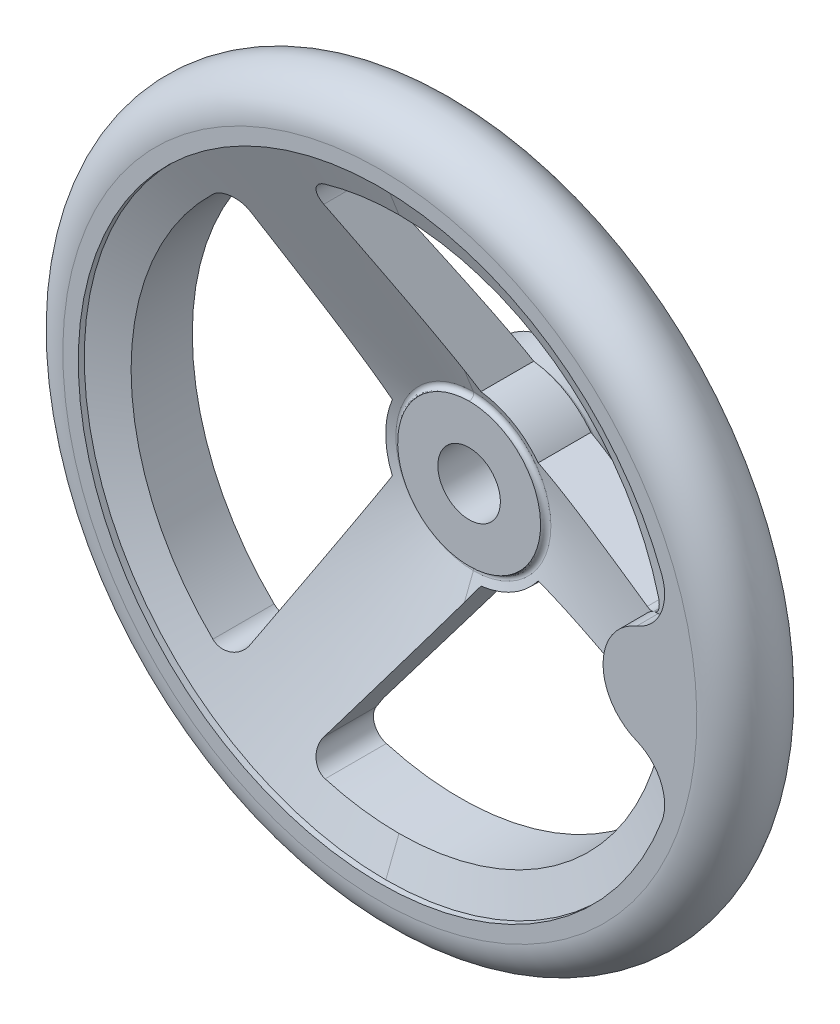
ISO-10303-21;
HEADER;
FILE_DESCRIPTION(('STEP AP214'),'2;1');
FILE_NAME('part.step','',(''),(''),'','','');
FILE_SCHEMA(('AUTOMOTIVE_DESIGN { 1 0 10303 214 1 1 1 1 }'));
ENDSEC;
DATA;
#1=APPLICATION_CONTEXT('core data for automotive mechanical design processes');
#2=APPLICATION_PROTOCOL_DEFINITION('international standard','automotive_design',2000,#1);
#3=PRODUCT_CONTEXT('',#1,'mechanical');
#4=PRODUCT('Part','Part','',(#3));
#5=PRODUCT_RELATED_PRODUCT_CATEGORY('part','',(#4));
#6=PRODUCT_DEFINITION_FORMATION('','',#4);
#7=PRODUCT_DEFINITION_CONTEXT('part definition',#1,'design');
#8=PRODUCT_DEFINITION('design','',#6,#7);
#9=PRODUCT_DEFINITION_SHAPE('','',#8);
#10=(LENGTH_UNIT() NAMED_UNIT(*) SI_UNIT(.MILLI.,.METRE.));
#11=(NAMED_UNIT(*) PLANE_ANGLE_UNIT() SI_UNIT($,.RADIAN.));
#12=(NAMED_UNIT(*) SI_UNIT($,.STERADIAN.) SOLID_ANGLE_UNIT());
#13=UNCERTAINTY_MEASURE_WITH_UNIT(LENGTH_MEASURE(1.E-05),#10,'distance_accuracy_value','');
#14=(GEOMETRIC_REPRESENTATION_CONTEXT(3) GLOBAL_UNCERTAINTY_ASSIGNED_CONTEXT((#13)) GLOBAL_UNIT_ASSIGNED_CONTEXT((#10,
#11,#12)) REPRESENTATION_CONTEXT('',''));
#15=CARTESIAN_POINT('',(0.,0.,0.));
#16=DIRECTION('',(0.,0.,1.));
#17=DIRECTION('',(1.,0.,0.));
#18=AXIS2_PLACEMENT_3D('',#15,#16,#17);
#19=CARTESIAN_POINT('',(-16.248223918,16.192506,0.));
#20=DIRECTION('',(0.,0.,1.));
#21=DIRECTION('',(0.,-1.,0.));
#22=AXIS2_PLACEMENT_3D('',#19,#20,#21);
#23=PLANE('',#22);
#24=CARTESIAN_POINT('',(0.,0.,0.));
#25=DIRECTION('',(0.,0.,-1.));
#26=DIRECTION('',(0.,1.,0.));
#27=AXIS2_PLACEMENT_3D('',#24,#25,#26);
#28=CIRCLE('',#27,7.);
#29=CARTESIAN_POINT('',(0.,7.,0.));
#30=VERTEX_POINT('',#29);
#31=EDGE_CURVE('E487',#30,#30,#28,.F.);
#32=ORIENTED_EDGE('',*,*,#31,.T.);
#33=EDGE_LOOP('',(#32));
#34=FACE_BOUND('',#33,.T.);
#35=CARTESIAN_POINT('',(0.,0.,0.));
#36=DIRECTION('',(0.,0.,-1.));
#37=DIRECTION('',(-1.,0.,0.));
#38=AXIS2_PLACEMENT_3D('',#35,#36,#37);
#39=CIRCLE('',#38,17.5);
#40=CARTESIAN_POINT('',(-17.5,0.,0.));
#41=VERTEX_POINT('',#40);
#42=EDGE_CURVE('E490',#41,#41,#39,.T.);
#43=ORIENTED_EDGE('',*,*,#42,.T.);
#44=EDGE_LOOP('',(#43));
#45=FACE_BOUND('',#44,.T.);
#46=ADVANCED_FACE('F15',(#34,#45),#23,.F.);
#47=CARTESIAN_POINT('',(0.,0.,20.000000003));
#48=DIRECTION('',(0.,0.,-1.));
#49=DIRECTION('',(0.,1.,0.));
#50=AXIS2_PLACEMENT_3D('',#47,#48,#49);
#51=CYLINDRICAL_SURFACE('',#50,7.);
#52=ORIENTED_EDGE('',*,*,#31,.F.);
#53=EDGE_LOOP('',(#52));
#54=FACE_BOUND('',#53,.T.);
#55=CARTESIAN_POINT('',(0.,0.,20.000000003));
#56=DIRECTION('',(0.,0.,-1.));
#57=DIRECTION('',(0.,1.,0.));
#58=AXIS2_PLACEMENT_3D('',#55,#56,#57);
#59=CIRCLE('',#58,7.);
#60=CARTESIAN_POINT('',(0.,7.,20.000000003));
#61=VERTEX_POINT('',#60);
#62=EDGE_CURVE('E483',#61,#61,#59,.F.);
#63=ORIENTED_EDGE('',*,*,#62,.T.);
#64=EDGE_LOOP('',(#63));
#65=FACE_BOUND('',#64,.T.);
#66=ADVANCED_FACE('F469',(#54,#65),#51,.F.);
#67=CARTESIAN_POINT('',(0.,0.,19.685715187));
#68=DIRECTION('',(0.,0.,-1.));
#69=DIRECTION('',(0.,1.,0.));
#70=AXIS2_PLACEMENT_3D('',#67,#68,#69);
#71=CYLINDRICAL_SURFACE('',#70,19.);
#72=CARTESIAN_POINT('',(0.,0.,19.6857151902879));
#73=DIRECTION('',(0.,0.,1.));
#74=DIRECTION('',(0.,-1.,0.));
#75=AXIS2_PLACEMENT_3D('',#72,#73,#74);
#76=CIRCLE('',#75,19.0000000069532);
#77=CARTESIAN_POINT('',(2.34190015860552,18.8551187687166,19.6857151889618));
#78=VERTEX_POINT('',#77);
#79=CARTESIAN_POINT('',(15.158061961,11.455704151,19.6857151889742));
#80=VERTEX_POINT('',#79);
#81=EDGE_CURVE('E251',#78,#80,#76,.F.);
#82=ORIENTED_EDGE('',*,*,#81,.T.);
#83=DIRECTION('',(0.,0.,1.));
#84=VECTOR('',#83,1.);
#85=CARTESIAN_POINT('',(15.158061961,11.455704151,20.6601553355));
#86=LINE('',#85,#84);
#87=CARTESIAN_POINT('',(15.158061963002,11.4557041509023,7.87400696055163));
#88=VERTEX_POINT('',#87);
#89=EDGE_CURVE('E246',#88,#80,#86,.T.);
#90=ORIENTED_EDGE('',*,*,#89,.F.);
#91=CARTESIAN_POINT('',(0.,0.,7.87400696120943));
#92=DIRECTION('',(0.,0.,1.));
#93=DIRECTION('',(0.,-1.,0.));
#94=AXIS2_PLACEMENT_3D('',#91,#92,#93);
#95=CIRCLE('',#94,19.0000000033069);
#96=CARTESIAN_POINT('',(2.3419001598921,18.8551187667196,7.87400696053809));
#97=VERTEX_POINT('',#96);
#98=EDGE_CURVE('E234',#97,#88,#95,.F.);
#99=ORIENTED_EDGE('',*,*,#98,.F.);
#100=DIRECTION('',(0.,0.,-1.));
#101=VECTOR('',#100,1.);
#102=CARTESIAN_POINT('',(2.341900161,18.855118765,20.8097797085));
#103=LINE('',#102,#101);
#104=EDGE_CURVE('E735',#78,#97,#103,.T.);
#105=ORIENTED_EDGE('',*,*,#104,.F.);
#106=EDGE_LOOP('',(#82,#90,#99,#105));
#107=FACE_BOUND('',#106,.T.);
#108=ADVANCED_FACE('F249',(#107),#71,.T.);
#109=CARTESIAN_POINT('',(0.,0.,19.685715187));
#110=DIRECTION('',(0.,0.,-1.));
#111=DIRECTION('',(0.,1.,0.));
#112=AXIS2_PLACEMENT_3D('',#109,#110,#111);
#113=CYLINDRICAL_SURFACE('',#112,19.);
#114=CARTESIAN_POINT('',(0.,0.,19.6857151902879));
#115=DIRECTION('',(0.,0.,1.));
#116=DIRECTION('',(0.,-1.,0.));
#117=AXIS2_PLACEMENT_3D('',#114,#115,#116);
#118=CIRCLE('',#117,19.0000000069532);
#119=CARTESIAN_POINT('',(15.1580619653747,-11.4557041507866,19.6857151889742));
#120=VERTEX_POINT('',#119);
#121=CARTESIAN_POINT('',(2.34190016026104,-18.855118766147,19.685715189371));
#122=VERTEX_POINT('',#121);
#123=EDGE_CURVE('E369',#120,#122,#118,.F.);
#124=ORIENTED_EDGE('',*,*,#123,.T.);
#125=DIRECTION('',(0.,0.,1.));
#126=VECTOR('',#125,1.);
#127=CARTESIAN_POINT('',(2.341900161,-18.855118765,20.8097797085));
#128=LINE('',#127,#126);
#129=CARTESIAN_POINT('',(2.3419001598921,-18.8551187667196,7.87400696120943));
#130=VERTEX_POINT('',#129);
#131=EDGE_CURVE('E336',#130,#122,#128,.T.);
#132=ORIENTED_EDGE('',*,*,#131,.F.);
#133=CARTESIAN_POINT('',(0.,0.,7.87400696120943));
#134=DIRECTION('',(0.,0.,1.));
#135=DIRECTION('',(0.,-1.,0.));
#136=AXIS2_PLACEMENT_3D('',#133,#134,#135);
#137=CIRCLE('',#136,19.0000000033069);
#138=CARTESIAN_POINT('',(15.158061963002,-11.4557041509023,7.87400696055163));
#139=VERTEX_POINT('',#138);
#140=EDGE_CURVE('E263',#139,#130,#137,.F.);
#141=ORIENTED_EDGE('',*,*,#140,.F.);
#142=DIRECTION('',(0.,0.,-1.));
#143=VECTOR('',#142,1.);
#144=CARTESIAN_POINT('',(15.158061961,-11.455704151,20.6601553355));
#145=LINE('',#144,#143);
#146=EDGE_CURVE('E267',#120,#139,#145,.T.);
#147=ORIENTED_EDGE('',*,*,#146,.F.);
#148=EDGE_LOOP('',(#124,#132,#141,#147));
#149=FACE_BOUND('',#148,.T.);
#150=ADVANCED_FACE('F474',(#149),#113,.T.);
#151=CARTESIAN_POINT('',(-16.248223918,-16.192506,20.000000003));
#152=DIRECTION('',(0.,0.,-1.));
#153=DIRECTION('',(0.,1.,0.));
#154=AXIS2_PLACEMENT_3D('',#151,#152,#153);
#155=PLANE('',#154);
#156=ORIENTED_EDGE('',*,*,#62,.F.);
#157=EDGE_LOOP('',(#156));
#158=FACE_BOUND('',#157,.T.);
#159=CARTESIAN_POINT('',(0.,16.0005,20.000000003));
#160=CARTESIAN_POINT('',(-0.333943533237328,16.0005074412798,20.000000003));
#161=CARTESIAN_POINT('',(-0.667838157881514,15.9900444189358,20.000000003));
#162=CARTESIAN_POINT('',(-1.33491140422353,15.9482240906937,20.000000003));
#163=CARTESIAN_POINT('',(-1.6680877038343,15.9168297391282,20.000000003));
#164=CARTESIAN_POINT('',(-2.44589871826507,15.8188326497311,20.000000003));
#165=CARTESIAN_POINT('',(-2.88951617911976,15.7438411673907,20.000000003));
#166=CARTESIAN_POINT('',(-3.5489594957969,15.6035727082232,20.000000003));
#167=CARTESIAN_POINT('',(-3.76783581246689,15.5521684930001,20.000000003));
#168=CARTESIAN_POINT('',(-4.20328477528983,15.4401731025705,20.000000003));
#169=CARTESIAN_POINT('',(-4.41985684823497,15.3795796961,20.000000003));
#170=CARTESIAN_POINT('',(-5.06585687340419,15.1840567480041,20.000000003));
#171=CARTESIAN_POINT('',(-5.4912326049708,15.0354559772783,20.000000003));
#172=CARTESIAN_POINT('',(-6.32788948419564,14.7029426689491,20.000000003));
#173=CARTESIAN_POINT('',(-6.73917057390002,14.5190299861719,20.000000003));
#174=CARTESIAN_POINT('',(-7.54455862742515,14.1172945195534,20.000000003));
#175=CARTESIAN_POINT('',(-7.93867490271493,13.8994904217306,20.000000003));
#176=CARTESIAN_POINT('',(-8.70716241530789,13.4314462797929,20.000000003));
#177=CARTESIAN_POINT('',(-9.08153310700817,13.1812053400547,20.000000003));
#178=CARTESIAN_POINT('',(-9.8077612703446,12.6501430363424,20.000000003));
#179=CARTESIAN_POINT('',(-10.1596248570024,12.3693300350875,20.000000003));
#180=CARTESIAN_POINT('',(-10.8384457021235,11.7790660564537,20.000000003));
#181=CARTESIAN_POINT('',(-11.1654031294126,11.4696152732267,20.000000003));
#182=CARTESIAN_POINT('',(-11.7921271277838,10.82423602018,20.000000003));
#183=CARTESIAN_POINT('',(-12.0918905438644,10.4883044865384,20.000000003));
#184=CARTESIAN_POINT('',(-12.6620531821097,9.79238265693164,20.000000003));
#185=CARTESIAN_POINT('',(-12.9324523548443,9.43239232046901,20.000000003));
#186=CARTESIAN_POINT('',(-13.4419726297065,8.69089953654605,20.000000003));
#187=CARTESIAN_POINT('',(-13.6810926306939,8.30939633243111,20.000000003));
#188=CARTESIAN_POINT('',(-14.1263432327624,7.5276018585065,20.000000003));
#189=CARTESIAN_POINT('',(-14.3324738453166,7.12731059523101,20.000000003));
#190=CARTESIAN_POINT('',(-14.7102763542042,6.31079425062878,20.000000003));
#191=CARTESIAN_POINT('',(-14.881948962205,5.89456949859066,20.000000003));
#192=CARTESIAN_POINT('',(-15.189620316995,5.0491374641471,20.000000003));
#193=CARTESIAN_POINT('',(-15.3256190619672,4.6199301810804,20.000000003));
#194=CARTESIAN_POINT('',(-15.5609764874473,3.75158201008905,20.000000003));
#195=CARTESIAN_POINT('',(-15.6603349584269,3.31244106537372,20.000000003));
#196=CARTESIAN_POINT('',(-15.8217043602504,2.42734998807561,20.000000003));
#197=CARTESIAN_POINT('',(-15.8837152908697,1.98139985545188,20.000000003));
#198=CARTESIAN_POINT('',(-15.9699490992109,1.08585721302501,20.000000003));
#199=CARTESIAN_POINT('',(-15.9941716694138,0.636264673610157,20.000000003));
#200=CARTESIAN_POINT('',(-16.0046555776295,-0.263362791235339,20.000000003));
#201=CARTESIAN_POINT('',(-15.9909169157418,-0.713397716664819,20.000000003));
#202=CARTESIAN_POINT('',(-15.9255767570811,-1.61070052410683,20.000000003));
#203=CARTESIAN_POINT('',(-15.8739760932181,-2.05796846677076,20.000000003));
#204=CARTESIAN_POINT('',(-15.7332797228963,-2.94656755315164,20.000000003));
#205=CARTESIAN_POINT('',(-15.6441840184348,-3.38789869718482,20.000000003));
#206=CARTESIAN_POINT('',(-15.4291328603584,-4.26147899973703,20.000000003));
#207=CARTESIAN_POINT('',(-15.3031780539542,-4.69372831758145,20.000000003));
#208=CARTESIAN_POINT('',(-15.0153035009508,-5.54608013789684,20.000000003));
#209=CARTESIAN_POINT('',(-14.8533837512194,-5.96618263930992,20.000000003));
#210=CARTESIAN_POINT('',(-14.4947201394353,-6.79127788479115,20.000000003));
#211=CARTESIAN_POINT('',(-14.2979742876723,-7.19626976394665,20.000000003));
#212=CARTESIAN_POINT('',(-13.8710636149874,-7.98823894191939,20.000000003));
#213=CARTESIAN_POINT('',(-13.6408987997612,-8.37521624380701,20.000000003));
#214=CARTESIAN_POINT('',(-13.1487785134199,-9.12841739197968,20.000000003));
#215=CARTESIAN_POINT('',(-12.8868219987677,-9.49464055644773,20.000000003));
#216=CARTESIAN_POINT('',(-12.3329866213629,-10.2037160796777,20.000000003));
#217=CARTESIAN_POINT('',(-12.0411077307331,-10.5465684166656,20.000000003));
#218=CARTESIAN_POINT('',(-11.4295405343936,-11.2064238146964,20.000000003));
#219=CARTESIAN_POINT('',(-11.1098556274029,-11.5234300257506,20.000000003));
#220=CARTESIAN_POINT('',(-10.4449195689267,-12.1293851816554,20.000000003));
#221=CARTESIAN_POINT('',(-10.0996685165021,-12.4183342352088,20.000000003));
#222=CARTESIAN_POINT('',(-9.38604930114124,-12.9661256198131,20.000000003));
#223=CARTESIAN_POINT('',(-9.01768086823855,-13.2249675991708,20.000000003));
#224=CARTESIAN_POINT('',(-8.26044324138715,-13.7107044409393,20.000000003));
#225=CARTESIAN_POINT('',(-7.87157376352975,-13.9375988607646,20.000000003));
#226=CARTESIAN_POINT('',(-7.07606274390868,-14.357845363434,20.000000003));
#227=CARTESIAN_POINT('',(-6.6694192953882,-14.5511938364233,20.000000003));
#228=CARTESIAN_POINT('',(-5.84130176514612,-14.9029376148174,20.000000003));
#229=CARTESIAN_POINT('',(-5.41982840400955,-15.0613346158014,20.000000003));
#230=CARTESIAN_POINT('',(-4.59049224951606,-15.333701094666,20.000000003));
#231=CARTESIAN_POINT('',(-4.18331176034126,-15.4497532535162,20.000000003));
#232=CARTESIAN_POINT('',(-3.36104668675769,-15.6492283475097,20.000000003));
#233=CARTESIAN_POINT('',(-2.94596243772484,-15.7326526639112,20.000000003));
#234=CARTESIAN_POINT('',(-2.11041465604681,-15.8663513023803,20.000000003));
#235=CARTESIAN_POINT('',(-1.68995017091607,-15.9166196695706,20.000000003));
#236=CARTESIAN_POINT('',(-0.846325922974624,-15.9837142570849,20.000000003));
#237=CARTESIAN_POINT('',(-0.423165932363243,-16.0005376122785,20.000000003));
#238=CARTESIAN_POINT('',(0.,-16.0005,20.000000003));
#239=B_SPLINE_CURVE_WITH_KNOTS('',3,(#159,#160,#161,#162,#163,#164,#165,#166,#167,#168,#169,
#170,#171,#172,#173,#174,#175,#176,#177,#178,#179,#180,#181,#182,#183,#184,#185,#186,#187,#188,
#189,#190,#191,#192,#193,#194,#195,#196,#197,#198,#199,#200,#201,#202,#203,#204,#205,#206,#207,
#208,#209,#210,#211,#212,#213,#214,#215,#216,#217,#218,#219,#220,#221,#222,#223,#224,#225,#226,
#227,#228,#229,#230,#231,#232,#233,#234,#235,#236,#237,#238),.UNSPECIFIED.,.F.,.F.,(4,2,2,2,2,2,
2,2,2,2,2,2,2,2,2,2,2,2,2,2,2,2,2,2,2,2,2,2,2,2,2,2,2,2,2,2,2,2,2,4),(0.,1.00156977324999,
2.00491691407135,3.35283687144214,4.02716568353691,4.70165849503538,6.05167144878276,
7.40168995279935,8.75096674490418,10.1002808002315,11.4492266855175,12.7981634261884,
14.1472564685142,15.4963517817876,16.8454945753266,18.194636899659,19.5437513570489,
20.8928658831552,22.2419881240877,23.5911103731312,24.9402436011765,26.289376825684,
27.6384803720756,28.9875838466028,30.3366636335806,31.6857435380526,33.0349005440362,
34.3840573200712,35.7332583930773,37.0824607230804,38.4314983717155,39.780530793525,
41.1295789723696,42.4786458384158,43.827857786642,45.177004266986,46.4458760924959,
47.7146941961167,48.9837401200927,50.2528947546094),.UNSPECIFIED.);
#240=CARTESIAN_POINT('',(0.,16.0005,19.9867839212));
#241=VERTEX_POINT('',#240);
#242=CARTESIAN_POINT('',(0.,-16.0005,19.9867839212));
#243=VERTEX_POINT('',#242);
#244=EDGE_CURVE('E660',#241,#243,#239,.T.);
#245=ORIENTED_EDGE('',*,*,#244,.T.);
#246=CARTESIAN_POINT('',(0.,-16.0005,20.000000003));
#247=CARTESIAN_POINT('',(0.333943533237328,-16.0005074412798,20.000000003));
#248=CARTESIAN_POINT('',(0.667838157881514,-15.9900444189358,20.000000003));
#249=CARTESIAN_POINT('',(1.33491140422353,-15.9482240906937,20.000000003));
#250=CARTESIAN_POINT('',(1.6680877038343,-15.9168297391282,20.000000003));
#251=CARTESIAN_POINT('',(2.44589871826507,-15.8188326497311,20.000000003));
#252=CARTESIAN_POINT('',(2.88951617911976,-15.7438411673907,20.000000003));
#253=CARTESIAN_POINT('',(3.5489594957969,-15.6035727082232,20.000000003));
#254=CARTESIAN_POINT('',(3.76783581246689,-15.5521684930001,20.000000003));
#255=CARTESIAN_POINT('',(4.20328477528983,-15.4401731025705,20.000000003));
#256=CARTESIAN_POINT('',(4.41985684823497,-15.3795796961,20.000000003));
#257=CARTESIAN_POINT('',(5.06585687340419,-15.1840567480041,20.000000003));
#258=CARTESIAN_POINT('',(5.4912326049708,-15.0354559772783,20.000000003));
#259=CARTESIAN_POINT('',(6.32788948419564,-14.7029426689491,20.000000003));
#260=CARTESIAN_POINT('',(6.73917057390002,-14.5190299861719,20.000000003));
#261=CARTESIAN_POINT('',(7.54455862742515,-14.1172945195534,20.000000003));
#262=CARTESIAN_POINT('',(7.93867490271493,-13.8994904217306,20.000000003));
#263=CARTESIAN_POINT('',(8.70716241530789,-13.4314462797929,20.000000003));
#264=CARTESIAN_POINT('',(9.08153310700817,-13.1812053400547,20.000000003));
#265=CARTESIAN_POINT('',(9.8077612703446,-12.6501430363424,20.000000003));
#266=CARTESIAN_POINT('',(10.1596248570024,-12.3693300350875,20.000000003));
#267=CARTESIAN_POINT('',(10.8384457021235,-11.7790660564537,20.000000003));
#268=CARTESIAN_POINT('',(11.1654031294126,-11.4696152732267,20.000000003));
#269=CARTESIAN_POINT('',(11.7921271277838,-10.82423602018,20.000000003));
#270=CARTESIAN_POINT('',(12.0918905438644,-10.4883044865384,20.000000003));
#271=CARTESIAN_POINT('',(12.6620531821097,-9.79238265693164,20.000000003));
#272=CARTESIAN_POINT('',(12.9324523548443,-9.43239232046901,20.000000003));
#273=CARTESIAN_POINT('',(13.4419726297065,-8.69089953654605,20.000000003));
#274=CARTESIAN_POINT('',(13.6810926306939,-8.30939633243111,20.000000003));
#275=CARTESIAN_POINT('',(14.1263432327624,-7.5276018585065,20.000000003));
#276=CARTESIAN_POINT('',(14.3324738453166,-7.12731059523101,20.000000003));
#277=CARTESIAN_POINT('',(14.7102763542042,-6.31079425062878,20.000000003));
#278=CARTESIAN_POINT('',(14.881948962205,-5.89456949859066,20.000000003));
#279=CARTESIAN_POINT('',(15.189620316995,-5.0491374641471,20.000000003));
#280=CARTESIAN_POINT('',(15.3256190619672,-4.6199301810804,20.000000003));
#281=CARTESIAN_POINT('',(15.5609764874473,-3.75158201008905,20.000000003));
#282=CARTESIAN_POINT('',(15.6603349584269,-3.31244106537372,20.000000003));
#283=CARTESIAN_POINT('',(15.8217043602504,-2.42734998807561,20.000000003));
#284=CARTESIAN_POINT('',(15.8837152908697,-1.98139985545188,20.000000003));
#285=CARTESIAN_POINT('',(15.9699490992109,-1.08585721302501,20.000000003));
#286=CARTESIAN_POINT('',(15.9941716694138,-0.636264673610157,20.000000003));
#287=CARTESIAN_POINT('',(16.0046555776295,0.263362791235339,20.000000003));
#288=CARTESIAN_POINT('',(15.9909169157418,0.713397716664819,20.000000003));
#289=CARTESIAN_POINT('',(15.9255767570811,1.61070052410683,20.000000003));
#290=CARTESIAN_POINT('',(15.8739760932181,2.05796846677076,20.000000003));
#291=CARTESIAN_POINT('',(15.7332797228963,2.94656755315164,20.000000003));
#292=CARTESIAN_POINT('',(15.6441840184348,3.38789869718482,20.000000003));
#293=CARTESIAN_POINT('',(15.4291328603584,4.26147899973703,20.000000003));
#294=CARTESIAN_POINT('',(15.3031780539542,4.69372831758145,20.000000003));
#295=CARTESIAN_POINT('',(15.0153035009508,5.54608013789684,20.000000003));
#296=CARTESIAN_POINT('',(14.8533837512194,5.96618263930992,20.000000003));
#297=CARTESIAN_POINT('',(14.4947201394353,6.79127788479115,20.000000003));
#298=CARTESIAN_POINT('',(14.2979742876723,7.19626976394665,20.000000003));
#299=CARTESIAN_POINT('',(13.8710636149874,7.98823894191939,20.000000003));
#300=CARTESIAN_POINT('',(13.6408987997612,8.37521624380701,20.000000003));
#301=CARTESIAN_POINT('',(13.1487785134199,9.12841739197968,20.000000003));
#302=CARTESIAN_POINT('',(12.8868219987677,9.49464055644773,20.000000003));
#303=CARTESIAN_POINT('',(12.3329866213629,10.2037160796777,20.000000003));
#304=CARTESIAN_POINT('',(12.0411077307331,10.5465684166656,20.000000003));
#305=CARTESIAN_POINT('',(11.4295405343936,11.2064238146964,20.000000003));
#306=CARTESIAN_POINT('',(11.1098556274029,11.5234300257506,20.000000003));
#307=CARTESIAN_POINT('',(10.4449195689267,12.1293851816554,20.000000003));
#308=CARTESIAN_POINT('',(10.0996685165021,12.4183342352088,20.000000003));
#309=CARTESIAN_POINT('',(9.38604930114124,12.9661256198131,20.000000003));
#310=CARTESIAN_POINT('',(9.01768086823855,13.2249675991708,20.000000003));
#311=CARTESIAN_POINT('',(8.26044324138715,13.7107044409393,20.000000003));
#312=CARTESIAN_POINT('',(7.87157376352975,13.9375988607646,20.000000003));
#313=CARTESIAN_POINT('',(7.07606274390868,14.357845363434,20.000000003));
#314=CARTESIAN_POINT('',(6.6694192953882,14.5511938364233,20.000000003));
#315=CARTESIAN_POINT('',(5.84130176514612,14.9029376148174,20.000000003));
#316=CARTESIAN_POINT('',(5.41982840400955,15.0613346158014,20.000000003));
#317=CARTESIAN_POINT('',(4.59049224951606,15.333701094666,20.000000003));
#318=CARTESIAN_POINT('',(4.18331176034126,15.4497532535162,20.000000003));
#319=CARTESIAN_POINT('',(3.36104668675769,15.6492283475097,20.000000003));
#320=CARTESIAN_POINT('',(2.94596243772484,15.7326526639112,20.000000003));
#321=CARTESIAN_POINT('',(2.11041465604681,15.8663513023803,20.000000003));
#322=CARTESIAN_POINT('',(1.68995017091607,15.9166196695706,20.000000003));
#323=CARTESIAN_POINT('',(0.846325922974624,15.9837142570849,20.000000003));
#324=CARTESIAN_POINT('',(0.423165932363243,16.0005376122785,20.000000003));
#325=CARTESIAN_POINT('',(0.,16.0005,20.000000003));
#326=B_SPLINE_CURVE_WITH_KNOTS('',3,(#246,#247,#248,#249,#250,#251,#252,#253,#254,#255,#256,
#257,#258,#259,#260,#261,#262,#263,#264,#265,#266,#267,#268,#269,#270,#271,#272,#273,#274,#275,
#276,#277,#278,#279,#280,#281,#282,#283,#284,#285,#286,#287,#288,#289,#290,#291,#292,#293,#294,
#295,#296,#297,#298,#299,#300,#301,#302,#303,#304,#305,#306,#307,#308,#309,#310,#311,#312,#313,
#314,#315,#316,#317,#318,#319,#320,#321,#322,#323,#324,#325),.UNSPECIFIED.,.F.,.F.,(4,2,2,2,2,2,
2,2,2,2,2,2,2,2,2,2,2,2,2,2,2,2,2,2,2,2,2,2,2,2,2,2,2,2,2,2,2,2,2,4),(0.,1.00156977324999,
2.00491691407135,3.35283687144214,4.02716568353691,4.70165849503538,6.05167144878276,
7.40168995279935,8.75096674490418,10.1002808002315,11.4492266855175,12.7981634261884,
14.1472564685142,15.4963517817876,16.8454945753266,18.194636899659,19.5437513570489,
20.8928658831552,22.2419881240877,23.5911103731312,24.9402436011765,26.289376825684,
27.6384803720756,28.9875838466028,30.3366636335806,31.6857435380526,33.0349005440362,
34.3840573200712,35.7332583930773,37.0824607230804,38.4314983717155,39.780530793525,
41.1295789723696,42.4786458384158,43.827857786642,45.177004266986,46.4458760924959,
47.7146941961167,48.9837401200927,50.2528947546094),.UNSPECIFIED.);
#327=EDGE_CURVE('E256',#243,#241,#326,.T.);
#328=ORIENTED_EDGE('',*,*,#327,.T.);
#329=EDGE_LOOP('',(#245,#328));
#330=FACE_BOUND('',#329,.T.);
#331=ADVANCED_FACE('F471',(#158,#330),#155,.F.);
#332=CARTESIAN_POINT('',(0.,16.0005,20.000000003));
#333=CARTESIAN_POINT('',(32.001,16.0005,20.000000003));
#334=CARTESIAN_POINT('',(32.001,-16.0005,20.000000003));
#335=CARTESIAN_POINT('',(0.,-16.0005,20.000000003));
#336=CARTESIAN_POINT('',(0.,16.0005,19.9926577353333));
#337=CARTESIAN_POINT('',(32.001,16.0005,19.9926577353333));
#338=CARTESIAN_POINT('',(32.001,-16.0005,19.9926577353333));
#339=CARTESIAN_POINT('',(0.,-16.0005,19.9926577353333));
#340=CARTESIAN_POINT('',(0.,16.0005,19.9853154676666));
#341=CARTESIAN_POINT('',(32.001,16.0005,19.9853154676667));
#342=CARTESIAN_POINT('',(32.001,-16.0005,19.9853154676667));
#343=CARTESIAN_POINT('',(0.,-16.0005,19.9853154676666));
#344=CARTESIAN_POINT('',(0.,16.0005,19.9779732));
#345=CARTESIAN_POINT('',(32.001,16.0005,19.9779732));
#346=CARTESIAN_POINT('',(32.001,-16.0005,19.9779732));
#347=CARTESIAN_POINT('',(0.,-16.0005,19.9779732));
#348=CARTESIAN_POINT('',(0.,16.0005,19.201760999));
#349=CARTESIAN_POINT('',(32.001,16.0005,19.201760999));
#350=CARTESIAN_POINT('',(32.001,-16.0005,19.201760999));
#351=CARTESIAN_POINT('',(0.,-16.0005,19.201760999));
#352=CARTESIAN_POINT('',(0.,16.641518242,18.764038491));
#353=CARTESIAN_POINT('',(33.283036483,16.641518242,18.764038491));
#354=CARTESIAN_POINT('',(33.283036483,-16.641518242,18.764038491));
#355=CARTESIAN_POINT('',(0.,-16.641518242,18.764038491));
#356=CARTESIAN_POINT('',(0.,17.364485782,19.046568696));
#357=CARTESIAN_POINT('',(34.728971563,17.364485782,19.046568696));
#358=CARTESIAN_POINT('',(34.728971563,-17.364485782,19.046568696));
#359=CARTESIAN_POINT('',(0.,-17.364485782,19.046568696));
#360=(BOUNDED_SURFACE() B_SPLINE_SURFACE(3,3,((#332,#333,#334,#335),(#336,#337,#338,#339),(#340,
#341,#342,#343),(#344,#345,#346,#347),(#348,#349,#350,#351),(#352,#353,#354,#355),(#356,#357,
#358,#359)),.UNSPECIFIED.,.F.,.F.,.F.) B_SPLINE_SURFACE_WITH_KNOTS((4,3,4),(4,4),
(-0.0133361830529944,0.,1.),(0.,1.),
.UNSPECIFIED.) GEOMETRIC_REPRESENTATION_ITEM() RATIONAL_B_SPLINE_SURFACE(((1.,0.333333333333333,
0.333333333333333,1.),(1.,0.333333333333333,0.333333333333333,1.),(1.,0.333333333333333,
0.333333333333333,1.),(1.,0.333333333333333,0.333333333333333,1.),(0.709280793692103,
0.236426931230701,0.236426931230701,0.709280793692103),(0.709280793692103,0.236426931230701,
0.236426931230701,0.709280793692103),(1.,0.333333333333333,0.333333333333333,1.))) REPRESENTATION_ITEM('') SURFACE());
#361=CARTESIAN_POINT('',(0.,0.,19.046568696));
#362=DIRECTION('',(0.,0.,1.));
#363=DIRECTION('',(0.,-1.,0.));
#364=AXIS2_PLACEMENT_3D('',#361,#362,#363);
#365=CIRCLE('',#364,17.364485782);
#366=CARTESIAN_POINT('',(-2.33883027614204E-09,-17.364485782,19.046568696));
#367=VERTEX_POINT('',#366);
#368=CARTESIAN_POINT('',(-4.45189446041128E-09,17.364485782,19.046568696));
#369=VERTEX_POINT('',#368);
#370=EDGE_CURVE('E368',#367,#369,#365,.T.);
#371=CARTESIAN_POINT('',(0.,16.0005,19.9779732));
#372=CARTESIAN_POINT('',(0.,16.0005,19.201760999));
#373=CARTESIAN_POINT('',(0.,16.641518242,18.764038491));
#374=CARTESIAN_POINT('',(0.,17.364485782,19.046568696));
#375=(BOUNDED_CURVE() B_SPLINE_CURVE(3,(#371,#372,#373,#374),.UNSPECIFIED.,.F.,
.F.) B_SPLINE_CURVE_WITH_KNOTS((4,4),(0.,1.),
.UNSPECIFIED.) CURVE() GEOMETRIC_REPRESENTATION_ITEM() RATIONAL_B_SPLINE_CURVE((1.,
0.709280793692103,0.709280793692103,1.)) REPRESENTATION_ITEM(''));
#376=EDGE_CURVE('E652',#369,#241,#375,.F.);
#377=CARTESIAN_POINT('',(0.,-16.0005,19.9779732));
#378=CARTESIAN_POINT('',(0.,-16.0005,19.201760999));
#379=CARTESIAN_POINT('',(0.,-16.641518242,18.764038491));
#380=CARTESIAN_POINT('',(0.,-17.364485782,19.046568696));
#381=(BOUNDED_CURVE() B_SPLINE_CURVE(3,(#377,#378,#379,#380),.UNSPECIFIED.,.F.,
.F.) B_SPLINE_CURVE_WITH_KNOTS((4,4),(0.,1.),
.UNSPECIFIED.) CURVE() GEOMETRIC_REPRESENTATION_ITEM() RATIONAL_B_SPLINE_CURVE((1.,
0.709280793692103,0.709280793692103,1.)) REPRESENTATION_ITEM(''));
#382=EDGE_CURVE('E655',#243,#367,#381,.T.);
#383=ORIENTED_EDGE('',*,*,#370,.T.);
#384=ORIENTED_EDGE('',*,*,#376,.T.);
#385=ORIENTED_EDGE('',*,*,#327,.F.);
#386=ORIENTED_EDGE('',*,*,#382,.T.);
#387=EDGE_LOOP('',(#383,#384,#385,#386));
#388=FACE_BOUND('',#387,.T.);
#389=ADVANCED_FACE('F293',(#388),#360,.F.);
#390=CARTESIAN_POINT('',(53.356626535,9.59236001,7.720573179));
#391=DIRECTION('',(0.0487225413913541,0.998812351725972,0.));
#392=DIRECTION('',(-0.998812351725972,0.0487225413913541,0.));
#393=AXIS2_PLACEMENT_3D('',#390,#391,#392);
#394=PLANE('',#393);
#395=CARTESIAN_POINT('',(15.1580619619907,11.4557041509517,19.685715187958));
#396=CARTESIAN_POINT('',(15.5506878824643,11.4365516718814,19.8036273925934));
#397=CARTESIAN_POINT('',(15.9427797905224,11.4174252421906,19.9233077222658));
#398=CARTESIAN_POINT('',(16.72600160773,11.3792193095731,20.1657615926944));
#399=CARTESIAN_POINT('',(17.1171315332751,11.3601398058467,20.2885350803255));
#400=CARTESIAN_POINT('',(17.8985221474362,11.3220232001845,20.5367278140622));
#401=CARTESIAN_POINT('',(18.2887828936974,11.3029860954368,20.6621468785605));
#402=CARTESIAN_POINT('',(19.0685588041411,11.2649482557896,20.9152913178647));
#403=CARTESIAN_POINT('',(19.4580739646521,11.2459475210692,21.0430167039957));
#404=CARTESIAN_POINT('',(20.6254896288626,11.1890004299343,21.4291426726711));
#405=CARTESIAN_POINT('',(21.4024021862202,11.151102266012,21.6905383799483));
#406=CARTESIAN_POINT('',(22.9541574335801,11.0754069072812,22.219448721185));
#407=CARTESIAN_POINT('',(23.7290000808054,11.0376097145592,22.4869634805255));
#408=CARTESIAN_POINT('',(25.2768316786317,10.962105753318,23.02670689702));
#409=CARTESIAN_POINT('',(26.0498210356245,10.9243989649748,23.2989343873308));
#410=CARTESIAN_POINT('',(27.5944511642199,10.8490511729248,23.8471755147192));
#411=CARTESIAN_POINT('',(28.3660919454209,10.8114101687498,24.1231891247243));
#412=CARTESIAN_POINT('',(29.9083197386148,10.7361795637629,24.6782776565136));
#413=CARTESIAN_POINT('',(30.678906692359,10.6985899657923,24.9573527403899));
#414=CARTESIAN_POINT('',(32.2191779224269,10.6234548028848,25.5179912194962));
#415=CARTESIAN_POINT('',(32.9888621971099,10.585909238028,25.7995546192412));
#416=CARTESIAN_POINT('',(35.3957305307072,10.4685010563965,26.6836334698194));
#417=CARTESIAN_POINT('',(37.0315993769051,10.3887025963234,27.2897376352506));
#418=CARTESIAN_POINT('',(40.3009597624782,10.2292216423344,28.5082164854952));
#419=CARTESIAN_POINT('',(41.9344513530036,10.1495391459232,29.1205910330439));
#420=CARTESIAN_POINT('',(45.2000864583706,9.99023991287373,30.3499762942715));
#421=CARTESIAN_POINT('',(46.8322296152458,9.91062319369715,30.9669879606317));
#422=CARTESIAN_POINT('',(49.2795128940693,9.79124355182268,31.8950068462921));
#423=CARTESIAN_POINT('',(50.0951256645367,9.75145757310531,32.2047660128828));
#424=CARTESIAN_POINT('',(51.7260741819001,9.67189912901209,32.8250135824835));
#425=CARTESIAN_POINT('',(52.5414099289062,9.63212666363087,33.135501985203));
#426=CARTESIAN_POINT('',(53.3566265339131,9.59236001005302,33.4463037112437));
#427=B_SPLINE_CURVE_WITH_KNOTS('',3,(#395,#396,#397,#398,#399,#400,#401,#402,#403,#404,#405,
#406,#407,#408,#409,#410,#411,#412,#413,#414,#415,#416,#417,#418,#419,#420,#421,#422,#423,#424,
#425,#426),.UNSPECIFIED.,.F.,.F.,(4,2,2,2,2,2,2,2,2,2,2,2,2,2,2,4),(0.,1.23117913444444,
2.46233713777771,3.6934109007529,4.9244907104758,7.38620307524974,9.84796592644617,
12.3091277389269,14.7702719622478,17.2315471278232,19.6928267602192,24.9319048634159,
30.1708685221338,35.4109396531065,38.0310197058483,40.6510987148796),.UNSPECIFIED.);
#428=CARTESIAN_POINT('',(53.3566265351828,9.59236001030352,33.4463037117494));
#429=VERTEX_POINT('',#428);
#430=EDGE_CURVE('E398',#80,#429,#427,.T.);
#431=ORIENTED_EDGE('',*,*,#430,.T.);
#432=DIRECTION('',(0.,0.,-1.));
#433=VECTOR('',#432,1.);
#434=CARTESIAN_POINT('',(53.3566265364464,9.59236001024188,28.224689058));
#435=LINE('',#434,#433);
#436=CARTESIAN_POINT('',(53.3566264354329,9.59236001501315,22.));
#437=VERTEX_POINT('',#436);
#438=EDGE_CURVE('E337',#429,#437,#435,.T.);
#439=ORIENTED_EDGE('',*,*,#438,.T.);
#440=DIRECTION('',(-0.998812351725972,0.0487225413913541,0.));
#441=VECTOR('',#440,1.);
#442=CARTESIAN_POINT('',(53.356626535,9.59236001,22.));
#443=LINE('',#442,#441);
#444=CARTESIAN_POINT('',(51.1210390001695,9.70141303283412,21.9999999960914));
#445=VERTEX_POINT('',#444);
#446=EDGE_CURVE('E261',#437,#445,#443,.T.);
#447=ORIENTED_EDGE('',*,*,#446,.T.);
#448=CARTESIAN_POINT('',(15.1580619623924,11.4557041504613,7.8740069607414));
#449=CARTESIAN_POINT('',(15.5500231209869,11.4365840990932,8.00281500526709));
#450=CARTESIAN_POINT('',(15.9413574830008,11.4174946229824,8.13351957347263));
#451=CARTESIAN_POINT('',(16.7228984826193,11.3793706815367,8.39824260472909));
#452=CARTESIAN_POINT('',(17.113105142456,11.3603362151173,8.53226100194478));
#453=CARTESIAN_POINT('',(17.8925014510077,11.3223168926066,8.80312701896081));
#454=CARTESIAN_POINT('',(18.2816911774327,11.3033320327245,8.93997441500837));
#455=CARTESIAN_POINT('',(19.059198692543,11.2654048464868,9.21613443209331));
#456=CARTESIAN_POINT('',(19.4475164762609,11.2464625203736,9.35544706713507));
#457=CARTESIAN_POINT('',(20.6111542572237,11.1896997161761,9.77652685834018));
#458=CARTESIAN_POINT('',(21.3853200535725,11.1519355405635,10.0614922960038));
#459=CARTESIAN_POINT('',(22.9312365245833,11.0765250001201,10.6379493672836));
#460=CARTESIAN_POINT('',(23.702987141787,11.0388786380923,10.9294411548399));
#461=CARTESIAN_POINT('',(25.2443308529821,10.9636911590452,11.5174352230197));
#462=CARTESIAN_POINT('',(26.0139244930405,10.9261500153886,11.8139360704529));
#463=CARTESIAN_POINT('',(27.5515408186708,10.851144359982,12.4109693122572));
#464=CARTESIAN_POINT('',(28.3195635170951,10.813679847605,12.711501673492));
#465=CARTESIAN_POINT('',(29.854379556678,10.738810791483,13.3158281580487));
#466=CARTESIAN_POINT('',(30.6211728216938,10.7014062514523,13.6196224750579));
#467=CARTESIAN_POINT('',(32.1537086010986,10.6266484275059,14.2298586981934));
#468=CARTESIAN_POINT('',(32.9194511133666,10.5892951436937,14.5363006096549));
#469=CARTESIAN_POINT('',(35.1419975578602,10.4808782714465,15.4293930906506));
#470=CARTESIAN_POINT('',(36.5976603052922,10.4098703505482,16.0188900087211));
#471=CARTESIAN_POINT('',(39.5066806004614,10.2679669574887,17.2034451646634));
#472=CARTESIAN_POINT('',(40.9600382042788,10.1970714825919,17.7985032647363));
#473=CARTESIAN_POINT('',(43.8653829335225,10.0553473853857,18.9928682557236));
#474=CARTESIAN_POINT('',(45.3173696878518,9.98451878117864,19.5921760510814));
#475=CARTESIAN_POINT('',(47.494397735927,9.8783223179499,20.4934828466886));
#476=CARTESIAN_POINT('',(48.2199225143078,9.84293087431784,20.79431239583));
#477=CARTESIAN_POINT('',(49.6706860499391,9.77216193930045,21.396661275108));
#478=CARTESIAN_POINT('',(50.3959248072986,9.7367844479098,21.6981806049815));
#479=CARTESIAN_POINT('',(51.1210389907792,9.70141303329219,21.9999999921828));
#480=B_SPLINE_CURVE_WITH_KNOTS('',3,(#448,#449,#450,#451,#452,#453,#454,#455,#456,#457,#458,
#459,#460,#461,#462,#463,#464,#465,#466,#467,#468,#469,#470,#471,#472,#473,#474,#475,#476,#477,
#478,#479),.UNSPECIFIED.,.F.,.F.,(4,2,2,2,2,2,2,2,2,2,2,2,2,2,2,4),(0.,1.23906680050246,
2.47810900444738,3.71705358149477,4.95600519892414,7.43339510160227,9.91084350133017,
12.3875946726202,14.8643254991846,17.3412042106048,19.8180879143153,24.534373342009,
29.250542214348,33.9677468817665,36.3263976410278,38.6850475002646),.UNSPECIFIED.);
#481=EDGE_CURVE('E239',#88,#445,#480,.T.);
#482=ORIENTED_EDGE('',*,*,#481,.F.);
#483=ORIENTED_EDGE('',*,*,#89,.T.);
#484=EDGE_LOOP('',(#431,#439,#447,#482,#483));
#485=FACE_BOUND('',#484,.T.);
#486=ADVANCED_FACE('F259',(#485),#394,.T.);
#487=CARTESIAN_POINT('',(0.,0.,6.85082955));
#488=DIRECTION('',(0.,0.,1.));
#489=DIRECTION('',(0.,-1.,0.));
#490=AXIS2_PLACEMENT_3D('',#487,#488,#489);
#491=CONICAL_SURFACE('',#490,16.607314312,1.16670254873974);
#492=CARTESIAN_POINT('',(0.,0.,7.49205649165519));
#493=DIRECTION('',(0.,0.,-1.));
#494=DIRECTION('',(-1.,0.,0.));
#495=AXIS2_PLACEMENT_3D('',#492,#493,#494);
#496=CIRCLE('',#495,18.1068143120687);
#497=CARTESIAN_POINT('',(-18.1068143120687,0.,7.49205649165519));
#498=VERTEX_POINT('',#497);
#499=EDGE_CURVE('E9',#498,#498,#496,.F.);
#500=ORIENTED_EDGE('',*,*,#499,.T.);
#501=EDGE_LOOP('',(#500));
#502=FACE_BOUND('',#501,.T.);
#503=CARTESIAN_POINT('',(2.34190015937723,18.8551187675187,7.87400696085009));
#504=CARTESIAN_POINT('',(2.14571562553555,19.1596227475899,7.99290010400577));
#505=CARTESIAN_POINT('',(1.94982109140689,19.4636766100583,8.11341310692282));
#506=CARTESIAN_POINT('',(1.55855744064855,20.0709688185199,8.35729508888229));
#507=CARTESIAN_POINT('',(1.36318831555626,20.3742071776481,8.48066402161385));
#508=CARTESIAN_POINT('',(0.972944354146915,20.9799166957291,8.72985896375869));
#509=CARTESIAN_POINT('',(0.778069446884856,21.2823879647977,8.85568459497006));
#510=CARTESIAN_POINT('',(0.388734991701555,21.886685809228,9.10950756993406));
#511=CARTESIAN_POINT('',(0.194275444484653,22.1885123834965,9.23750491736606));
#512=CARTESIAN_POINT('',(-0.497777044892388,23.2626680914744,9.69683087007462));
#513=CARTESIAN_POINT('',(-0.994345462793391,24.0334070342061,10.0334254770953));
#514=CARTESIAN_POINT('',(-1.98566232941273,25.5720600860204,10.7156442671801));
#515=CARTESIAN_POINT('',(-2.48041074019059,26.3399741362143,11.0612686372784));
#516=CARTESIAN_POINT('',(-3.46853763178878,27.8736759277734,11.75929974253));
#517=CARTESIAN_POINT('',(-3.96191602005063,28.6394635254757,12.1117069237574));
#518=CARTESIAN_POINT('',(-4.94757659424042,30.1693372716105,12.8216800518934));
#519=CARTESIAN_POINT('',(-5.43985878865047,30.9334234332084,13.1792459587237));
#520=CARTESIAN_POINT('',(-6.42372732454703,32.4605157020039,13.8985216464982));
#521=CARTESIAN_POINT('',(-6.91531337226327,33.2235213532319,14.260232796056));
#522=CARTESIAN_POINT('',(-7.89779403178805,34.7484594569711,14.986844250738));
#523=CARTESIAN_POINT('',(-8.3886886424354,35.5103919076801,15.3517445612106));
#524=CARTESIAN_POINT('',(-9.3698981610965,37.0333570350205,16.0840975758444));
#525=CARTESIAN_POINT('',(-9.86021308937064,37.7943897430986,16.4515501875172));
#526=CARTESIAN_POINT('',(-10.8403814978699,39.3157389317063,17.1885477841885));
#527=CARTESIAN_POINT('',(-11.330234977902,40.0760554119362,17.5580927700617));
#528=CARTESIAN_POINT('',(-12.2654115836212,41.5275714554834,18.2655151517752));
#529=CARTESIAN_POINT('',(-12.7107677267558,42.2188222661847,18.603243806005));
#530=CARTESIAN_POINT('',(-13.6012122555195,43.6009082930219,19.2799168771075));
#531=CARTESIAN_POINT('',(-14.0463006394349,44.2917435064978,19.6188613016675));
#532=CARTESIAN_POINT('',(-14.9360821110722,45.6728003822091,20.2976613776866));
#533=CARTESIAN_POINT('',(-15.3807752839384,46.3630221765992,20.6375166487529));
#534=CARTESIAN_POINT('',(-16.269957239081,47.7431485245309,21.3181215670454));
#535=CARTESIAN_POINT('',(-16.7144460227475,48.4330530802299,21.6588712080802));
#536=CARTESIAN_POINT('',(-17.1588493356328,49.1228249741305,21.9999999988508));
#537=B_SPLINE_CURVE_WITH_KNOTS('',3,(#503,#504,#505,#506,#507,#508,#509,#510,#511,#512,#513,
#514,#515,#516,#517,#518,#519,#520,#521,#522,#523,#524,#525,#526,#527,#528,#529,#530,#531,#532,
#533,#534,#535,#536),.UNSPECIFIED.,.F.,.F.,(4,2,2,2,2,2,2,2,2,2,2,2,2,2,2,2,4),(0.,
1.14372153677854,2.28742454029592,3.43095284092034,4.5744830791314,7.50446272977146,
10.4345031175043,13.3647368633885,16.2949478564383,19.2261558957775,22.1573688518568,
25.0884761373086,28.019584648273,30.6864307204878,33.3532936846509,36.0191771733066,
38.6850422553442),.UNSPECIFIED.);
#538=CARTESIAN_POINT('',(-17.1588493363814,49.1228249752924,21.9999999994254));
#539=VERTEX_POINT('',#538);
#540=EDGE_CURVE('E242',#97,#539,#537,.T.);
#541=ORIENTED_EDGE('',*,*,#540,.F.);
#542=ORIENTED_EDGE('',*,*,#98,.T.);
#543=ORIENTED_EDGE('',*,*,#481,.T.);
#544=CARTESIAN_POINT('',(0.,0.,22.));
#545=DIRECTION('',(0.,0.,1.));
#546=DIRECTION('',(0.,-1.,0.));
#547=AXIS2_PLACEMENT_3D('',#544,#545,#546);
#548=CIRCLE('',#547,52.033431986);
#549=CARTESIAN_POINT('',(51.1210390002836,-9.70141303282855,21.9999999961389));
#550=VERTEX_POINT('',#549);
#551=EDGE_CURVE('E957',#445,#550,#548,.F.);
#552=ORIENTED_EDGE('',*,*,#551,.T.);
#553=CARTESIAN_POINT('',(15.1580619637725,-11.4557041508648,7.8740069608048));
#554=CARTESIAN_POINT('',(15.5500231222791,-11.4365840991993,8.00281500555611));
#555=CARTESIAN_POINT('',(15.9413574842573,-11.4174946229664,8.13351957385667));
#556=CARTESIAN_POINT('',(16.722898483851,-11.3793706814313,8.39824260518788));
#557=CARTESIAN_POINT('',(17.1131051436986,-11.3603362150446,8.53226100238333));
#558=CARTESIAN_POINT('',(17.8925014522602,-11.3223168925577,8.80312701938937));
#559=CARTESIAN_POINT('',(18.2816911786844,-11.3033320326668,8.9399744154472));
#560=CARTESIAN_POINT('',(19.0591986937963,-11.2654048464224,9.21613443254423));
#561=CARTESIAN_POINT('',(19.4475164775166,-11.2464625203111,9.3554470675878));
#562=CARTESIAN_POINT('',(20.6111542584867,-11.1896997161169,9.77652685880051));
#563=CARTESIAN_POINT('',(21.3853200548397,-11.1519355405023,10.0614922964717));
#564=CARTESIAN_POINT('',(22.9312365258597,-11.0765250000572,10.6379493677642));
#565=CARTESIAN_POINT('',(23.7029871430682,-11.0388786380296,10.9294411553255));
#566=CARTESIAN_POINT('',(25.2443308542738,-10.9636911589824,11.5174352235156));
#567=CARTESIAN_POINT('',(26.0139244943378,-10.9261500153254,11.813936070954));
#568=CARTESIAN_POINT('',(27.5515408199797,-10.8511443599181,12.4109693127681));
#569=CARTESIAN_POINT('',(28.3195635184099,-10.8136798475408,12.7115016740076));
#570=CARTESIAN_POINT('',(29.8543795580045,-10.7388107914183,13.3158281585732));
#571=CARTESIAN_POINT('',(30.6211728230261,-10.7014062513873,13.6196224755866));
#572=CARTESIAN_POINT('',(32.1537086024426,-10.6266484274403,14.2298586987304));
#573=CARTESIAN_POINT('',(32.9194511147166,-10.5892951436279,14.5363006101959));
#574=CARTESIAN_POINT('',(35.1419975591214,-10.480878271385,15.4293930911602));
#575=CARTESIAN_POINT('',(36.5976603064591,-10.4098703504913,16.0188900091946));
#576=CARTESIAN_POINT('',(39.5066806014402,-10.2679669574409,17.2034451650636));
#577=CARTESIAN_POINT('',(40.9600382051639,-10.1970714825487,17.7985032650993));
#578=CARTESIAN_POINT('',(43.86538293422,-10.0553473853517,18.9928682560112));
#579=CARTESIAN_POINT('',(45.3173696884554,-9.98451878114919,19.5921760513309));
#580=CARTESIAN_POINT('',(47.4943977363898,-9.87832231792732,20.4934828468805));
#581=CARTESIAN_POINT('',(48.2199225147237,-9.84293087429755,20.7943123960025));
#582=CARTESIAN_POINT('',(49.6706860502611,-9.77216193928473,21.3966612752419));
#583=CARTESIAN_POINT('',(50.3959248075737,-9.73678444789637,21.6981806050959));
#584=CARTESIAN_POINT('',(51.1210389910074,-9.70141303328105,21.9999999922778));
#585=B_SPLINE_CURVE_WITH_KNOTS('',3,(#553,#554,#555,#556,#557,#558,#559,#560,#561,#562,#563,
#564,#565,#566,#567,#568,#569,#570,#571,#572,#573,#574,#575,#576,#577,#578,#579,#580,#581,#582,
#583,#584),.UNSPECIFIED.,.F.,.F.,(4,2,2,2,2,2,2,2,2,2,2,2,2,2,2,4),(0.,1.23906680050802,
2.47810900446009,3.71705358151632,4.95600519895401,7.43339510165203,9.91084350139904,
12.3875946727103,14.8643254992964,17.3412042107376,19.8180879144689,24.5343733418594,
29.2505422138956,33.9677468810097,36.3263976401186,38.6850474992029),.UNSPECIFIED.);
#586=EDGE_CURVE('E277',#139,#550,#585,.T.);
#587=ORIENTED_EDGE('',*,*,#586,.F.);
#588=ORIENTED_EDGE('',*,*,#140,.T.);
#589=CARTESIAN_POINT('',(-17.1588493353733,-49.1228249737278,21.9999999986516));
#590=CARTESIAN_POINT('',(-16.4478569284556,-48.0192720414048,21.4542658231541));
#591=CARTESIAN_POINT('',(-15.7366548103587,-46.9153936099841,20.9094593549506));
#592=CARTESIAN_POINT('',(-14.313678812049,-44.7067492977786,19.8223593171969));
#593=CARTESIAN_POINT('',(-13.601904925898,-43.6019834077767,19.2800657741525));
#594=CARTESIAN_POINT('',(-12.1773396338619,-41.3908723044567,18.1984264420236));
#595=CARTESIAN_POINT('',(-11.4645479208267,-40.2845266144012,17.6590820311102));
#596=CARTESIAN_POINT('',(-10.0380435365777,-38.0704057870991,16.5845816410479));
#597=CARTESIAN_POINT('',(-9.32433087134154,-36.9626306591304,16.0494256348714));
#598=CARTESIAN_POINT('',(-7.89648979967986,-34.746435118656,14.9853442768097));
#599=CARTESIAN_POINT('',(-7.18236279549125,-33.6380168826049,14.4564125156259));
#600=CARTESIAN_POINT('',(-5.75242361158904,-31.4185647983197,13.4062746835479));
#601=CARTESIAN_POINT('',(-5.03661139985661,-30.3075309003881,12.8850687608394));
#602=CARTESIAN_POINT('',(-3.96119314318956,-28.6383415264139,12.1116718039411));
#603=CARTESIAN_POINT('',(-3.60246969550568,-28.0815559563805,11.8552976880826));
#604=CARTESIAN_POINT('',(-2.88431274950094,-26.9668827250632,11.3459648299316));
#605=CARTESIAN_POINT('',(-2.52487925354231,-26.4089950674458,11.0930060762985));
#606=CARTESIAN_POINT('',(-1.8051664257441,-25.291906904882,10.5912896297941));
#607=CARTESIAN_POINT('',(-1.44488712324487,-24.7327064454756,10.3425317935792));
#608=CARTESIAN_POINT('',(-0.723285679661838,-23.6126869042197,9.85023361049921));
#609=CARTESIAN_POINT('',(-0.361963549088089,-23.0518678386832,9.60669321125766));
#610=CARTESIAN_POINT('',(0.194276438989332,-22.1885108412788,9.23750218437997));
#611=CARTESIAN_POINT('',(0.388737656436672,-21.886681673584,9.10950525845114));
#612=CARTESIAN_POINT('',(0.778076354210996,-21.2823772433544,8.85568066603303));
#613=CARTESIAN_POINT('',(0.972953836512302,-20.979901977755,8.72985300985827));
#614=CARTESIAN_POINT('',(1.3631986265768,-20.374191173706,8.48065733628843));
#615=CARTESIAN_POINT('',(1.55856599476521,-20.0709555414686,8.35728964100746));
#616=CARTESIAN_POINT('',(1.94982564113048,-19.4636695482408,8.1134103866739));
#617=CARTESIAN_POINT('',(2.14571792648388,-19.1596191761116,7.99289886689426));
#618=CARTESIAN_POINT('',(2.34190015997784,-18.8551187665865,7.87400696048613));
#619=B_SPLINE_CURVE_WITH_KNOTS('',3,(#589,#590,#591,#592,#593,#594,#595,#596,#597,#598,#599,
#600,#601,#602,#603,#604,#605,#606,#607,#608,#609,#610,#611,#612,#613,#614,#615,#616,#617,#618),
.UNSPECIFIED.,.F.,.F.,(4,2,2,2,2,2,2,2,2,2,2,2,2,2,4),(0.,4.26503235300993,8.53010959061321,
12.797033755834,17.0639303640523,21.3259611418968,25.5880735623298,27.7187431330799,
29.8494056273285,31.9799952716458,34.1105635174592,35.2541018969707,36.3976457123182,
37.5413382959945,38.6850465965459),.UNSPECIFIED.);
#620=CARTESIAN_POINT('',(-17.1588493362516,-49.1228249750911,21.9999999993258));
#621=VERTEX_POINT('',#620);
#622=EDGE_CURVE('E328',#621,#130,#619,.T.);
#623=ORIENTED_EDGE('',*,*,#622,.F.);
#624=CARTESIAN_POINT('',(0.,0.,22.));
#625=DIRECTION('',(0.,0.,1.));
#626=DIRECTION('',(0.,-1.,0.));
#627=AXIS2_PLACEMENT_3D('',#624,#625,#626);
#628=CIRCLE('',#627,52.033431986);
#629=CARTESIAN_POINT('',(-33.9621894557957,-39.4214120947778,21.9999999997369));
#630=VERTEX_POINT('',#629);
#631=EDGE_CURVE('E859',#621,#630,#628,.F.);
#632=ORIENTED_EDGE('',*,*,#631,.T.);
#633=CARTESIAN_POINT('',(-17.4999620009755,-7.3994140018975,7.87400693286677));
#634=CARTESIAN_POINT('',(-17.6793841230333,-7.74842235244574,8.00281497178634));
#635=CARTESIAN_POINT('',(-17.8585193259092,-8.09687259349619,8.13351953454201));
#636=CARTESIAN_POINT('',(-18.2162735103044,-8.7927689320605,8.3982425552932));
#637=CARTESIAN_POINT('',(-18.3948925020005,-9.14021504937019,8.53226094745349));
#638=CARTESIAN_POINT('',(-18.7516649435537,-9.83420172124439,8.80312695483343));
#639=CARTESIAN_POINT('',(-18.9298184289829,-10.1807423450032,8.93997434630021));
#640=CARTESIAN_POINT('',(-19.2857262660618,-10.8730472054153,9.21613435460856));
#641=CARTESIAN_POINT('',(-19.4634806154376,-11.2188114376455,9.35544698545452));
#642=CARTESIAN_POINT('',(-19.9961414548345,-12.2549327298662,9.7765267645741));
#643=CARTESIAN_POINT('',(-20.3505196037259,-12.9442620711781,10.0614921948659));
#644=CARTESIAN_POINT('',(-21.0581703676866,-14.3207702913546,10.6379492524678));
#645=CARTESIAN_POINT('',(-21.4114429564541,-15.0079491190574,10.9294410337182));
#646=CARTESIAN_POINT('',(-22.1170005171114,-16.3803856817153,11.5174350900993));
#647=CARTESIAN_POINT('',(-22.4692857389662,-17.0656439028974,11.813935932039));
#648=CARTESIAN_POINT('',(-23.1731370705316,-18.4347615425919,12.4109691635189));
#649=CARTESIAN_POINT('',(-23.5247031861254,-19.1186209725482,12.7115015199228));
#650=CARTESIAN_POINT('',(-24.2272726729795,-20.4852451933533,13.3158279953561));
#651=CARTESIAN_POINT('',(-24.5782760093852,-21.1680099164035,13.6196223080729));
#652=CARTESIAN_POINT('',(-25.2798016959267,-22.5326037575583,14.2298585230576));
#653=CARTESIAN_POINT('',(-25.6303240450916,-23.2144328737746,14.5363004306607));
#654=CARTESIAN_POINT('',(-26.6477054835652,-25.193423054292,15.4293929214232));
#655=CARTESIAN_POINT('',(-27.3140421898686,-26.4895679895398,16.0188898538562));
#656=CARTESIAN_POINT('',(-28.6456603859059,-29.0798052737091,17.2034450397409));
#657=CARTESIAN_POINT('',(-29.3109419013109,-30.3738976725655,17.7985031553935));
#658=CARTESIAN_POINT('',(-30.6408775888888,-32.960862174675,18.9928681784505));
#659=CARTESIAN_POINT('',(-31.3055315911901,-34.2537339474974,19.5921759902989));
#660=CARTESIAN_POINT('',(-32.3020767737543,-36.1921938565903,20.4934828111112));
#661=CARTESIAN_POINT('',(-32.6341892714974,-36.8382124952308,20.7943123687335));
#662=CARTESIAN_POINT('',(-33.2982833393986,-38.1299950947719,21.3966612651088));
#663=CARTESIAN_POINT('',(-33.6302649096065,-38.7757590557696,21.6981806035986));
#664=CARTESIAN_POINT('',(-33.9621894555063,-39.421412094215,21.9999999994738));
#665=B_SPLINE_CURVE_WITH_KNOTS('',3,(#633,#634,#635,#636,#637,#638,#639,#640,#641,#642,#643,
#644,#645,#646,#647,#648,#649,#650,#651,#652,#653,#654,#655,#656,#657,#658,#659,#660,#661,#662,
#663,#664),.UNSPECIFIED.,.F.,.F.,(4,2,2,2,2,2,2,2,2,2,2,2,2,2,2,4),(0.,1.23906679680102,
2.47810899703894,3.71705357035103,4.95600518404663,7.43339507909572,9.91084347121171,
12.3875946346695,14.8643254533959,17.3412041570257,19.8180878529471,24.5343734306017,
29.25054245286,33.9677472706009,36.3263981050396,38.6850480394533),.UNSPECIFIED.);
#666=CARTESIAN_POINT('',(-17.4999619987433,-7.39941400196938,7.874006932));
#667=VERTEX_POINT('',#666);
#668=EDGE_CURVE('E314',#667,#630,#665,.T.);
#669=ORIENTED_EDGE('',*,*,#668,.F.);
#670=CARTESIAN_POINT('',(0.,0.,7.874006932));
#671=DIRECTION('',(0.,0.,-1.));
#672=DIRECTION('',(0.,1.,0.));
#673=AXIS2_PLACEMENT_3D('',#670,#671,#672);
#674=CIRCLE('',#673,18.999999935);
#675=CARTESIAN_POINT('',(-17.4999620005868,7.39941400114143,7.87400693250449));
#676=VERTEX_POINT('',#675);
#677=EDGE_CURVE('E702',#676,#667,#674,.F.);
#678=ORIENTED_EDGE('',*,*,#677,.F.);
#679=CARTESIAN_POINT('',(-33.962189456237,39.4214120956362,22.0000000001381));
#680=CARTESIAN_POINT('',(-33.621961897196,38.7596082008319,21.6906305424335));
#681=CARTESIAN_POINT('',(-33.2816744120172,38.0976877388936,21.3815765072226));
#682=CARTESIAN_POINT('',(-32.6009613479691,36.7735781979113,20.7641954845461));
#683=CARTESIAN_POINT('',(-32.2605357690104,36.1113891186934,20.4558684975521));
#684=CARTESIAN_POINT('',(-31.23902372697,34.1243641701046,19.5321216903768));
#685=CARTESIAN_POINT('',(-30.557703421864,32.7990734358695,18.9179373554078));
#686=CARTESIAN_POINT('',(-29.5351860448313,30.810092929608,18.0000335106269));
#687=CARTESIAN_POINT('',(-29.1942985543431,30.1470053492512,17.6946642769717));
#688=CARTESIAN_POINT('',(-28.5122822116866,28.8203606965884,17.0852200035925));
#689=CARTESIAN_POINT('',(-28.1711533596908,28.1568036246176,16.7811449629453));
#690=CARTESIAN_POINT('',(-27.1473306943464,26.1652840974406,15.8711565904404));
#691=CARTESIAN_POINT('',(-26.4642173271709,24.8365055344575,15.2674948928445));
#692=CARTESIAN_POINT('',(-25.4382650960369,22.8408436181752,14.368324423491));
#693=CARTESIAN_POINT('',(-25.0960137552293,22.1751031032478,14.0696084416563));
#694=CARTESIAN_POINT('',(-24.4110377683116,20.8427014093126,13.4747859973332));
#695=CARTESIAN_POINT('',(-24.0683131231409,20.1760402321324,13.1786795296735));
#696=CARTESIAN_POINT('',(-23.3823115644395,18.8416436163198,12.5896710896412));
#697=CARTESIAN_POINT('',(-23.0390346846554,18.1739082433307,12.2967689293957));
#698=CARTESIAN_POINT('',(-22.3517782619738,16.8370706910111,11.7149122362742));
#699=CARTESIAN_POINT('',(-22.0077987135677,16.1679685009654,11.4259577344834));
#700=CARTESIAN_POINT('',(-21.3188790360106,14.8278956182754,10.8529333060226));
#701=CARTESIAN_POINT('',(-20.973938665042,14.1569244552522,10.5688647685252));
#702=CARTESIAN_POINT('',(-20.2829862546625,12.8128975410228,10.0070644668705));
#703=CARTESIAN_POINT('',(-19.9369742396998,12.1398418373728,9.72933255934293));
#704=CARTESIAN_POINT('',(-19.4169021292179,11.1282078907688,9.31888520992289));
#705=CARTESIAN_POINT('',(-19.2433514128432,10.7906204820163,9.18308104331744));
#706=CARTESIAN_POINT('',(-18.8958662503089,10.1146992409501,8.91384599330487));
#707=CARTESIAN_POINT('',(-18.721931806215,9.77636541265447,8.7804150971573));
#708=CARTESIAN_POINT('',(-18.3736170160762,9.09883039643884,8.51626858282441));
#709=CARTESIAN_POINT('',(-18.1992366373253,8.75962914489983,8.38555317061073));
#710=CARTESIAN_POINT('',(-17.8499826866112,8.08026729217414,8.12729125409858));
#711=CARTESIAN_POINT('',(-17.6751091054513,7.74010667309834,7.99974480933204));
#712=CARTESIAN_POINT('',(-17.4999620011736,7.39941400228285,7.87400693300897));
#713=B_SPLINE_CURVE_WITH_KNOTS('',3,(#679,#680,#681,#682,#683,#684,#685,#686,#687,#688,#689,
#690,#691,#692,#693,#694,#695,#696,#697,#698,#699,#700,#701,#702,#703,#704,#705,#706,#707,#708,
#709,#710,#711,#712),.UNSPECIFIED.,.F.,.F.,(4,2,2,2,2,2,2,2,2,2,2,2,2,2,2,2,4),(0.,
2.4176510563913,4.83530368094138,9.67061932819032,12.0876945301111,14.5047680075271,
19.3390324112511,21.7569201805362,24.1748031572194,26.5925436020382,29.0103030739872,
31.4287389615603,33.8471200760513,35.0565561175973,36.2659856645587,37.4755066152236,
38.6850502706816),.UNSPECIFIED.);
#714=CARTESIAN_POINT('',(-33.962189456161,39.4214120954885,22.000000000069));
#715=VERTEX_POINT('',#714);
#716=EDGE_CURVE('E305',#715,#676,#713,.T.);
#717=ORIENTED_EDGE('',*,*,#716,.F.);
#718=CARTESIAN_POINT('',(0.,0.,22.));
#719=DIRECTION('',(0.,0.,1.));
#720=DIRECTION('',(0.,-1.,0.));
#721=AXIS2_PLACEMENT_3D('',#718,#719,#720);
#722=CIRCLE('',#721,52.033431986);
#723=EDGE_CURVE('E833',#715,#539,#722,.F.);
#724=ORIENTED_EDGE('',*,*,#723,.T.);
#725=EDGE_LOOP('',(#541,#542,#543,#552,#587,#588,#623,#632,#669,#678,#717,#724));
#726=FACE_BOUND('',#725,.T.);
#727=ADVANCED_FACE('F236',(#502,#726),#491,.T.);
#728=CARTESIAN_POINT('',(15.158061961,-11.455704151,7.720573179));
#729=DIRECTION('',(0.0487225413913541,-0.998812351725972,0.));
#730=DIRECTION('',(0.998812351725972,0.0487225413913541,0.));
#731=AXIS2_PLACEMENT_3D('',#728,#729,#730);
#732=PLANE('',#731);
#733=ORIENTED_EDGE('',*,*,#146,.T.);
#734=ORIENTED_EDGE('',*,*,#586,.T.);
#735=DIRECTION('',(0.998812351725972,0.0487225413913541,0.));
#736=VECTOR('',#735,1.);
#737=CARTESIAN_POINT('',(15.158061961,-11.455704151,22.));
#738=LINE('',#737,#736);
#739=CARTESIAN_POINT('',(53.3566265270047,-9.59236001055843,22.));
#740=VERTEX_POINT('',#739);
#741=EDGE_CURVE('E953',#550,#740,#738,.T.);
#742=ORIENTED_EDGE('',*,*,#741,.T.);
#743=DIRECTION('',(0.,0.,1.));
#744=VECTOR('',#743,1.);
#745=CARTESIAN_POINT('',(53.3566265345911,-9.59236001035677,27.795033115));
#746=LINE('',#745,#744);
#747=CARTESIAN_POINT('',(53.3566265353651,-9.5923600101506,33.446303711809));
#748=VERTEX_POINT('',#747);
#749=EDGE_CURVE('E697',#740,#748,#746,.T.);
#750=ORIENTED_EDGE('',*,*,#749,.T.);
#751=CARTESIAN_POINT('',(53.3566265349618,-9.59236000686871,33.4463037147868));
#752=CARTESIAN_POINT('',(52.5661532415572,-9.6309196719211,33.1449352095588));
#753=CARTESIAN_POINT('',(51.7755678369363,-9.66948480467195,32.8438615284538));
#754=CARTESIAN_POINT('',(50.1941377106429,-9.74662771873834,32.2423968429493));
#755=CARTESIAN_POINT('',(49.4032929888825,-9.78520550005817,31.9420058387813));
#756=CARTESIAN_POINT('',(47.0303471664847,-9.90095892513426,31.0420077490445));
#757=CARTESIAN_POINT('',(45.4478052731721,-9.97815607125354,30.4435644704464));
#758=CARTESIAN_POINT('',(42.2814711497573,-10.1326113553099,29.2509560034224));
#759=CARTESIAN_POINT('',(40.6976792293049,-10.2098694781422,28.6567899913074));
#760=CARTESIAN_POINT('',(37.5279237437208,-10.3644916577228,27.4741727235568));
#761=CARTESIAN_POINT('',(35.9419601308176,-10.4418557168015,26.8857215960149));
#762=CARTESIAN_POINT('',(33.5605202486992,-10.5580234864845,26.0091586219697));
#763=CARTESIAN_POINT('',(32.7661812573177,-10.5967717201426,25.7179500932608));
#764=CARTESIAN_POINT('',(31.1765818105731,-10.6743131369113,25.1380677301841));
#765=CARTESIAN_POINT('',(30.3813213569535,-10.7131063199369,24.8493938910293));
#766=CARTESIAN_POINT('',(28.7897207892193,-10.7907453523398,24.2751784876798));
#767=CARTESIAN_POINT('',(27.9933807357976,-10.8295911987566,23.9896367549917));
#768=CARTESIAN_POINT('',(26.3993111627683,-10.9073506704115,23.4224433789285));
#769=CARTESIAN_POINT('',(25.6015816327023,-10.9462642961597,23.1407917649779));
#770=CARTESIAN_POINT('',(24.0042028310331,-11.0241851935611,22.5823545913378));
#771=CARTESIAN_POINT('',(23.2045531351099,-11.0631924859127,22.3055702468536));
#772=CARTESIAN_POINT('',(21.6030979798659,-11.1413122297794,21.7583604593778));
#773=CARTESIAN_POINT('',(20.8012925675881,-11.1804246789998,21.4879348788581));
#774=CARTESIAN_POINT('',(19.5964364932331,-11.2391981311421,21.0885423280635));
#775=CARTESIAN_POINT('',(19.1944222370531,-11.2588085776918,20.9564404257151));
#776=CARTESIAN_POINT('',(18.3896085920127,-11.2980677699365,20.6946608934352));
#777=CARTESIAN_POINT('',(17.9868092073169,-11.3177165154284,20.5649832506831));
#778=CARTESIAN_POINT('',(17.1802907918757,-11.3570588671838,20.308419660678));
#779=CARTESIAN_POINT('',(16.7765716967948,-11.3767524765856,20.1815339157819));
#780=CARTESIAN_POINT('',(15.968111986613,-11.4161895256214,19.9310430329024));
#781=CARTESIAN_POINT('',(15.5633713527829,-11.435932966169,19.807437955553));
#782=CARTESIAN_POINT('',(15.1580619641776,-11.455704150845,19.6857151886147));
#783=B_SPLINE_CURVE_WITH_KNOTS('',3,(#751,#752,#753,#754,#755,#756,#757,#758,#759,#760,#761,
#762,#763,#764,#765,#766,#767,#768,#769,#770,#771,#772,#773,#774,#775,#776,#777,#778,#779,#780,
#781,#782),.UNSPECIFIED.,.F.,.F.,(4,2,2,2,2,2,2,2,2,2,2,2,2,2,2,4),(0.,2.5405550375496,
5.08111093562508,10.1621290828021,15.242141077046,20.3222666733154,22.8630318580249,
25.4037922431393,27.9444152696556,30.4850575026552,33.0263252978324,35.567538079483,
36.8383814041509,38.109218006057,39.3801464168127,40.6510983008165),.UNSPECIFIED.);
#784=EDGE_CURVE('E376',#748,#120,#783,.T.);
#785=ORIENTED_EDGE('',*,*,#784,.T.);
#786=EDGE_LOOP('',(#733,#734,#742,#750,#785));
#787=FACE_BOUND('',#786,.T.);
#788=ADVANCED_FACE('F291',(#787),#732,.T.);
#789=CARTESIAN_POINT('',(54.22580611,13.984345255,35.790451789));
#790=DIRECTION('',(0.,0.,-1.));
#791=DIRECTION('',(0.,1.,0.));
#792=AXIS2_PLACEMENT_3D('',#789,#790,#791);
#793=CYLINDRICAL_SURFACE('',#792,4.);
#794=DIRECTION('',(0.,0.,-1.));
#795=VECTOR('',#794,1.);
#796=CARTESIAN_POINT('',(56.169354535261,10.4882588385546,31.));
#797=LINE('',#796,#795);
#798=CARTESIAN_POINT('',(56.1695112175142,10.4883459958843,34.5906725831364));
#799=VERTEX_POINT('',#798);
#800=CARTESIAN_POINT('',(56.1693545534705,10.4882588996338,22.));
#801=VERTEX_POINT('',#800);
#802=EDGE_CURVE('E688',#799,#801,#797,.T.);
#803=ORIENTED_EDGE('',*,*,#802,.F.);
#804=CARTESIAN_POINT('',(56.1695112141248,10.4883460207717,34.5906725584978));
#805=CARTESIAN_POINT('',(56.2696446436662,10.5440101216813,34.633132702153));
#806=CARTESIAN_POINT('',(56.3675543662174,10.6040860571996,34.6750671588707));
#807=CARTESIAN_POINT('',(56.5582426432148,10.7327366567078,34.7576249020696));
#808=CARTESIAN_POINT('',(56.651019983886,10.8013133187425,34.798247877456));
#809=CARTESIAN_POINT('',(56.8309262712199,10.9467872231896,34.8779976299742));
#810=CARTESIAN_POINT('',(56.9180412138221,11.0237039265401,34.9171206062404));
#811=CARTESIAN_POINT('',(57.0856356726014,11.1852489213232,34.9934782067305));
#812=CARTESIAN_POINT('',(57.1661157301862,11.2698765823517,35.030712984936));
#813=CARTESIAN_POINT('',(57.3968346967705,11.5349787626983,35.1393152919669));
#814=CARTESIAN_POINT('',(57.536182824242,11.7265359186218,35.2075057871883));
#815=CARTESIAN_POINT('',(57.7798150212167,12.1336013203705,35.3329736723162));
#816=CARTESIAN_POINT('',(57.884142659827,12.3490793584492,35.3902645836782));
#817=CARTESIAN_POINT('',(58.0492162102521,12.7870146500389,35.4895856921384));
#818=CARTESIAN_POINT('',(58.1118273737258,13.0086290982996,35.5322203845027));
#819=CARTESIAN_POINT('',(58.1981538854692,13.4613832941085,35.6043787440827));
#820=CARTESIAN_POINT('',(58.2218854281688,13.6925190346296,35.6339078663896));
#821=CARTESIAN_POINT('',(58.2280202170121,14.1022987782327,35.6734858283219));
#822=CARTESIAN_POINT('',(58.2187992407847,14.2805616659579,35.6864769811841));
#823=CARTESIAN_POINT('',(58.1871755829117,14.5460484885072,35.6994964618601));
#824=CARTESIAN_POINT('',(58.1736643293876,14.634244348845,35.7027584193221));
#825=CARTESIAN_POINT('',(58.1407647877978,14.8096107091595,35.7071122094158));
#826=CARTESIAN_POINT('',(58.1213749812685,14.8967809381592,35.7082034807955));
#827=CARTESIAN_POINT('',(58.0990780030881,14.9832270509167,35.7082025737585));
#828=B_SPLINE_CURVE_WITH_KNOTS('',3,(#804,#805,#806,#807,#808,#809,#810,#811,#812,#813,#814,
#815,#816,#817,#818,#819,#820,#821,#822,#823,#824,#825,#826,#827),.UNSPECIFIED.,.F.,.F.,(4,2,2,
2,2,2,2,2,2,2,2,4),(0.,0.366446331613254,0.732978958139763,1.10038605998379,1.46776315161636,
2.20319930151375,2.93771707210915,3.63667782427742,4.33534736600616,4.8704264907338,
5.13807757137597,5.40579784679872),.UNSPECIFIED.);
#829=CARTESIAN_POINT('',(58.0990780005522,14.9832270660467,35.7082025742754));
#830=VERTEX_POINT('',#829);
#831=EDGE_CURVE('E621',#799,#830,#828,.T.);
#832=ORIENTED_EDGE('',*,*,#831,.T.);
#833=DIRECTION('',(0.,0.,1.));
#834=VECTOR('',#833,1.);
#835=CARTESIAN_POINT('',(58.0990779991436,14.9832270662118,28.8952258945));
#836=LINE('',#835,#834);
#837=CARTESIAN_POINT('',(58.0990779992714,14.9832270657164,22.));
#838=VERTEX_POINT('',#837);
#839=EDGE_CURVE('E694',#838,#830,#836,.T.);
#840=ORIENTED_EDGE('',*,*,#839,.F.);
#841=CARTESIAN_POINT('',(54.22580611,13.984345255,22.));
#842=DIRECTION('',(0.,0.,-1.));
#843=DIRECTION('',(0.,1.,0.));
#844=AXIS2_PLACEMENT_3D('',#841,#842,#843);
#845=CIRCLE('',#844,4.);
#846=EDGE_CURVE('E831',#838,#801,#845,.T.);
#847=ORIENTED_EDGE('',*,*,#846,.T.);
#848=EDGE_LOOP('',(#803,#832,#840,#847));
#849=FACE_BOUND('',#848,.T.);
#850=ADVANCED_FACE('F435',(#849),#793,.F.);
#851=CARTESIAN_POINT('',(53.5515165,13.587609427,34.449378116));
#852=DIRECTION('',(0.,0.,-1.));
#853=DIRECTION('',(0.,1.,0.));
#854=AXIS2_PLACEMENT_3D('',#851,#852,#853);
#855=CYLINDRICAL_SURFACE('',#854,4.);
#856=ORIENTED_EDGE('',*,*,#438,.F.);
#857=CARTESIAN_POINT('',(53.3566265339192,9.59236001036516,33.4463037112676));
#858=CARTESIAN_POINT('',(53.4785766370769,9.58640394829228,33.4927985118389));
#859=CARTESIAN_POINT('',(53.6006283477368,9.5860540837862,33.5397253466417));
#860=CARTESIAN_POINT('',(53.8440810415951,9.59646452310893,33.6340981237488));
#861=CARTESIAN_POINT('',(53.9654819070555,9.60722677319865,33.681544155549));
#862=CARTESIAN_POINT('',(54.20393523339,9.63938358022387,33.775490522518));
#863=CARTESIAN_POINT('',(54.3210232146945,9.66052550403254,33.8219872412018));
#864=CARTESIAN_POINT('',(54.5528739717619,9.71315247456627,33.9147945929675));
#865=CARTESIAN_POINT('',(54.6676374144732,9.74463450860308,33.9611052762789));
#866=CARTESIAN_POINT('',(54.9338177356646,9.83060983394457,34.0694121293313));
#867=CARTESIAN_POINT('',(55.0839780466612,9.88930109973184,34.1312149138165));
#868=CARTESIAN_POINT('',(55.3790329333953,10.0257141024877,34.2541510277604));
#869=CARTESIAN_POINT('',(55.5238044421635,10.1037259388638,34.3152577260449));
#870=CARTESIAN_POINT('',(55.6635711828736,10.1906659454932,34.3750990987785));
#871=B_SPLINE_CURVE_WITH_KNOTS('',3,(#857,#858,#859,#860,#861,#862,#863,#864,#865,#866,#867,
#868,#869,#870),.UNSPECIFIED.,.F.,.F.,(4,2,2,2,2,2,4),(0.,0.391816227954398,0.783701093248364,
1.16648821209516,1.54916390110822,2.06601003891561,2.59114490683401),.UNSPECIFIED.);
#872=CARTESIAN_POINT('',(55.6635737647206,10.1906674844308,34.3750908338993));
#873=VERTEX_POINT('',#872);
#874=EDGE_CURVE('E430',#429,#873,#871,.T.);
#875=ORIENTED_EDGE('',*,*,#874,.T.);
#876=DIRECTION('',(0.,0.,1.));
#877=VECTOR('',#876,1.);
#878=CARTESIAN_POINT('',(55.6636372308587,10.1907068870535,31.));
#879=LINE('',#878,#877);
#880=CARTESIAN_POINT('',(55.6636372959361,10.1907069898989,22.));
#881=VERTEX_POINT('',#880);
#882=EDGE_CURVE('E682',#881,#873,#879,.T.);
#883=ORIENTED_EDGE('',*,*,#882,.F.);
#884=CARTESIAN_POINT('',(53.5515165,13.587609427,22.));
#885=DIRECTION('',(0.,0.,-1.));
#886=DIRECTION('',(0.,1.,0.));
#887=AXIS2_PLACEMENT_3D('',#884,#885,#886);
#888=CIRCLE('',#887,4.);
#889=EDGE_CURVE('E962',#881,#437,#888,.T.);
#890=ORIENTED_EDGE('',*,*,#889,.T.);
#891=EDGE_LOOP('',(#856,#875,#883,#890));
#892=FACE_BOUND('',#891,.T.);
#893=ADVANCED_FACE('F431',(#892),#855,.F.);
#894=CARTESIAN_POINT('',(53.551516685,-13.587609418,34.449378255));
#895=DIRECTION('',(0.,0.,-1.));
#896=DIRECTION('',(-1.,0.,0.));
#897=AXIS2_PLACEMENT_3D('',#894,#895,#896);
#898=CYLINDRICAL_SURFACE('',#897,4.);
#899=DIRECTION('',(0.,0.,-1.));
#900=VECTOR('',#899,1.);
#901=CARTESIAN_POINT('',(55.6636375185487,-10.1907070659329,31.));
#902=LINE('',#901,#900);
#903=CARTESIAN_POINT('',(55.6634852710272,-10.1906124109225,34.3750623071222));
#904=VERTEX_POINT('',#903);
#905=CARTESIAN_POINT('',(55.6636375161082,-10.1907070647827,22.));
#906=VERTEX_POINT('',#905);
#907=EDGE_CURVE('E675',#904,#906,#902,.T.);
#908=ORIENTED_EDGE('',*,*,#907,.F.);
#909=CARTESIAN_POINT('',(55.6634852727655,-10.1906124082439,34.3750623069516));
#910=CARTESIAN_POINT('',(55.5606437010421,-10.1266642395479,34.3310303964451));
#911=CARTESIAN_POINT('',(55.4551094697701,-10.0675369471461,34.2863209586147));
#912=CARTESIAN_POINT('',(55.239460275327,-9.95919488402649,34.1958549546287));
#913=CARTESIAN_POINT('',(55.1293441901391,-9.90998255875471,34.1500981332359));
#914=CARTESIAN_POINT('',(54.9056844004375,-9.82188997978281,34.0579896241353));
#915=CARTESIAN_POINT('',(54.7921505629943,-9.78298266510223,34.0116398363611));
#916=CARTESIAN_POINT('',(54.5622475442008,-9.71556001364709,33.9185653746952));
#917=CARTESIAN_POINT('',(54.445879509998,-9.68704054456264,33.8718408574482));
#918=CARTESIAN_POINT('',(54.2006508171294,-9.63848209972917,33.7741651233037));
#919=CARTESIAN_POINT('',(54.0715984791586,-9.61942116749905,33.7232070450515));
#920=CARTESIAN_POINT('',(53.8122422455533,-9.59399260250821,33.6216802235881));
#921=CARTESIAN_POINT('',(53.6819398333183,-9.58761143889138,33.5711111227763));
#922=CARTESIAN_POINT('',(53.4865596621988,-9.58760841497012,33.495953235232));
#923=CARTESIAN_POINT('',(53.4215726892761,-9.5891897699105,33.4710647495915));
#924=CARTESIAN_POINT('',(53.3566265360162,-9.59236001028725,33.4463037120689));
#925=B_SPLINE_CURVE_WITH_KNOTS('',3,(#909,#910,#911,#912,#913,#914,#915,#916,#917,#918,#919,
#920,#921,#922,#923,#924),.UNSPECIFIED.,.F.,.F.,(4,2,2,2,2,2,2,4),(0.,0.386440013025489,
0.772975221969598,1.15848509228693,1.54384143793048,1.96341990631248,2.38255039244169,
2.5912976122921),.UNSPECIFIED.);
#926=EDGE_CURVE('E491',#904,#748,#925,.T.);
#927=ORIENTED_EDGE('',*,*,#926,.T.);
#928=ORIENTED_EDGE('',*,*,#749,.F.);
#929=CARTESIAN_POINT('',(53.551516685,-13.587609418,22.));
#930=DIRECTION('',(0.,0.,-1.));
#931=DIRECTION('',(-1.,0.,0.));
#932=AXIS2_PLACEMENT_3D('',#929,#930,#931);
#933=CIRCLE('',#932,4.);
#934=EDGE_CURVE('E943',#740,#906,#933,.T.);
#935=ORIENTED_EDGE('',*,*,#934,.T.);
#936=EDGE_LOOP('',(#908,#927,#928,#935));
#937=FACE_BOUND('',#936,.T.);
#938=ADVANCED_FACE('F342',(#937),#898,.F.);
#939=CARTESIAN_POINT('',(-18.796541,-51.664736,7.718777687));
#940=DIRECTION('',(0.840635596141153,-0.541601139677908,0.));
#941=DIRECTION('',(0.541601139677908,0.840635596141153,0.));
#942=AXIS2_PLACEMENT_3D('',#939,#940,#941);
#943=PLANE('',#942);
#944=CARTESIAN_POINT('',(-5.45586051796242E-09,-22.4900532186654,21.0496013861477));
#945=CARTESIAN_POINT('',(-0.249789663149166,-22.8777593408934,21.2011289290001));
#946=CARTESIAN_POINT('',(-0.499321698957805,-23.2650656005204,21.3540964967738));
#947=CARTESIAN_POINT('',(-0.997928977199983,-24.0389691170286,21.6625373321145));
#948=CARTESIAN_POINT('',(-1.24700422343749,-24.425566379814,21.8180105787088));
#949=CARTESIAN_POINT('',(-1.74475252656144,-25.198136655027,22.1310859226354));
#950=CARTESIAN_POINT('',(-1.99342559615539,-25.5841096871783,22.288687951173));
#951=CARTESIAN_POINT('',(-2.49042680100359,-26.3555203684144,22.6057377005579));
#952=CARTESIAN_POINT('',(-2.73875493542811,-26.7409580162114,22.7651854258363));
#953=CARTESIAN_POINT('',(-3.4832468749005,-27.8965065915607,23.2458907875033));
#954=CARTESIAN_POINT('',(-3.97895854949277,-28.6659157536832,23.5695360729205));
#955=CARTESIAN_POINT('',(-4.9694480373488,-30.2032846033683,24.2216792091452));
#956=CARTESIAN_POINT('',(-5.46422584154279,-30.9712442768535,24.5501771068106));
#957=CARTESIAN_POINT('',(-6.45298341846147,-32.5059249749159,25.2109184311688));
#958=CARTESIAN_POINT('',(-6.94696327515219,-33.2726461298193,25.5431614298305));
#959=CARTESIAN_POINT('',(-7.9343267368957,-34.8051629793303,26.2106422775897));
#960=CARTESIAN_POINT('',(-8.42771034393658,-35.5709586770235,26.5458801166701));
#961=CARTESIAN_POINT('',(-9.41400547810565,-37.101817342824,27.2187737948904));
#962=CARTESIAN_POINT('',(-9.90691699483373,-37.8668802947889,27.5564296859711));
#963=CARTESIAN_POINT('',(-10.8923437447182,-39.3963911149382,28.2337081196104));
#964=CARTESIAN_POINT('',(-11.3848589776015,-40.1608389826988,28.5733306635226));
#965=CARTESIAN_POINT('',(-12.454514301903,-41.8210835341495,29.3129384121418));
#966=CARTESIAN_POINT('',(-13.0315927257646,-42.7167845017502,29.7132275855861));
#967=CARTESIAN_POINT('',(-14.1853765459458,-44.5076074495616,30.5156069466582));
#968=CARTESIAN_POINT('',(-14.7620819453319,-45.402729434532,30.9176971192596));
#969=CARTESIAN_POINT('',(-15.9152218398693,-47.1925529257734,31.7233778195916));
#970=CARTESIAN_POINT('',(-16.4916563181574,-48.0872544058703,32.1269684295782));
#971=CARTESIAN_POINT('',(-17.6442752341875,-49.8762692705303,32.9353906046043));
#972=CARTESIAN_POINT('',(-18.2204596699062,-50.7705826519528,33.3402221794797));
#973=CARTESIAN_POINT('',(-18.7965409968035,-51.6647359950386,33.7455524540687));
#974=B_SPLINE_CURVE_WITH_KNOTS('',3,(#944,#945,#946,#947,#948,#949,#950,#951,#952,#953,#954,
#955,#956,#957,#958,#959,#960,#961,#962,#963,#964,#965,#966,#967,#968,#969,#970,#971,#972,#973),
.UNSPECIFIED.,.F.,.F.,(4,2,2,2,2,2,2,2,2,2,2,2,2,2,4),(0.,1.45637440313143,2.91273662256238,
4.36905188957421,5.8253706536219,8.73777207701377,11.6502016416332,14.5623016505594,
17.4743919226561,20.3865449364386,23.2986999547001,26.7133399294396,30.1279514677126,
33.5427530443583,36.9575817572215),.UNSPECIFIED.);
#975=CARTESIAN_POINT('',(-5.6062927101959E-09,-22.4900532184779,21.0496013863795));
#976=VERTEX_POINT('',#975);
#977=CARTESIAN_POINT('',(-18.7965409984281,-51.6647359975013,33.7455524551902));
#978=VERTEX_POINT('',#977);
#979=EDGE_CURVE('E350',#976,#978,#974,.T.);
#980=ORIENTED_EDGE('',*,*,#979,.T.);
#981=DIRECTION('',(0.,0.,-1.));
#982=VECTOR('',#981,1.);
#983=CARTESIAN_POINT('',(-18.7965410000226,-51.6647359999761,28.895225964));
#984=LINE('',#983,#982);
#985=CARTESIAN_POINT('',(-18.7965410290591,-51.6647360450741,22.));
#986=VERTEX_POINT('',#985);
#987=EDGE_CURVE('E637',#978,#986,#984,.T.);
#988=ORIENTED_EDGE('',*,*,#987,.T.);
#989=DIRECTION('',(0.541601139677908,0.840635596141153,0.));
#990=VECTOR('',#989,1.);
#991=CARTESIAN_POINT('',(-18.796541,-51.664736,22.));
#992=LINE('',#991,#990);
#993=EDGE_CURVE('E863',#986,#621,#992,.T.);
#994=ORIENTED_EDGE('',*,*,#993,.T.);
#995=ORIENTED_EDGE('',*,*,#622,.T.);
#996=ORIENTED_EDGE('',*,*,#131,.T.);
#997=CARTESIAN_POINT('',(2.34190015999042,-18.8551187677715,19.6857151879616));
#998=CARTESIAN_POINT('',(2.14587994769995,-19.1593676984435,19.7942755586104));
#999=CARTESIAN_POINT('',(1.95010557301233,-19.4632350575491,19.9043389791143));
#1000=CARTESIAN_POINT('',(1.55900829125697,-20.0702690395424,20.127115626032));
#1001=CARTESIAN_POINT('',(1.36368536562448,-20.3734356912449,20.2398287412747));
#1002=CARTESIAN_POINT('',(0.973436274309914,-20.9791531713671,20.467556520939));
#1003=CARTESIAN_POINT('',(0.778510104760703,-21.2817040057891,20.5825711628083));
#1004=CARTESIAN_POINT('',(0.389003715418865,-21.8862687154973,20.8146323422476));
#1005=CARTESIAN_POINT('',(0.194423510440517,-22.1882825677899,20.9316789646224));
#1006=CARTESIAN_POINT('',(-5.59974253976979E-09,-22.4900532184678,21.0496013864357));
#1007=B_SPLINE_CURVE_WITH_KNOTS('',3,(#997,#998,#999,#1000,#1001,#1002,#1003,#1004,#1005,#1006),
.UNSPECIFIED.,.F.,.F.,(4,2,2,2,4),(0.,1.13356660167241,2.26708572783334,3.40059375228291,
4.53414919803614),.UNSPECIFIED.);
#1008=EDGE_CURVE('E359',#122,#976,#1007,.T.);
#1009=ORIENTED_EDGE('',*,*,#1008,.T.);
#1010=EDGE_LOOP('',(#980,#988,#994,#995,#996,#1009));
#1011=FACE_BOUND('',#1010,.T.);
#1012=ADVANCED_FACE('F338',(#1011),#943,.T.);
#1013=CARTESIAN_POINT('',(0.,0.,35.708202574));
#1014=DIRECTION('',(0.,0.,-1.));
#1015=DIRECTION('',(0.,1.,0.));
#1016=AXIS2_PLACEMENT_3D('',#1013,#1014,#1015);
#1017=CYLINDRICAL_SURFACE('',#1016,59.999999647);
#1018=CARTESIAN_POINT('',(0.,0.,35.7082025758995));
#1019=DIRECTION('',(0.,0.,1.));
#1020=DIRECTION('',(0.,-1.,0.));
#1021=AXIS2_PLACEMENT_3D('',#1018,#1019,#1020);
#1022=CIRCLE('',#1021,59.9999996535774);
#1023=CARTESIAN_POINT('',(-2.11531172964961E-08,59.9999996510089,35.7082025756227));
#1024=VERTEX_POINT('',#1023);
#1025=CARTESIAN_POINT('',(-16.5364268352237,57.6762216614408,35.7082025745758));
#1026=VERTEX_POINT('',#1025);
#1027=EDGE_CURVE('E596',#1024,#1026,#1022,.T.);
#1028=ORIENTED_EDGE('',*,*,#1027,.T.);
#1029=DIRECTION('',(0.,0.,-1.));
#1030=VECTOR('',#1029,1.);
#1031=CARTESIAN_POINT('',(-16.5364268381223,57.6762216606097,28.8952258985));
#1032=LINE('',#1031,#1030);
#1033=CARTESIAN_POINT('',(-16.5364269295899,57.6762216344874,22.));
#1034=VERTEX_POINT('',#1033);
#1035=EDGE_CURVE('E611',#1026,#1034,#1032,.T.);
#1036=ORIENTED_EDGE('',*,*,#1035,.T.);
#1037=CARTESIAN_POINT('',(0.,0.,22.));
#1038=DIRECTION('',(0.,0.,-1.));
#1039=DIRECTION('',(0.,1.,0.));
#1040=AXIS2_PLACEMENT_3D('',#1037,#1038,#1039);
#1041=CIRCLE('',#1040,59.999999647);
#1042=EDGE_CURVE('E826',#1034,#838,#1041,.T.);
#1043=ORIENTED_EDGE('',*,*,#1042,.T.);
#1044=ORIENTED_EDGE('',*,*,#839,.T.);
#1045=CARTESIAN_POINT('',(0.,0.,35.7082025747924));
#1046=DIRECTION('',(0.,0.,1.));
#1047=DIRECTION('',(0.,-1.,0.));
#1048=AXIS2_PLACEMENT_3D('',#1045,#1046,#1047);
#1049=CIRCLE('',#1048,59.9999996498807);
#1050=EDGE_CURVE('E617',#830,#1024,#1049,.T.);
#1051=ORIENTED_EDGE('',*,*,#1050,.T.);
#1052=EDGE_LOOP('',(#1028,#1036,#1043,#1044,#1051));
#1053=FACE_BOUND('',#1052,.T.);
#1054=ADVANCED_FACE('F341',(#1053),#1017,.F.);
#1055=CARTESIAN_POINT('',(-15.433998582,53.831140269,35.790451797));
#1056=DIRECTION('',(0.,0.,-1.));
#1057=DIRECTION('',(-1.,0.,0.));
#1058=AXIS2_PLACEMENT_3D('',#1055,#1056,#1057);
#1059=CYLINDRICAL_SURFACE('',#1058,3.999999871);
#1060=ORIENTED_EDGE('',*,*,#1035,.F.);
#1061=CARTESIAN_POINT('',(-16.5364268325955,57.6762216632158,35.7082025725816));
#1062=CARTESIAN_POINT('',(-16.6397700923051,57.6466077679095,35.7082074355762));
#1063=CARTESIAN_POINT('',(-16.7419066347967,57.612800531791,35.7066220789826));
#1064=CARTESIAN_POINT('',(-16.9430302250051,57.5371262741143,35.7003066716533));
#1065=CARTESIAN_POINT('',(-17.042017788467,57.4952605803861,35.6955771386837));
#1066=CARTESIAN_POINT('',(-17.2359206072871,57.4038905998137,35.6830234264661));
#1067=CARTESIAN_POINT('',(-17.3308446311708,57.3544039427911,35.675206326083));
#1068=CARTESIAN_POINT('',(-17.5162015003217,57.2481334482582,35.6565457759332));
#1069=CARTESIAN_POINT('',(-17.6066342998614,57.1913495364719,35.6457022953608));
#1070=CARTESIAN_POINT('',(-17.78238059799,57.0709608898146,35.621080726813));
#1071=CARTESIAN_POINT('',(-17.867695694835,57.0073583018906,35.6073035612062));
#1072=CARTESIAN_POINT('',(-18.0327086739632,56.8738348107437,35.5769259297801));
#1073=CARTESIAN_POINT('',(-18.1124044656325,56.8039115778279,35.560324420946));
#1074=CARTESIAN_POINT('',(-18.3422801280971,56.5854955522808,35.5064722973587));
#1075=CARTESIAN_POINT('',(-18.4833929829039,56.4282567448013,35.4651536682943));
#1076=CARTESIAN_POINT('',(-18.7411244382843,56.091458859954,35.3718250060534));
#1077=CARTESIAN_POINT('',(-18.8570641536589,55.9114500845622,35.3195794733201));
#1078=CARTESIAN_POINT('',(-19.0580486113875,55.5374064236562,35.2064915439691));
#1079=CARTESIAN_POINT('',(-19.1430840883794,55.3433673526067,35.1456465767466));
#1080=CARTESIAN_POINT('',(-19.2850704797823,54.9350480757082,35.0132163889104));
#1081=CARTESIAN_POINT('',(-19.340127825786,54.7202454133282,34.9412150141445));
#1082=CARTESIAN_POINT('',(-19.4140774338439,54.286549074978,34.7912021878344));
#1083=CARTESIAN_POINT('',(-19.4329578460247,54.0676540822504,34.7131887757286));
#1084=CARTESIAN_POINT('',(-19.4350164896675,53.6178653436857,34.5481251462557));
#1085=CARTESIAN_POINT('',(-19.4159384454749,53.3870573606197,34.4608140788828));
#1086=CARTESIAN_POINT('',(-19.3386701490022,52.9330771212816,34.2837889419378));
#1087=CARTESIAN_POINT('',(-19.2804911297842,52.7099026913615,34.1940755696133));
#1088=CARTESIAN_POINT('',(-19.1521287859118,52.3481258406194,34.0440677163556));
#1089=CARTESIAN_POINT('',(-19.0921545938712,52.2058093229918,33.9837829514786));
#1090=CARTESIAN_POINT('',(-18.9561869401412,51.9290570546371,33.8639650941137));
#1091=CARTESIAN_POINT('',(-18.8802206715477,51.7946084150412,33.8044309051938));
#1092=CARTESIAN_POINT('',(-18.796540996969,51.6647359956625,33.74555245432));
#1093=B_SPLINE_CURVE_WITH_KNOTS('',3,(#1061,#1062,#1063,#1064,#1065,#1066,#1067,#1068,#1069,
#1070,#1071,#1072,#1073,#1074,#1075,#1076,#1077,#1078,#1079,#1080,#1081,#1082,#1083,#1084,#1085,
#1086,#1087,#1088,#1089,#1090,#1091,#1092),.UNSPECIFIED.,.F.,.F.,(4,2,2,2,2,2,2,2,2,2,2,2,2,2,2,
4),(0.,0.322401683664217,0.644750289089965,0.966364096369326,1.28798117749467,1.60949728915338,
1.931132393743,2.57387837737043,3.23225024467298,3.89081933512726,4.58721365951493,
5.2838360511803,6.02310248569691,6.76215663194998,7.25861562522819,7.75423715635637),.UNSPECIFIED.);
#1094=CARTESIAN_POINT('',(-18.7965409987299,51.6647359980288,33.7455524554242));
#1095=VERTEX_POINT('',#1094);
#1096=EDGE_CURVE('E589',#1026,#1095,#1093,.T.);
#1097=ORIENTED_EDGE('',*,*,#1096,.T.);
#1098=DIRECTION('',(0.,0.,1.));
#1099=VECTOR('',#1098,1.);
#1100=CARTESIAN_POINT('',(-18.796541,51.664736,20.8097797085));
#1101=LINE('',#1100,#1099);
#1102=CARTESIAN_POINT('',(-18.7965409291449,51.6647358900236,22.));
#1103=VERTEX_POINT('',#1102);
#1104=EDGE_CURVE('E738',#1103,#1095,#1101,.T.);
#1105=ORIENTED_EDGE('',*,*,#1104,.F.);
#1106=CARTESIAN_POINT('',(-15.433998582,53.831140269,22.));
#1107=DIRECTION('',(0.,0.,-1.));
#1108=DIRECTION('',(-1.,0.,0.));
#1109=AXIS2_PLACEMENT_3D('',#1106,#1107,#1108);
#1110=CIRCLE('',#1109,3.999999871);
#1111=EDGE_CURVE('E818',#1103,#1034,#1110,.T.);
#1112=ORIENTED_EDGE('',*,*,#1111,.T.);
#1113=EDGE_LOOP('',(#1060,#1097,#1105,#1112));
#1114=FACE_BOUND('',#1113,.T.);
#1115=ADVANCED_FACE('F388',(#1114),#1059,.F.);
#1116=CARTESIAN_POINT('',(2.341900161,18.855118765,7.718777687));
#1117=DIRECTION('',(0.840635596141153,0.541601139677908,0.));
#1118=DIRECTION('',(-0.541601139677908,0.840635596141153,0.));
#1119=AXIS2_PLACEMENT_3D('',#1116,#1117,#1118);
#1120=PLANE('',#1119);
#1121=ORIENTED_EDGE('',*,*,#104,.T.);
#1122=ORIENTED_EDGE('',*,*,#540,.T.);
#1123=DIRECTION('',(-0.541601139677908,0.840635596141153,0.));
#1124=VECTOR('',#1123,1.);
#1125=CARTESIAN_POINT('',(2.341900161,18.855118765,22.));
#1126=LINE('',#1125,#1124);
#1127=EDGE_CURVE('E815',#539,#1103,#1126,.T.);
#1128=ORIENTED_EDGE('',*,*,#1127,.T.);
#1129=ORIENTED_EDGE('',*,*,#1104,.T.);
#1130=CARTESIAN_POINT('',(-18.7965409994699,51.6647359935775,33.7455524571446));
#1131=CARTESIAN_POINT('',(-18.0172057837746,50.4551061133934,33.197238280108));
#1132=CARTESIAN_POINT('',(-17.2376884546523,49.2451935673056,32.6498032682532));
#1133=CARTESIAN_POINT('',(-15.6781596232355,46.8246014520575,31.5573602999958));
#1134=CARTESIAN_POINT('',(-14.8981481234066,45.6139218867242,31.0123523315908));
#1135=CARTESIAN_POINT('',(-13.3375672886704,43.1916969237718,29.9254782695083));
#1136=CARTESIAN_POINT('',(-12.5569980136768,41.9801516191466,29.3836118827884));
#1137=CARTESIAN_POINT('',(-10.9950183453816,39.5557554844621,28.3039918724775));
#1138=CARTESIAN_POINT('',(-10.2136079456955,38.3429046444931,27.7662382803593));
#1139=CARTESIAN_POINT('',(-8.64957289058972,35.9153182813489,26.6962647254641));
#1140=CARTESIAN_POINT('',(-7.86694810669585,34.7005825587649,26.1640454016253));
#1141=CARTESIAN_POINT('',(-6.69184039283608,32.87666214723,25.3716716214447));
#1142=CARTESIAN_POINT('',(-6.29994603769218,32.2683910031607,25.1085417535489));
#1143=CARTESIAN_POINT('',(-5.51568581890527,31.0511168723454,24.5846895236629));
#1144=CARTESIAN_POINT('',(-5.12331995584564,30.4421138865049,24.3239671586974));
#1145=CARTESIAN_POINT('',(-4.33797815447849,29.2231609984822,23.805421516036));
#1146=CARTESIAN_POINT('',(-3.94500215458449,28.6132110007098,23.5475985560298));
#1147=CARTESIAN_POINT('',(-3.15836263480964,27.3922438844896,23.0355650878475));
#1148=CARTESIAN_POINT('',(-2.76469911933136,26.7812267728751,22.7813545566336));
#1149=CARTESIAN_POINT('',(-1.97650053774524,25.5578397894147,22.2774225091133));
#1150=CARTESIAN_POINT('',(-1.5819654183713,24.9454698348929,22.0277012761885));
#1151=CARTESIAN_POINT('',(-0.989372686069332,24.0256886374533,21.6574039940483));
#1152=CARTESIAN_POINT('',(-0.791707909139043,23.7188871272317,21.5346843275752));
#1153=CARTESIAN_POINT('',(-0.396083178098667,23.1048259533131,21.2908724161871));
#1154=CARTESIAN_POINT('',(-0.198123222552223,22.7975662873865,21.1697801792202));
#1155=CARTESIAN_POINT('',(-6.93667003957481E-09,22.4900532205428,21.0496013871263));
#1156=B_SPLINE_CURVE_WITH_KNOTS('',3,(#1130,#1131,#1132,#1133,#1134,#1135,#1136,#1137,#1138,
#1139,#1140,#1141,#1142,#1143,#1144,#1145,#1146,#1147,#1148,#1149,#1150,#1151,#1152,#1153,#1154,
#1155),.UNSPECIFIED.,.F.,.F.,(4,2,2,2,2,2,2,2,2,2,2,2,4),(0.,4.61962764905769,9.23923242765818,
13.858399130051,18.4776011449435,23.0973306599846,25.407156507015,27.716979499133,
30.0270531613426,32.3371120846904,34.6473163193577,35.8024439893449,36.9575772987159),.UNSPECIFIED.);
#1157=CARTESIAN_POINT('',(-8.0543369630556E-09,22.4900532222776,21.0496013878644));
#1158=VERTEX_POINT('',#1157);
#1159=EDGE_CURVE('E584',#1095,#1158,#1156,.T.);
#1160=ORIENTED_EDGE('',*,*,#1159,.T.);
#1161=CARTESIAN_POINT('',(-8.06500088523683E-09,22.4900532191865,21.0496013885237));
#1162=CARTESIAN_POINT('',(0.194423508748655,22.1882825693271,20.9316789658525));
#1163=CARTESIAN_POINT('',(0.389003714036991,21.8862687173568,20.8146323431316));
#1164=CARTESIAN_POINT('',(0.778510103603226,21.281704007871,20.5825711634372));
#1165=CARTESIAN_POINT('',(0.973436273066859,20.9791531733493,20.4675565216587));
#1166=CARTESIAN_POINT('',(1.36368536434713,20.3734356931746,20.2398287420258));
#1167=CARTESIAN_POINT('',(1.55900829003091,20.0702690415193,20.1271156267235));
#1168=CARTESIAN_POINT('',(1.9501055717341,19.4632350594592,19.9043389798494));
#1169=CARTESIAN_POINT('',(2.14587994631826,19.1593677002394,19.7942755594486));
#1170=CARTESIAN_POINT('',(2.34190015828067,18.8551187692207,19.6857151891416));
#1171=B_SPLINE_CURVE_WITH_KNOTS('',3,(#1161,#1162,#1163,#1164,#1165,#1166,#1167,#1168,#1169,
#1170),.UNSPECIFIED.,.F.,.F.,(4,2,2,2,4),(0.,1.13355544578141,2.26706347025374,3.40058259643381,
4.53414919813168),.UNSPECIFIED.);
#1172=EDGE_CURVE('E505',#1158,#78,#1171,.T.);
#1173=ORIENTED_EDGE('',*,*,#1172,.T.);
#1174=EDGE_LOOP('',(#1121,#1122,#1128,#1129,#1160,#1173));
#1175=FACE_BOUND('',#1174,.T.);
#1176=ADVANCED_FACE('F345',(#1175),#1120,.T.);
#1177=CARTESIAN_POINT('',(0.,0.,19.046568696));
#1178=DIRECTION('',(0.,0.,1.));
#1179=DIRECTION('',(0.,-1.,0.));
#1180=AXIS2_PLACEMENT_3D('',#1177,#1178,#1179);
#1181=CONICAL_SURFACE('',#1180,17.364485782,1.19825266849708);
#1182=ORIENTED_EDGE('',*,*,#370,.F.);
#1183=DIRECTION('',(-1.67268379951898E-10,-0.931404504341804,0.363985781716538));
#1184=VECTOR('',#1183,1.);
#1185=CARTESIAN_POINT('',(-7.62351353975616E-09,-42.450192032,28.849871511));
#1186=LINE('',#1185,#1184);
#1187=EDGE_CURVE('E642',#367,#976,#1186,.T.);
#1188=ORIENTED_EDGE('',*,*,#1187,.T.);
#1189=ORIENTED_EDGE('',*,*,#1008,.F.);
#1190=ORIENTED_EDGE('',*,*,#123,.F.);
#1191=ORIENTED_EDGE('',*,*,#784,.F.);
#1192=ORIENTED_EDGE('',*,*,#926,.F.);
#1193=CARTESIAN_POINT('',(55.6635712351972,10.1906658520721,34.3750991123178));
#1194=CARTESIAN_POINT('',(55.3789762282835,10.013730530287,34.2532571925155));
#1195=CARTESIAN_POINT('',(55.1011955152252,9.82445764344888,34.1333045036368));
#1196=CARTESIAN_POINT('',(54.5611038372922,9.42210932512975,33.8982328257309));
#1197=CARTESIAN_POINT('',(54.2987983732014,9.20902550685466,33.7831155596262));
#1198=CARTESIAN_POINT('',(53.79075894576,8.75921913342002,33.5584404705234));
#1199=CARTESIAN_POINT('',(53.5450902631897,8.52241158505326,33.4489049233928));
#1200=CARTESIAN_POINT('',(53.0734132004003,8.02701674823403,33.2370634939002));
#1201=CARTESIAN_POINT('',(52.8474027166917,7.76843179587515,33.1347568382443));
#1202=CARTESIAN_POINT('',(52.4164258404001,7.23009748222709,32.9383417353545));
#1203=CARTESIAN_POINT('',(52.2115182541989,6.95029256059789,32.8442563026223));
#1204=CARTESIAN_POINT('',(51.8254714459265,6.3718026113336,32.665900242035));
#1205=CARTESIAN_POINT('',(51.6443301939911,6.07311919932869,32.5816287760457));
#1206=CARTESIAN_POINT('',(51.3080225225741,5.45929356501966,32.4243170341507));
#1207=CARTESIAN_POINT('',(51.1528146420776,5.14417869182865,32.3512588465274));
#1208=CARTESIAN_POINT('',(50.8698660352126,4.49933909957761,32.2174619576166));
#1209=CARTESIAN_POINT('',(50.742122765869,4.16961573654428,32.1567221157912));
#1210=CARTESIAN_POINT('',(50.5235766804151,3.52142951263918,32.0524328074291));
#1211=CARTESIAN_POINT('',(50.4308294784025,3.203766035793,32.0079847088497));
#1212=CARTESIAN_POINT('',(50.2716612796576,2.56043929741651,31.9315180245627));
#1213=CARTESIAN_POINT('',(50.2052392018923,2.23477636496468,31.8994989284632));
#1214=CARTESIAN_POINT('',(50.099569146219,1.5780824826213,31.8484856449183));
#1215=CARTESIAN_POINT('',(50.0603193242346,1.24705189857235,31.8294905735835));
#1216=CARTESIAN_POINT('',(50.0095079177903,0.582382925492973,31.8048897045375));
#1217=CARTESIAN_POINT('',(49.9979448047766,0.248744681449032,31.7992831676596));
#1218=CARTESIAN_POINT('',(50.0024749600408,-0.392920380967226,31.8014781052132));
#1219=CARTESIAN_POINT('',(50.0165338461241,-0.700967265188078,31.8082933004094));
#1220=CARTESIAN_POINT('',(50.0682508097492,-1.31459098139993,31.8333281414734));
#1221=CARTESIAN_POINT('',(50.105907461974,-1.62016796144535,31.851547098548));
#1222=CARTESIAN_POINT('',(50.2043844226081,-2.22661373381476,31.899084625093));
#1223=CARTESIAN_POINT('',(50.26519978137,-2.52748351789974,31.9284008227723));
#1224=CARTESIAN_POINT('',(50.4093345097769,-3.12252970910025,31.9976688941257));
#1225=CARTESIAN_POINT('',(50.4926542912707,-3.41670599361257,32.0376209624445));
#1226=CARTESIAN_POINT('',(50.6806379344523,-3.9955415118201,32.1274170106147));
#1227=CARTESIAN_POINT('',(50.7852333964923,-4.28022792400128,32.1772292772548));
#1228=CARTESIAN_POINT('',(51.0149209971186,-4.83935841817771,32.2861274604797));
#1229=CARTESIAN_POINT('',(51.1400130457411,-5.113802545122,32.3452133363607));
#1230=CARTESIAN_POINT('',(51.4096119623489,-5.65102038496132,32.4719119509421));
#1231=CARTESIAN_POINT('',(51.554124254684,-5.91379080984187,32.539527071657));
#1232=CARTESIAN_POINT('',(51.861405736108,-6.4263710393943,32.6824982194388));
#1233=CARTESIAN_POINT('',(52.0241830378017,-6.6761750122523,32.7578576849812));
#1234=CARTESIAN_POINT('',(52.3783167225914,-7.17800806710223,32.9208208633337));
#1235=CARTESIAN_POINT('',(52.5708621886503,-7.42904124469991,33.008908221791));
#1236=CARTESIAN_POINT('',(52.973693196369,-7.91359751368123,33.1919345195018));
#1237=CARTESIAN_POINT('',(53.1839727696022,-8.14712644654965,33.2868711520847));
#1238=CARTESIAN_POINT('',(53.6206408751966,-8.59559400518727,33.4826009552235));
#1239=CARTESIAN_POINT('',(53.847018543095,-8.8105449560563,33.5833901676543));
#1240=CARTESIAN_POINT('',(54.3144160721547,-9.22108965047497,33.7899415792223));
#1241=CARTESIAN_POINT('',(54.55542996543,-9.41669119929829,33.8957017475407));
#1242=CARTESIAN_POINT('',(54.9425339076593,-9.7068323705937,34.064277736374));
#1243=CARTESIAN_POINT('',(55.0841497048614,-9.80822460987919,34.1256933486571));
#1244=CARTESIAN_POINT('',(55.3710647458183,-10.004366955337,34.249589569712));
#1245=CARTESIAN_POINT('',(55.5163574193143,-10.0991279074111,34.312068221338));
#1246=CARTESIAN_POINT('',(55.6634852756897,-10.1906124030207,34.3750623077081));
#1247=B_SPLINE_CURVE_WITH_KNOTS('',3,(#1193,#1194,#1195,#1196,#1197,#1198,#1199,#1200,#1201,
#1202,#1203,#1204,#1205,#1206,#1207,#1208,#1209,#1210,#1211,#1212,#1213,#1214,#1215,#1216,#1217,
#1218,#1219,#1220,#1221,#1222,#1223,#1224,#1225,#1226,#1227,#1228,#1229,#1230,#1231,#1232,#1233,
#1234,#1235,#1236,#1237,#1238,#1239,#1240,#1241,#1242,#1243,#1244,#1245,#1246),.UNSPECIFIED.,
.F.,.F.,(4,2,2,2,2,2,2,2,2,2,2,2,2,2,2,2,2,2,2,2,2,2,2,2,2,2,4),(0.,1.06950087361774,
2.13937964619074,3.2132386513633,4.28698260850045,5.36364205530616,6.44020948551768,
7.51503893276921,8.58976881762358,9.59013726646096,10.5904646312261,11.5907241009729,
12.590928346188,13.5151446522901,14.4393051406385,15.3632682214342,16.2872482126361,
17.2083033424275,18.1293544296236,19.0506633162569,19.9723830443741,20.9565504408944,
21.9403879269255,22.9235676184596,23.9063490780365,24.4602520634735,25.0132268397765),.UNSPECIFIED.);
#1248=EDGE_CURVE('E679',#873,#904,#1247,.T.);
#1249=ORIENTED_EDGE('',*,*,#1248,.F.);
#1250=ORIENTED_EDGE('',*,*,#874,.F.);
#1251=ORIENTED_EDGE('',*,*,#430,.F.);
#1252=ORIENTED_EDGE('',*,*,#81,.F.);
#1253=ORIENTED_EDGE('',*,*,#1172,.F.);
#1254=DIRECTION('',(3.8206851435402E-10,-0.931404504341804,-0.363985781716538));
#1255=VECTOR('',#1254,1.);
#1256=CARTESIAN_POINT('',(-1.74133598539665E-08,42.450192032,28.849871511));
#1257=LINE('',#1256,#1255);
#1258=EDGE_CURVE('E601',#1158,#369,#1257,.T.);
#1259=ORIENTED_EDGE('',*,*,#1258,.T.);
#1260=EDGE_LOOP('',(#1182,#1188,#1189,#1190,#1191,#1192,#1249,#1250,#1251,#1252,#1253,#1259));
#1261=FACE_BOUND('',#1260,.T.);
#1262=ADVANCED_FACE('F382',(#1261),#1181,.F.);
#1263=CARTESIAN_POINT('',(0.,-16.0005,20.000000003));
#1264=CARTESIAN_POINT('',(-32.001,-16.0005,20.000000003));
#1265=CARTESIAN_POINT('',(-32.001,16.0005,20.000000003));
#1266=CARTESIAN_POINT('',(0.,16.0005,20.000000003));
#1267=CARTESIAN_POINT('',(0.,-16.0005,19.9926577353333));
#1268=CARTESIAN_POINT('',(-32.001,-16.0005,19.9926577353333));
#1269=CARTESIAN_POINT('',(-32.001,16.0005,19.9926577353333));
#1270=CARTESIAN_POINT('',(0.,16.0005,19.9926577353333));
#1271=CARTESIAN_POINT('',(0.,-16.0005,19.9853154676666));
#1272=CARTESIAN_POINT('',(-32.001,-16.0005,19.9853154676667));
#1273=CARTESIAN_POINT('',(-32.001,16.0005,19.9853154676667));
#1274=CARTESIAN_POINT('',(0.,16.0005,19.9853154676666));
#1275=CARTESIAN_POINT('',(0.,-16.0005,19.9779732));
#1276=CARTESIAN_POINT('',(-32.001,-16.0005,19.9779732));
#1277=CARTESIAN_POINT('',(-32.001,16.0005,19.9779732));
#1278=CARTESIAN_POINT('',(0.,16.0005,19.9779732));
#1279=CARTESIAN_POINT('',(0.,-16.0005,19.201760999));
#1280=CARTESIAN_POINT('',(-32.001,-16.0005,19.201760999));
#1281=CARTESIAN_POINT('',(-32.001,16.0005,19.201760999));
#1282=CARTESIAN_POINT('',(0.,16.0005,19.201760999));
#1283=CARTESIAN_POINT('',(0.,-16.641518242,18.764038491));
#1284=CARTESIAN_POINT('',(-33.283036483,-16.641518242,18.764038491));
#1285=CARTESIAN_POINT('',(-33.283036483,16.641518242,18.764038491));
#1286=CARTESIAN_POINT('',(0.,16.641518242,18.764038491));
#1287=CARTESIAN_POINT('',(0.,-17.364485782,19.046568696));
#1288=CARTESIAN_POINT('',(-34.728971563,-17.364485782,19.046568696));
#1289=CARTESIAN_POINT('',(-34.728971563,17.364485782,19.046568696));
#1290=CARTESIAN_POINT('',(0.,17.364485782,19.046568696));
#1291=(BOUNDED_SURFACE() B_SPLINE_SURFACE(3,3,((#1263,#1264,#1265,#1266),(#1267,#1268,#1269,
#1270),(#1271,#1272,#1273,#1274),(#1275,#1276,#1277,#1278),(#1279,#1280,#1281,#1282),(#1283,
#1284,#1285,#1286),(#1287,#1288,#1289,#1290)),.UNSPECIFIED.,.F.,.F.,
.F.) B_SPLINE_SURFACE_WITH_KNOTS((4,3,4),(4,4),(-0.0133361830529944,0.,1.),(0.,1.),
.UNSPECIFIED.) GEOMETRIC_REPRESENTATION_ITEM() RATIONAL_B_SPLINE_SURFACE(((1.,0.333333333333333,
0.333333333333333,1.),(1.,0.333333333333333,0.333333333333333,1.),(1.,0.333333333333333,
0.333333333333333,1.),(1.,0.333333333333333,0.333333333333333,1.),(0.709280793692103,
0.236426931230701,0.236426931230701,0.709280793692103),(0.709280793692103,0.236426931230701,
0.236426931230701,0.709280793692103),(1.,0.333333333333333,0.333333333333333,1.))) REPRESENTATION_ITEM('') SURFACE());
#1292=CARTESIAN_POINT('',(0.,0.,19.046568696));
#1293=DIRECTION('',(0.,0.,1.));
#1294=DIRECTION('',(0.,-1.,0.));
#1295=AXIS2_PLACEMENT_3D('',#1292,#1293,#1294);
#1296=CIRCLE('',#1295,17.364485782);
#1297=EDGE_CURVE('E665',#369,#367,#1296,.T.);
#1298=ORIENTED_EDGE('',*,*,#382,.F.);
#1299=ORIENTED_EDGE('',*,*,#244,.F.);
#1300=ORIENTED_EDGE('',*,*,#376,.F.);
#1301=ORIENTED_EDGE('',*,*,#1297,.T.);
#1302=EDGE_LOOP('',(#1298,#1299,#1300,#1301));
#1303=FACE_BOUND('',#1302,.T.);
#1304=ADVANCED_FACE('F386',(#1303),#1291,.F.);
#1305=CARTESIAN_POINT('',(0.,0.,35.708202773));
#1306=DIRECTION('',(0.,0.,-1.));
#1307=DIRECTION('',(0.,1.,0.));
#1308=AXIS2_PLACEMENT_3D('',#1305,#1306,#1307);
#1309=CYLINDRICAL_SURFACE('',#1308,60.000000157);
#1310=DIRECTION('',(0.,0.,-1.));
#1311=VECTOR('',#1310,1.);
#1312=CARTESIAN_POINT('',(-41.6808595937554,43.1590774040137,28.8541013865));
#1313=LINE('',#1312,#1311);
#1314=CARTESIAN_POINT('',(-41.680859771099,43.1590772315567,35.7082027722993));
#1315=VERTEX_POINT('',#1314);
#1316=CARTESIAN_POINT('',(-41.6808597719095,43.1590772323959,22.));
#1317=VERTEX_POINT('',#1316);
#1318=EDGE_CURVE('E659',#1315,#1317,#1313,.T.);
#1319=ORIENTED_EDGE('',*,*,#1318,.F.);
#1320=CARTESIAN_POINT('',(0.,0.,35.7082027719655));
#1321=DIRECTION('',(0.,0.,1.));
#1322=DIRECTION('',(0.,-1.,0.));
#1323=AXIS2_PLACEMENT_3D('',#1320,#1321,#1322);
#1324=CIRCLE('',#1323,60.0000001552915);
#1325=CARTESIAN_POINT('',(-41.6808597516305,-43.1590772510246,35.7082027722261));
#1326=VERTEX_POINT('',#1325);
#1327=EDGE_CURVE('E672',#1315,#1326,#1324,.T.);
#1328=ORIENTED_EDGE('',*,*,#1327,.T.);
#1329=DIRECTION('',(0.,0.,-1.));
#1330=VECTOR('',#1329,1.);
#1331=CARTESIAN_POINT('',(-41.6808597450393,-43.1590772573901,28.895225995));
#1332=LINE('',#1331,#1330);
#1333=CARTESIAN_POINT('',(-41.6808598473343,-43.1590771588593,22.));
#1334=VERTEX_POINT('',#1333);
#1335=EDGE_CURVE('E744',#1326,#1334,#1332,.T.);
#1336=ORIENTED_EDGE('',*,*,#1335,.T.);
#1337=CARTESIAN_POINT('',(0.,0.,22.));
#1338=DIRECTION('',(0.,0.,-1.));
#1339=DIRECTION('',(0.,1.,0.));
#1340=AXIS2_PLACEMENT_3D('',#1337,#1338,#1339);
#1341=CIRCLE('',#1340,60.000000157);
#1342=EDGE_CURVE('E847',#1334,#1317,#1341,.T.);
#1343=ORIENTED_EDGE('',*,*,#1342,.T.);
#1344=EDGE_LOOP('',(#1319,#1328,#1336,#1343));
#1345=FACE_BOUND('',#1344,.T.);
#1346=ADVANCED_FACE('F1042',(#1345),#1309,.F.);
#1347=CARTESIAN_POINT('',(-38.902135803,-40.281805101,35.79045199));
#1348=DIRECTION('',(0.,0.,-1.));
#1349=DIRECTION('',(0.,1.,0.));
#1350=AXIS2_PLACEMENT_3D('',#1347,#1348,#1349);
#1351=CYLINDRICAL_SURFACE('',#1350,4.00000022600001);
#1352=ORIENTED_EDGE('',*,*,#1335,.F.);
#1353=CARTESIAN_POINT('',(-41.6808597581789,-43.1590772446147,35.7082027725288));
#1354=CARTESIAN_POINT('',(-41.6035417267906,-43.2337681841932,35.7082076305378));
#1355=CARTESIAN_POINT('',(-41.5231955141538,-43.3053174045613,35.7066222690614));
#1356=CARTESIAN_POINT('',(-41.3570978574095,-43.4416584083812,35.7003068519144));
#1357=CARTESIAN_POINT('',(-41.2713473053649,-43.5064513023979,35.6955773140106));
#1358=CARTESIAN_POINT('',(-41.0952671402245,-43.6286910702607,35.6830235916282));
#1359=CARTESIAN_POINT('',(-41.0049484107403,-43.6861543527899,35.6752064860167));
#1360=CARTESIAN_POINT('',(-40.8202369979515,-43.7935428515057,35.6565459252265));
#1361=CARTESIAN_POINT('',(-40.7258442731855,-43.8434679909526,35.6457024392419));
#1362=CARTESIAN_POINT('',(-40.5337114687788,-43.9354744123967,35.6210808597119));
#1363=CARTESIAN_POINT('',(-40.4359724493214,-43.9775581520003,35.6073036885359));
#1364=CARTESIAN_POINT('',(-40.2378311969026,-44.0537018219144,35.5769260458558));
#1365=CARTESIAN_POINT('',(-40.1374279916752,-44.0877587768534,35.560324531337));
#1366=CARTESIAN_POINT('',(-39.8333362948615,-44.1776288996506,35.506472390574));
#1367=CARTESIAN_POINT('',(-39.6266070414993,-44.221216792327,35.4651537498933));
#1368=CARTESIAN_POINT('',(-39.2060657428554,-44.2760197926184,35.3718250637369));
#1369=CARTESIAN_POINT('',(-38.9922036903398,-44.2864221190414,35.3195795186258));
#1370=CARTESIAN_POINT('',(-38.5677801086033,-44.2734578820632,35.2064915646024));
#1371=CARTESIAN_POINT('',(-38.3572195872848,-44.2500812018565,35.1456465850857));
#1372=CARTESIAN_POINT('',(-37.9326114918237,-44.1688853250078,35.0132163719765));
#1373=CARTESIAN_POINT('',(-37.7190582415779,-44.1091650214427,34.9412149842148));
#1374=CARTESIAN_POINT('',(-37.3064913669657,-43.9563590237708,34.7912021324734));
#1375=CARTESIAN_POINT('',(-37.1074825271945,-43.8632624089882,34.7131887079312));
#1376=CARTESIAN_POINT('',(-36.7169247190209,-43.6401508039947,34.548125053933));
#1377=CARTESIAN_POINT('',(-36.526578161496,-43.5082247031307,34.4608139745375));
#1378=CARTESIAN_POINT('',(-36.1720538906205,-43.214318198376,34.2837888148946));
#1379=CARTESIAN_POINT('',(-36.007868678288,-43.0523464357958,34.1940754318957));
#1380=CARTESIAN_POINT('',(-35.7587419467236,-42.7602929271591,34.0440675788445));
#1381=CARTESIAN_POINT('',(-35.6654793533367,-42.6371955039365,33.9837828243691));
#1382=CARTESIAN_POINT('',(-35.4937887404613,-42.3810679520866,33.8639649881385));
#1383=CARTESIAN_POINT('',(-35.4153359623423,-42.2480549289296,33.8044308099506));
#1384=CARTESIAN_POINT('',(-35.3447030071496,-42.1106500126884,33.7455523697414));
#1385=B_SPLINE_CURVE_WITH_KNOTS('',3,(#1353,#1354,#1355,#1356,#1357,#1358,#1359,#1360,#1361,
#1362,#1363,#1364,#1365,#1366,#1367,#1368,#1369,#1370,#1371,#1372,#1373,#1374,#1375,#1376,#1377,
#1378,#1379,#1380,#1381,#1382,#1383,#1384),.UNSPECIFIED.,.F.,.F.,(4,2,2,2,2,2,2,2,2,2,2,2,2,2,2,
4),(0.,0.32240171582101,0.64475035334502,0.966364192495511,1.28798130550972,1.60949744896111,
1.93113258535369,2.57387863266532,3.2322505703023,3.89081973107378,4.58721413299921,
5.28383660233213,6.02310311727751,6.76215734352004,7.25861625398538,7.75423770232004),.UNSPECIFIED.);
#1386=CARTESIAN_POINT('',(-35.3447030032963,-42.1106500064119,33.7455523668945));
#1387=VERTEX_POINT('',#1386);
#1388=EDGE_CURVE('E577',#1326,#1387,#1385,.T.);
#1389=ORIENTED_EDGE('',*,*,#1388,.T.);
#1390=DIRECTION('',(0.,0.,1.));
#1391=VECTOR('',#1390,1.);
#1392=CARTESIAN_POINT('',(-35.344703,-42.11065,20.809779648));
#1393=LINE('',#1392,#1391);
#1394=CARTESIAN_POINT('',(-35.3447030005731,-42.1106500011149,22.));
#1395=VERTEX_POINT('',#1394);
#1396=EDGE_CURVE('E741',#1395,#1387,#1393,.T.);
#1397=ORIENTED_EDGE('',*,*,#1396,.F.);
#1398=CARTESIAN_POINT('',(-38.902135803,-40.281805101,22.));
#1399=DIRECTION('',(0.,0.,-1.));
#1400=DIRECTION('',(0.,1.,0.));
#1401=AXIS2_PLACEMENT_3D('',#1398,#1399,#1400);
#1402=CIRCLE('',#1401,4.00000022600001);
#1403=EDGE_CURVE('E851',#1395,#1334,#1402,.T.);
#1404=ORIENTED_EDGE('',*,*,#1403,.T.);
#1405=EDGE_LOOP('',(#1352,#1389,#1397,#1404));
#1406=FACE_BOUND('',#1405,.T.);
#1407=ADVANCED_FACE('F1038',(#1406),#1351,.F.);
#1408=CARTESIAN_POINT('',(-17.499962,-7.399414,7.718777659));
#1409=DIRECTION('',(-0.889358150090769,0.457211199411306,0.));
#1410=DIRECTION('',(-0.457211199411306,-0.889358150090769,0.));
#1411=AXIS2_PLACEMENT_3D('',#1408,#1409,#1410);
#1412=PLANE('',#1411);
#1413=DIRECTION('',(0.,0.,1.));
#1414=VECTOR('',#1413,1.);
#1415=CARTESIAN_POINT('',(-17.4999619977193,-7.39941400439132,13.779861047));
#1416=LINE('',#1415,#1414);
#1417=CARTESIAN_POINT('',(-17.4999619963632,-7.39941399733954,19.6857151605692));
#1418=VERTEX_POINT('',#1417);
#1419=EDGE_CURVE('E705',#667,#1418,#1416,.T.);
#1420=ORIENTED_EDGE('',*,*,#1419,.F.);
#1421=ORIENTED_EDGE('',*,*,#668,.T.);
#1422=DIRECTION('',(-0.457211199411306,-0.889358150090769,0.));
#1423=VECTOR('',#1422,1.);
#1424=CARTESIAN_POINT('',(-17.499962,-7.399414,22.));
#1425=LINE('',#1424,#1423);
#1426=EDGE_CURVE('E855',#630,#1395,#1425,.T.);
#1427=ORIENTED_EDGE('',*,*,#1426,.T.);
#1428=ORIENTED_EDGE('',*,*,#1396,.T.);
#1429=CARTESIAN_POINT('',(-35.3447030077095,-42.1106500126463,33.7455523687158));
#1430=CARTESIAN_POINT('',(-34.9754125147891,-41.3923134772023,33.4377549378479));
#1431=CARTESIAN_POINT('',(-34.60607075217,-40.6738772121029,33.13025183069));
#1432=CARTESIAN_POINT('',(-33.8672684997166,-39.2367737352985,32.5159279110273));
#1433=CARTESIAN_POINT('',(-33.497808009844,-38.5181065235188,32.2091070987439));
#1434=CARTESIAN_POINT('',(-32.3892385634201,-36.3617392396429,31.2898205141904));
#1435=CARTESIAN_POINT('',(-31.6499276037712,-34.9236462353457,30.6785188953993));
#1436=CARTESIAN_POINT('',(-30.1707326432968,-32.0463455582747,29.4602064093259));
#1437=CARTESIAN_POINT('',(-29.4308487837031,-30.607138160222,28.8531947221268));
#1438=CARTESIAN_POINT('',(-27.950079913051,-27.7267759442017,27.6449167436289));
#1439=CARTESIAN_POINT('',(-27.2091948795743,-26.2856210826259,27.0436505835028));
#1440=CARTESIAN_POINT('',(-26.0967120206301,-24.1216415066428,26.1479204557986));
#1441=CARTESIAN_POINT('',(-25.7256403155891,-23.3998401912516,25.8503310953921));
#1442=CARTESIAN_POINT('',(-24.9830696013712,-21.9554063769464,25.2577167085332));
#1443=CARTESIAN_POINT('',(-24.6115705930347,-21.2327738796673,24.9626916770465));
#1444=CARTESIAN_POINT('',(-23.868071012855,-19.7865332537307,24.3758188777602));
#1445=CARTESIAN_POINT('',(-23.4960704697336,-19.0629251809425,24.0839709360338));
#1446=CARTESIAN_POINT('',(-22.7514212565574,-17.6144483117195,23.504231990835));
#1447=CARTESIAN_POINT('',(-22.3787725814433,-16.8895795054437,23.2163410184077));
#1448=CARTESIAN_POINT('',(-21.6325767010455,-15.4380940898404,22.6455254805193));
#1449=CARTESIAN_POINT('',(-21.2590292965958,-14.7114770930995,22.362602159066));
#1450=CARTESIAN_POINT('',(-20.5109218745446,-13.2562733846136,21.8032714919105));
#1451=CARTESIAN_POINT('',(-20.1363618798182,-12.5276867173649,21.52686400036));
#1452=CARTESIAN_POINT('',(-19.5735078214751,-11.4328341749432,21.1186827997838));
#1453=CARTESIAN_POINT('',(-19.3857029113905,-11.067519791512,20.9836815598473));
#1454=CARTESIAN_POINT('',(-19.0097216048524,-10.3361684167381,20.7161819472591));
#1455=CARTESIAN_POINT('',(-18.8215452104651,-9.97013142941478,20.5836835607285));
#1456=CARTESIAN_POINT('',(-18.4447559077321,-9.23720835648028,20.3215764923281));
#1457=CARTESIAN_POINT('',(-18.2561429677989,-8.87032220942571,20.1919680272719));
#1458=CARTESIAN_POINT('',(-17.8784310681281,-8.13560451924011,19.9361581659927));
#1459=CARTESIAN_POINT('',(-17.6893320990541,-7.76777295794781,19.8099568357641));
#1460=CARTESIAN_POINT('',(-17.4999619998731,-7.39941399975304,19.6857151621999));
#1461=B_SPLINE_CURVE_WITH_KNOTS('',3,(#1429,#1430,#1431,#1432,#1433,#1434,#1435,#1436,#1437,
#1438,#1439,#1440,#1441,#1442,#1443,#1444,#1445,#1446,#1447,#1448,#1449,#1450,#1451,#1452,#1453,
#1454,#1455,#1456,#1457,#1458,#1459,#1460),.UNSPECIFIED.,.F.,.F.,(4,2,2,2,2,2,2,2,2,2,2,2,2,2,2,
4),(0.,2.59308661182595,5.186174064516,10.3722504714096,15.5573073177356,20.7424822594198,
23.3357890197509,25.92909068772,28.5222496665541,31.1154289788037,33.7092486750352,
36.3030102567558,37.6001373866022,38.8972573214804,40.1944742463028,41.4917162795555),.UNSPECIFIED.);
#1462=EDGE_CURVE('E570',#1387,#1418,#1461,.T.);
#1463=ORIENTED_EDGE('',*,*,#1462,.T.);
#1464=EDGE_LOOP('',(#1420,#1421,#1427,#1428,#1463));
#1465=FACE_BOUND('',#1464,.T.);
#1466=ADVANCED_FACE('F1017',(#1465),#1412,.T.);
#1467=CARTESIAN_POINT('',(0.,0.,19.685715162));
#1468=DIRECTION('',(0.,0.,-1.));
#1469=DIRECTION('',(0.,1.,0.));
#1470=AXIS2_PLACEMENT_3D('',#1467,#1468,#1469);
#1471=CYLINDRICAL_SURFACE('',#1470,18.999999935);
#1472=CARTESIAN_POINT('',(0.,0.,19.685715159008));
#1473=DIRECTION('',(0.,0.,1.));
#1474=DIRECTION('',(0.,-1.,0.));
#1475=AXIS2_PLACEMENT_3D('',#1472,#1473,#1474);
#1476=CIRCLE('',#1475,18.9999999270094);
#1477=CARTESIAN_POINT('',(-17.4999619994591,7.39941399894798,19.6857151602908));
#1478=VERTEX_POINT('',#1477);
#1479=EDGE_CURVE('E791',#1418,#1478,#1476,.F.);
#1480=ORIENTED_EDGE('',*,*,#1479,.T.);
#1481=DIRECTION('',(0.,0.,1.));
#1482=VECTOR('',#1481,1.);
#1483=CARTESIAN_POINT('',(-17.499962,7.399414,20.809779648));
#1484=LINE('',#1483,#1482);
#1485=EDGE_CURVE('E745',#676,#1478,#1484,.T.);
#1486=ORIENTED_EDGE('',*,*,#1485,.F.);
#1487=ORIENTED_EDGE('',*,*,#677,.T.);
#1488=ORIENTED_EDGE('',*,*,#1419,.T.);
#1489=EDGE_LOOP('',(#1480,#1486,#1487,#1488));
#1490=FACE_BOUND('',#1489,.T.);
#1491=ADVANCED_FACE('F1030',(#1490),#1471,.T.);
#1492=CARTESIAN_POINT('',(-35.344703,42.11065,7.718777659));
#1493=DIRECTION('',(-0.889358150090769,-0.457211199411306,0.));
#1494=DIRECTION('',(0.457211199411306,-0.889358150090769,0.));
#1495=AXIS2_PLACEMENT_3D('',#1492,#1493,#1494);
#1496=PLANE('',#1495);
#1497=CARTESIAN_POINT('',(-17.4999619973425,7.39941399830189,19.6857151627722));
#1498=CARTESIAN_POINT('',(-17.679688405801,7.74901423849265,19.8036273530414));
#1499=CARTESIAN_POINT('',(-17.8591703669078,8.09813898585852,19.9233076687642));
#1500=CARTESIAN_POINT('',(-18.2176939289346,8.7955319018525,20.1657615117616));
#1501=CARTESIAN_POINT('',(-18.3967355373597,9.1438000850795,20.2885349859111));
#1502=CARTESIAN_POINT('',(-18.7544208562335,9.83956246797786,20.536727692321));
#1503=CARTESIAN_POINT('',(-18.933064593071,10.1870567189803,20.6621467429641));
#1504=CARTESIAN_POINT('',(-19.2900107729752,10.8813813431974,20.9152911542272));
#1505=CARTESIAN_POINT('',(-19.4683132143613,11.2282117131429,21.0430165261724));
#1506=CARTESIAN_POINT('',(-20.0027032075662,12.2676965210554,21.4291423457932));
#1507=CARTESIAN_POINT('',(-20.3583385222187,12.9594712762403,21.6905379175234));
#1508=CARTESIAN_POINT('',(-21.0686616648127,14.3411777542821,22.2194479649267));
#1509=CARTESIAN_POINT('',(-21.4233494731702,15.0311094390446,22.486962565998));
#1510=CARTESIAN_POINT('',(-22.1318767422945,16.4093226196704,23.026705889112));
#1511=CARTESIAN_POINT('',(-22.4857163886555,17.0976044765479,23.2989334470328));
#1512=CARTESIAN_POINT('',(-23.1927784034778,18.4729674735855,23.8471744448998));
#1513=CARTESIAN_POINT('',(-23.5460007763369,19.1600486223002,24.1231878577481));
#1514=CARTESIAN_POINT('',(-24.2519631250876,20.533272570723,24.6782770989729));
#1515=CARTESIAN_POINT('',(-24.6047030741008,21.2194153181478,24.9573530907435));
#1516=CARTESIAN_POINT('',(-25.3097704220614,22.590898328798,25.5179897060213));
#1517=CARTESIAN_POINT('',(-25.6620978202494,23.2762385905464,25.7995503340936));
#1518=CARTESIAN_POINT('',(-26.4040841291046,24.719535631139,26.3949499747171));
#1519=CARTESIAN_POINT('',(-26.7937043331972,25.4774171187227,26.7090196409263));
#1520=CARTESIAN_POINT('',(-27.5725976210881,26.9925048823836,27.3392119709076));
#1521=CARTESIAN_POINT('',(-27.9618707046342,27.7497111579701,27.6553346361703));
#1522=CARTESIAN_POINT('',(-29.1292413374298,30.0204573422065,28.6062174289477));
#1523=CARTESIAN_POINT('',(-29.906908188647,31.5331594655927,29.2435067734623));
#1524=CARTESIAN_POINT('',(-31.4615962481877,34.5573078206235,30.5229599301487));
#1525=CARTESIAN_POINT('',(-32.2386172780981,36.0687537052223,31.1651247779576));
#1526=CARTESIAN_POINT('',(-33.4037026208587,38.3350545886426,32.1309874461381));
#1527=CARTESIAN_POINT('',(-33.791993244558,39.0903498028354,32.4533802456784));
#1528=CARTESIAN_POINT('',(-34.5684424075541,40.6006833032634,33.0989247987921));
#1529=CARTESIAN_POINT('',(-34.9566009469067,41.3557215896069,33.4220765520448));
#1530=CARTESIAN_POINT('',(-35.3447030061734,42.1106500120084,33.7455523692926));
#1531=B_SPLINE_CURVE_WITH_KNOTS('',3,(#1497,#1498,#1499,#1500,#1501,#1502,#1503,#1504,#1505,
#1506,#1507,#1508,#1509,#1510,#1511,#1512,#1513,#1514,#1515,#1516,#1517,#1518,#1519,#1520,#1521,
#1522,#1523,#1524,#1525,#1526,#1527,#1528,#1529,#1530),.UNSPECIFIED.,.F.,.F.,(4,2,2,2,2,2,2,2,2,
2,2,2,2,2,2,2,4),(0.,1.23117904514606,2.46233695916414,3.69341062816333,4.92449034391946,
7.38620147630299,9.84796310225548,12.3091251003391,14.7702694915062,17.231545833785,
19.6928266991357,22.4174246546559,25.1420245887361,30.5910991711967,36.0413655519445,
38.7665438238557,41.4917209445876),.UNSPECIFIED.);
#1532=CARTESIAN_POINT('',(-35.3447030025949,42.1106500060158,33.7455523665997));
#1533=VERTEX_POINT('',#1532);
#1534=EDGE_CURVE('E563',#1478,#1533,#1531,.T.);
#1535=ORIENTED_EDGE('',*,*,#1534,.T.);
#1536=DIRECTION('',(0.,0.,-1.));
#1537=VECTOR('',#1536,1.);
#1538=CARTESIAN_POINT('',(-35.3447029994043,42.1106499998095,28.687414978));
#1539=LINE('',#1538,#1537);
#1540=CARTESIAN_POINT('',(-35.3447030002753,42.1106500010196,22.));
#1541=VERTEX_POINT('',#1540);
#1542=EDGE_CURVE('E641',#1533,#1541,#1539,.T.);
#1543=ORIENTED_EDGE('',*,*,#1542,.T.);
#1544=DIRECTION('',(0.457211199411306,-0.889358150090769,0.));
#1545=VECTOR('',#1544,1.);
#1546=CARTESIAN_POINT('',(-35.344703,42.11065,22.));
#1547=LINE('',#1546,#1545);
#1548=EDGE_CURVE('E839',#1541,#715,#1547,.T.);
#1549=ORIENTED_EDGE('',*,*,#1548,.T.);
#1550=ORIENTED_EDGE('',*,*,#716,.T.);
#1551=ORIENTED_EDGE('',*,*,#1485,.T.);
#1552=EDGE_LOOP('',(#1535,#1543,#1549,#1550,#1551));
#1553=FACE_BOUND('',#1552,.T.);
#1554=ADVANCED_FACE('F1025',(#1553),#1496,.T.);
#1555=CARTESIAN_POINT('',(-38.902135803,40.281805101,35.374829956));
#1556=DIRECTION('',(0.,0.,-1.));
#1557=DIRECTION('',(0.,1.,0.));
#1558=AXIS2_PLACEMENT_3D('',#1555,#1556,#1557);
#1559=CYLINDRICAL_SURFACE('',#1558,4.000000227);
#1560=CARTESIAN_POINT('',(-35.3447030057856,42.1106500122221,33.7455523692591));
#1561=CARTESIAN_POINT('',(-35.3998643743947,42.2179619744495,33.7915340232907));
#1562=CARTESIAN_POINT('',(-35.4598146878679,42.3226222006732,33.8379300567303));
#1563=CARTESIAN_POINT('',(-35.5887884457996,42.5259560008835,33.9312106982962));
#1564=CARTESIAN_POINT('',(-35.6578114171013,42.6246298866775,33.9780952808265));
#1565=CARTESIAN_POINT('',(-35.8044545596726,42.8153490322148,34.072032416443));
#1566=CARTESIAN_POINT('',(-35.8820774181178,42.907392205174,34.1190850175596));
#1567=CARTESIAN_POINT('',(-36.0453230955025,43.0841451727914,34.2129983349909));
#1568=CARTESIAN_POINT('',(-36.130945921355,43.1688549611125,34.2598590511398));
#1569=CARTESIAN_POINT('',(-36.3990397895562,43.4110943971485,34.3997015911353));
#1570=CARTESIAN_POINT('',(-36.5928061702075,43.5568249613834,34.4919885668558));
#1571=CARTESIAN_POINT('',(-37.0050370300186,43.811634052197,34.6719348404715));
#1572=CARTESIAN_POINT('',(-37.2234964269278,43.9207201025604,34.7595950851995));
#1573=CARTESIAN_POINT('',(-37.5651069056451,44.0537258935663,34.8856984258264));
#1574=CARTESIAN_POINT('',(-37.6814701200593,44.0929907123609,34.9268889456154));
#1575=CARTESIAN_POINT('',(-37.9179795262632,44.1607929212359,35.0071405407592));
#1576=CARTESIAN_POINT('',(-38.0381241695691,44.1893346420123,35.0462024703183));
#1577=CARTESIAN_POINT('',(-38.2812531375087,44.2352612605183,35.1218696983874));
#1578=CARTESIAN_POINT('',(-38.4042368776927,44.2526484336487,35.1584754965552));
#1579=CARTESIAN_POINT('',(-38.6520633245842,44.2759191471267,35.2289203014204));
#1580=CARTESIAN_POINT('',(-38.7769057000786,44.2818047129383,35.2627597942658));
#1581=CARTESIAN_POINT('',(-39.0094165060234,44.2818058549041,35.3227298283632));
#1582=CARTESIAN_POINT('',(-39.1169817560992,44.2774875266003,35.3492701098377));
#1583=CARTESIAN_POINT('',(-39.3319762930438,44.2601045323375,35.3999046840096));
#1584=CARTESIAN_POINT('',(-39.4394055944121,44.2470408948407,35.4239992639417));
#1585=CARTESIAN_POINT('',(-39.6534074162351,44.212116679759,35.4695677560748));
#1586=CARTESIAN_POINT('',(-39.7599797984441,44.1902547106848,35.4910412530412));
#1587=CARTESIAN_POINT('',(-39.9714425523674,44.1377677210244,35.5311879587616));
#1588=CARTESIAN_POINT('',(-40.0763335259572,44.1071459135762,35.5498621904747));
#1589=CARTESIAN_POINT('',(-40.2840143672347,44.0371292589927,35.5843214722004));
#1590=CARTESIAN_POINT('',(-40.3867965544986,43.9977070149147,35.6000972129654));
#1591=CARTESIAN_POINT('',(-40.5890762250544,43.9103536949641,35.6285459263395));
#1592=CARTESIAN_POINT('',(-40.6885750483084,43.8624261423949,35.6412201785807));
#1593=CARTESIAN_POINT('',(-40.8834354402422,43.7583896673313,35.6633508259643));
#1594=CARTESIAN_POINT('',(-40.9788012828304,43.702289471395,35.6728106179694));
#1595=CARTESIAN_POINT('',(-41.1647024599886,43.5822635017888,35.6884417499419));
#1596=CARTESIAN_POINT('',(-41.2552402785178,43.5183418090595,35.6946147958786));
#1597=CARTESIAN_POINT('',(-41.401991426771,43.4053079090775,35.7021451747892));
#1598=CARTESIAN_POINT('',(-41.4597246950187,43.3582130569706,35.7044178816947));
#1599=CARTESIAN_POINT('',(-41.5724016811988,43.2609352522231,35.7074457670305));
#1600=CARTESIAN_POINT('',(-41.627349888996,43.2107575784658,35.7082034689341));
#1601=CARTESIAN_POINT('',(-41.6808596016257,43.1590773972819,35.7082027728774));
#1602=B_SPLINE_CURVE_WITH_KNOTS('',3,(#1560,#1561,#1562,#1563,#1564,#1565,#1566,#1567,#1568,
#1569,#1570,#1571,#1572,#1573,#1574,#1575,#1576,#1577,#1578,#1579,#1580,#1581,#1582,#1583,#1584,
#1585,#1586,#1587,#1588,#1589,#1590,#1591,#1592,#1593,#1594,#1595,#1596,#1597,#1598,#1599,#1600,
#1601),.UNSPECIFIED.,.F.,.F.,(4,2,2,2,2,2,2,2,2,2,2,2,2,2,2,2,2,2,2,2,4),(0.,0.387238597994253,
0.77445700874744,1.16179675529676,1.54913683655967,2.32345243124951,3.09760894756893,
3.4857763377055,3.8737867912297,4.26171806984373,4.64958102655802,4.98185108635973,
5.31408207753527,5.64636563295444,5.97852746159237,6.31173814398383,6.64481111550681,
6.97753101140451,7.31007804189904,7.5335752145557,7.75669980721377),.UNSPECIFIED.);
#1603=EDGE_CURVE('E554',#1533,#1315,#1602,.T.);
#1604=ORIENTED_EDGE('',*,*,#1603,.T.);
#1605=ORIENTED_EDGE('',*,*,#1318,.T.);
#1606=CARTESIAN_POINT('',(-38.902135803,40.281805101,22.));
#1607=DIRECTION('',(0.,0.,-1.));
#1608=DIRECTION('',(0.,1.,0.));
#1609=AXIS2_PLACEMENT_3D('',#1606,#1607,#1608);
#1610=CIRCLE('',#1609,4.000000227);
#1611=EDGE_CURVE('E843',#1317,#1541,#1610,.T.);
#1612=ORIENTED_EDGE('',*,*,#1611,.T.);
#1613=ORIENTED_EDGE('',*,*,#1542,.F.);
#1614=EDGE_LOOP('',(#1604,#1605,#1612,#1613));
#1615=FACE_BOUND('',#1614,.T.);
#1616=ADVANCED_FACE('F1044',(#1615),#1559,.F.);
#1617=CARTESIAN_POINT('',(-15.433998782,-53.831140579,35.790451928));
#1618=DIRECTION('',(0.,0.,-1.));
#1619=DIRECTION('',(0.,1.,0.));
#1620=AXIS2_PLACEMENT_3D('',#1617,#1618,#1619);
#1621=CYLINDRICAL_SURFACE('',#1620,3.99999987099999);
#1622=ORIENTED_EDGE('',*,*,#987,.F.);
#1623=CARTESIAN_POINT('',(-18.7965409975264,-51.6647359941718,33.7455524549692));
#1624=CARTESIAN_POINT('',(-18.8618919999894,-51.7661581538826,33.7915318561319));
#1625=CARTESIAN_POINT('',(-18.9225525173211,-51.8704015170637,33.8379255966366));
#1626=CARTESIAN_POINT('',(-19.0341534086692,-52.083752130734,33.9312016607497));
#1627=CARTESIAN_POINT('',(-19.0850942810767,-52.1928591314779,33.9780839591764));
#1628=CARTESIAN_POINT('',(-19.1769423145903,-52.4152146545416,34.0720210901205));
#1629=CARTESIAN_POINT('',(-19.2178453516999,-52.5284648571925,34.1190759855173));
#1630=CARTESIAN_POINT('',(-19.2892995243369,-52.7582270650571,34.2129938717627));
#1631=CARTESIAN_POINT('',(-19.3198506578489,-52.8747390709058,34.259856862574));
#1632=CARTESIAN_POINT('',(-19.3955945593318,-53.2280594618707,34.3997091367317));
#1633=CARTESIAN_POINT('',(-19.4249184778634,-53.4687508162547,34.4920033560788));
#1634=CARTESIAN_POINT('',(-19.4394668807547,-53.9531594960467,34.6719493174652));
#1635=CARTESIAN_POINT('',(-19.4247075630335,-54.1968756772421,34.759602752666));
#1636=CARTESIAN_POINT('',(-19.3694029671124,-54.5571747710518,34.8849936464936));
#1637=CARTESIAN_POINT('',(-19.3457225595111,-54.6755745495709,34.9255096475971));
#1638=CARTESIAN_POINT('',(-19.2875514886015,-54.9103690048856,35.004487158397));
#1639=CARTESIAN_POINT('',(-19.2530654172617,-55.0267645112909,35.0429495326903));
#1640=CARTESIAN_POINT('',(-19.1733540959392,-55.2566334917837,35.117529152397));
#1641=CARTESIAN_POINT('',(-19.1281254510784,-55.3701060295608,35.1536456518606));
#1642=CARTESIAN_POINT('',(-19.0271343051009,-55.5930546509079,35.2232042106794));
#1643=CARTESIAN_POINT('',(-18.9713769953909,-55.7025326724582,35.2566475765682));
#1644=CARTESIAN_POINT('',(-18.8528555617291,-55.9108032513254,35.3188691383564));
#1645=CARTESIAN_POINT('',(-18.7906258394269,-56.0098541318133,35.3478011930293));
#1646=CARTESIAN_POINT('',(-18.6573275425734,-56.2026113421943,35.4027650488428));
#1647=CARTESIAN_POINT('',(-18.5862630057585,-56.2963200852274,35.4287981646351));
#1648=CARTESIAN_POINT('',(-18.4356856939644,-56.4776028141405,35.4777538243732));
#1649=CARTESIAN_POINT('',(-18.3561709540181,-56.5651753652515,35.5006756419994));
#1650=CARTESIAN_POINT('',(-18.189245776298,-56.7333197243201,35.5431869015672));
#1651=CARTESIAN_POINT('',(-18.1018360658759,-56.8138921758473,35.5627766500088));
#1652=CARTESIAN_POINT('',(-17.9256152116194,-56.9623150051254,35.5972889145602));
#1653=CARTESIAN_POINT('',(-17.8372547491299,-57.0306501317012,35.612430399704));
#1654=CARTESIAN_POINT('',(-17.6547957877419,-57.1598873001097,35.6394959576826));
#1655=CARTESIAN_POINT('',(-17.5606977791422,-57.2207899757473,35.6514203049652));
#1656=CARTESIAN_POINT('',(-17.3676212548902,-57.3345155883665,35.6719257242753));
#1657=CARTESIAN_POINT('',(-17.2686515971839,-57.3873525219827,35.6805126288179));
#1658=CARTESIAN_POINT('',(-17.0664720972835,-57.4845771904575,35.6942890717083));
#1659=CARTESIAN_POINT('',(-16.9632648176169,-57.5289699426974,35.6994806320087));
#1660=CARTESIAN_POINT('',(-16.8054617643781,-57.5891048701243,35.7047027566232));
#1661=CARTESIAN_POINT('',(-16.7521384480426,-57.6081383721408,35.7060159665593));
#1662=CARTESIAN_POINT('',(-16.6447978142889,-57.6439033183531,35.7077653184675));
#1663=CARTESIAN_POINT('',(-16.5907816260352,-57.6606380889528,35.7082027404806));
#1664=CARTESIAN_POINT('',(-16.5364273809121,-57.676221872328,35.7082027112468));
#1665=B_SPLINE_CURVE_WITH_KNOTS('',3,(#1623,#1624,#1625,#1626,#1627,#1628,#1629,#1630,#1631,
#1632,#1633,#1634,#1635,#1636,#1637,#1638,#1639,#1640,#1641,#1642,#1643,#1644,#1645,#1646,#1647,
#1648,#1649,#1650,#1651,#1652,#1653,#1654,#1655,#1656,#1657,#1658,#1659,#1660,#1661,#1662,#1663,
#1664),.UNSPECIFIED.,.F.,.F.,(4,2,2,2,2,2,2,2,2,2,2,2,2,2,2,2,2,2,2,2,4),(0.,0.387219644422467,
0.774419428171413,1.16177802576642,1.54913669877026,2.32351493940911,3.09760867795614,
3.47928398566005,3.86079731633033,4.24243137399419,4.62387774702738,4.98491833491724,
5.34579452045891,5.7067548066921,6.067681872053,6.40542490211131,6.74313911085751,
7.08026044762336,7.41718084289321,7.58703182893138,7.75663438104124),.UNSPECIFIED.);
#1666=CARTESIAN_POINT('',(-16.5364273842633,-57.6762218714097,35.7082027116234));
#1667=VERTEX_POINT('',#1666);
#1668=EDGE_CURVE('E544',#978,#1667,#1665,.T.);
#1669=ORIENTED_EDGE('',*,*,#1668,.T.);
#1670=DIRECTION('',(0.,0.,-1.));
#1671=VECTOR('',#1670,1.);
#1672=CARTESIAN_POINT('',(-16.5364273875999,-57.6762218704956,28.854101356));
#1673=LINE('',#1672,#1671);
#1674=CARTESIAN_POINT('',(-16.5364273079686,-57.6762218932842,22.));
#1675=VERTEX_POINT('',#1674);
#1676=EDGE_CURVE('E776',#1667,#1675,#1673,.T.);
#1677=ORIENTED_EDGE('',*,*,#1676,.T.);
#1678=CARTESIAN_POINT('',(-15.433998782,-53.831140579,22.));
#1679=DIRECTION('',(0.,0.,-1.));
#1680=DIRECTION('',(0.,1.,0.));
#1681=AXIS2_PLACEMENT_3D('',#1678,#1679,#1680);
#1682=CIRCLE('',#1681,3.99999987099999);
#1683=EDGE_CURVE('E640',#1675,#986,#1682,.T.);
#1684=ORIENTED_EDGE('',*,*,#1683,.T.);
#1685=EDGE_LOOP('',(#1622,#1669,#1677,#1684));
#1686=FACE_BOUND('',#1685,.T.);
#1687=ADVANCED_FACE('F869',(#1686),#1621,.F.);
#1688=CARTESIAN_POINT('',(-72.099748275,71.852506,22.));
#1689=DIRECTION('',(0.,0.,1.));
#1690=DIRECTION('',(0.,-1.,0.));
#1691=AXIS2_PLACEMENT_3D('',#1688,#1689,#1690);
#1692=PLANE('',#1691);
#1693=CARTESIAN_POINT('',(62.,0.,22.));
#1694=DIRECTION('',(0.,0.,1.));
#1695=DIRECTION('',(0.,-1.,0.));
#1696=AXIS2_PLACEMENT_3D('',#1693,#1694,#1695);
#1697=CIRCLE('',#1696,12.);
#1698=CARTESIAN_POINT('',(56.1693548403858,-10.4882590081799,22.));
#1699=VERTEX_POINT('',#1698);
#1700=EDGE_CURVE('E678',#906,#1699,#1697,.T.);
#1701=ORIENTED_EDGE('',*,*,#1700,.F.);
#1702=ORIENTED_EDGE('',*,*,#934,.F.);
#1703=ORIENTED_EDGE('',*,*,#741,.F.);
#1704=ORIENTED_EDGE('',*,*,#551,.F.);
#1705=ORIENTED_EDGE('',*,*,#446,.F.);
#1706=ORIENTED_EDGE('',*,*,#889,.F.);
#1707=CARTESIAN_POINT('',(62.,0.,22.));
#1708=DIRECTION('',(0.,0.,1.));
#1709=DIRECTION('',(0.,-1.,0.));
#1710=AXIS2_PLACEMENT_3D('',#1707,#1708,#1709);
#1711=CIRCLE('',#1710,12.);
#1712=EDGE_CURVE('E685',#801,#881,#1711,.T.);
#1713=ORIENTED_EDGE('',*,*,#1712,.F.);
#1714=ORIENTED_EDGE('',*,*,#846,.F.);
#1715=ORIENTED_EDGE('',*,*,#1042,.F.);
#1716=ORIENTED_EDGE('',*,*,#1111,.F.);
#1717=ORIENTED_EDGE('',*,*,#1127,.F.);
#1718=ORIENTED_EDGE('',*,*,#723,.F.);
#1719=ORIENTED_EDGE('',*,*,#1548,.F.);
#1720=ORIENTED_EDGE('',*,*,#1611,.F.);
#1721=ORIENTED_EDGE('',*,*,#1342,.F.);
#1722=ORIENTED_EDGE('',*,*,#1403,.F.);
#1723=ORIENTED_EDGE('',*,*,#1426,.F.);
#1724=ORIENTED_EDGE('',*,*,#631,.F.);
#1725=ORIENTED_EDGE('',*,*,#993,.F.);
#1726=ORIENTED_EDGE('',*,*,#1683,.F.);
#1727=CARTESIAN_POINT('',(0.,0.,22.));
#1728=DIRECTION('',(0.,0.,-1.));
#1729=DIRECTION('',(0.,1.,0.));
#1730=AXIS2_PLACEMENT_3D('',#1727,#1728,#1729);
#1731=CIRCLE('',#1730,60.);
#1732=CARTESIAN_POINT('',(58.099078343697,-14.9832271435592,22.));
#1733=VERTEX_POINT('',#1732);
#1734=EDGE_CURVE('E758',#1675,#1733,#1731,.F.);
#1735=ORIENTED_EDGE('',*,*,#1734,.T.);
#1736=CARTESIAN_POINT('',(54.225806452,-13.984345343,22.));
#1737=DIRECTION('',(0.,0.,-1.));
#1738=DIRECTION('',(0.,1.,0.));
#1739=AXIS2_PLACEMENT_3D('',#1736,#1737,#1738);
#1740=CIRCLE('',#1739,4.);
#1741=EDGE_CURVE('E620',#1733,#1699,#1740,.F.);
#1742=ORIENTED_EDGE('',*,*,#1741,.T.);
#1743=EDGE_LOOP('',(#1701,#1702,#1703,#1704,#1705,#1706,#1713,#1714,#1715,#1716,#1717,#1718,
#1719,#1720,#1721,#1722,#1723,#1724,#1725,#1726,#1735,#1742));
#1744=FACE_BOUND('',#1743,.T.);
#1745=CARTESIAN_POINT('',(0.,0.,22.));
#1746=DIRECTION('',(0.,0.,-1.));
#1747=DIRECTION('',(0.,1.,0.));
#1748=AXIS2_PLACEMENT_3D('',#1745,#1746,#1747);
#1749=CIRCLE('',#1748,71.0005);
#1750=CARTESIAN_POINT('',(0.,71.0005,22.));
#1751=VERTEX_POINT('',#1750);
#1752=EDGE_CURVE('E938',#1751,#1751,#1749,.F.);
#1753=ORIENTED_EDGE('',*,*,#1752,.F.);
#1754=EDGE_LOOP('',(#1753));
#1755=FACE_BOUND('',#1754,.T.);
#1756=ADVANCED_FACE('F821',(#1744,#1755),#1692,.F.);
#1757=CARTESIAN_POINT('',(0.,0.,31.));
#1758=DIRECTION('',(0.,0.,-1.));
#1759=DIRECTION('',(0.,1.,0.));
#1760=AXIS2_PLACEMENT_3D('',#1757,#1758,#1759);
#1761=TOROIDAL_SURFACE('',#1760,71.0005,9.);
#1762=ORIENTED_EDGE('',*,*,#1752,.T.);
#1763=EDGE_LOOP('',(#1762));
#1764=FACE_BOUND('',#1763,.T.);
#1765=CARTESIAN_POINT('',(0.,0.,40.));
#1766=DIRECTION('',(0.,0.,-1.));
#1767=DIRECTION('',(0.,1.,0.));
#1768=AXIS2_PLACEMENT_3D('',#1765,#1766,#1767);
#1769=CIRCLE('',#1768,71.0004999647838);
#1770=CARTESIAN_POINT('',(0.,71.0004999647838,40.));
#1771=VERTEX_POINT('',#1770);
#1772=EDGE_CURVE('E757',#1771,#1771,#1769,.T.);
#1773=ORIENTED_EDGE('',*,*,#1772,.T.);
#1774=EDGE_LOOP('',(#1773));
#1775=FACE_BOUND('',#1774,.T.);
#1776=ADVANCED_FACE('F1171',(#1764,#1775),#1761,.T.);
#1777=CARTESIAN_POINT('',(53.793383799,20.412041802,35.128619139));
#1778=DIRECTION('',(0.,0.,1.));
#1779=DIRECTION('',(0.,-1.,0.));
#1780=AXIS2_PLACEMENT_3D('',#1777,#1778,#1779);
#1781=CYLINDRICAL_SURFACE('',#1780,10.);
#1782=CARTESIAN_POINT('',(63.1429178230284,23.9597471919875,38.6531743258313));
#1783=CARTESIAN_POINT('',(63.2389123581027,23.7068698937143,38.65318343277));
#1784=CARTESIAN_POINT('',(63.3245755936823,23.4500819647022,38.6495211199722));
#1785=CARTESIAN_POINT('',(63.4747854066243,22.930642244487,38.6349203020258));
#1786=CARTESIAN_POINT('',(63.5393349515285,22.6679912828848,38.6239828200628));
#1787=CARTESIAN_POINT('',(63.6467805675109,22.1392520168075,38.5949280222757));
#1788=CARTESIAN_POINT('',(63.6897206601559,21.8731718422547,38.5768254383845));
#1789=CARTESIAN_POINT('',(63.7539630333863,21.3389827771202,38.5335671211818));
#1790=CARTESIAN_POINT('',(63.7752651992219,21.0708738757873,38.5084113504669));
#1791=CARTESIAN_POINT('',(63.7962341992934,20.5345514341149,38.4512159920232));
#1792=CARTESIAN_POINT('',(63.7959012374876,20.2663378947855,38.4191764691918));
#1793=CARTESIAN_POINT('',(63.7737993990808,19.73167841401,38.3484243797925));
#1794=CARTESIAN_POINT('',(63.7520299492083,19.4652325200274,38.3097116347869));
#1795=CARTESIAN_POINT('',(63.6874278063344,18.9358996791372,38.2258571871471));
#1796=CARTESIAN_POINT('',(63.6445923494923,18.6730132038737,38.1807146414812));
#1797=CARTESIAN_POINT('',(63.5383994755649,18.1525711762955,38.0842863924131));
#1798=CARTESIAN_POINT('',(63.4750418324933,17.8950156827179,38.0330006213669));
#1799=CARTESIAN_POINT('',(63.3270385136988,17.3818358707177,37.9235206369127));
#1800=CARTESIAN_POINT('',(63.2419957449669,17.1263510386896,37.8652096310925));
#1801=CARTESIAN_POINT('',(63.052146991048,16.6242528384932,37.7428747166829));
#1802=CARTESIAN_POINT('',(62.947340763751,16.3776395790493,37.6788507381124));
#1803=CARTESIAN_POINT('',(62.7189473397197,15.8947811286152,37.5454650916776));
#1804=CARTESIAN_POINT('',(62.5953602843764,15.658535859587,37.4761034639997));
#1805=CARTESIAN_POINT('',(62.3304344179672,15.1976924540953,37.3324080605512));
#1806=CARTESIAN_POINT('',(62.1890890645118,14.9730986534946,37.258072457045));
#1807=CARTESIAN_POINT('',(61.8826001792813,14.5263427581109,37.1011530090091));
#1808=CARTESIAN_POINT('',(61.7166371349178,14.3048216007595,37.018344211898));
#1809=CARTESIAN_POINT('',(61.3678926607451,13.8772935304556,36.8482059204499));
#1810=CARTESIAN_POINT('',(61.1851101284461,13.6712876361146,36.7608761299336));
#1811=CARTESIAN_POINT('',(60.8041289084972,13.2758792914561,36.5821659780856));
#1812=CARTESIAN_POINT('',(60.6059276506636,13.0864796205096,36.4907849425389));
#1813=CARTESIAN_POINT('',(60.195681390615,12.725343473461,36.3045134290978));
#1814=CARTESIAN_POINT('',(59.9836372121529,12.5536059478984,36.2096231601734));
#1815=CARTESIAN_POINT('',(59.4186577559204,12.1329836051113,35.9600598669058));
#1816=CARTESIAN_POINT('',(59.0561587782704,11.8980757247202,35.8030266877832));
#1817=CARTESIAN_POINT('',(58.4940976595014,11.5831435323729,35.5635684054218));
#1818=CARTESIAN_POINT('',(58.3038402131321,11.4844639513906,35.4831588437));
#1819=CARTESIAN_POINT('',(57.9177633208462,11.2996748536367,35.3212092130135));
#1820=CARTESIAN_POINT('',(57.7219434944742,11.2135661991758,35.2396690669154));
#1821=CARTESIAN_POINT('',(57.5236638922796,11.1338409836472,35.1576731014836));
#1822=B_SPLINE_CURVE_WITH_KNOTS('',3,(#1782,#1783,#1784,#1785,#1786,#1787,#1788,#1789,#1790,
#1791,#1792,#1793,#1794,#1795,#1796,#1797,#1798,#1799,#1800,#1801,#1802,#1803,#1804,#1805,#1806,
#1807,#1808,#1809,#1810,#1811,#1812,#1813,#1814,#1815,#1816,#1817,#1818,#1819,#1820,#1821),
.UNSPECIFIED.,.F.,.F.,(4,2,2,2,2,2,2,2,2,2,2,2,2,2,2,2,2,2,2,4),(0.,0.811191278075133,
1.62226849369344,2.4316866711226,3.24110914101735,4.05052398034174,4.85996046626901,
5.66950317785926,6.47905480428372,7.30465403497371,8.1302633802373,8.95586651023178,
9.78177470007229,10.6475582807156,11.5133986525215,12.3793836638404,13.2453171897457,
14.6201581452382,15.3065578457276,15.993004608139),.UNSPECIFIED.);
#1823=CARTESIAN_POINT('',(63.1429178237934,23.9597471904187,38.6531743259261));
#1824=VERTEX_POINT('',#1823);
#1825=CARTESIAN_POINT('',(57.5236638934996,11.1338409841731,35.1576731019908));
#1826=VERTEX_POINT('',#1825);
#1827=EDGE_CURVE('E933',#1824,#1826,#1822,.T.);
#1828=ORIENTED_EDGE('',*,*,#1827,.T.);
#1829=DIRECTION('',(0.,0.,-1.));
#1830=VECTOR('',#1829,1.);
#1831=CARTESIAN_POINT('',(57.5236638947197,11.133840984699,31.));
#1832=LINE('',#1831,#1830);
#1833=CARTESIAN_POINT('',(57.5236638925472,11.1338409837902,40.));
#1834=VERTEX_POINT('',#1833);
#1835=EDGE_CURVE('E773',#1834,#1826,#1832,.T.);
#1836=ORIENTED_EDGE('',*,*,#1835,.F.);
#1837=CARTESIAN_POINT('',(53.793383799,20.412041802,40.));
#1838=DIRECTION('',(0.,0.,1.));
#1839=DIRECTION('',(0.,-1.,0.));
#1840=AXIS2_PLACEMENT_3D('',#1837,#1838,#1839);
#1841=CIRCLE('',#1840,10.);
#1842=CARTESIAN_POINT('',(63.1429178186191,23.9597472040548,40.));
#1843=VERTEX_POINT('',#1842);
#1844=EDGE_CURVE('E772',#1834,#1843,#1841,.T.);
#1845=ORIENTED_EDGE('',*,*,#1844,.T.);
#1846=DIRECTION('',(0.,0.,-1.));
#1847=VECTOR('',#1846,1.);
#1848=CARTESIAN_POINT('',(63.1429178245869,23.9597471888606,39.326587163));
#1849=LINE('',#1848,#1847);
#1850=EDGE_CURVE('E634',#1843,#1824,#1849,.T.);
#1851=ORIENTED_EDGE('',*,*,#1850,.T.);
#1852=EDGE_LOOP('',(#1828,#1836,#1845,#1851));
#1853=FACE_BOUND('',#1852,.T.);
#1854=ADVANCED_FACE('F909',(#1853),#1781,.F.);
#1855=CARTESIAN_POINT('',(0.,0.,34.5663644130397));
#1856=DIRECTION('',(0.,0.,1.));
#1857=DIRECTION('',(0.,-1.,0.));
#1858=AXIS2_PLACEMENT_3D('',#1855,#1856,#1857);
#1859=CONICAL_SURFACE('',#1858,57.0781459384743,1.1982526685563);
#1860=ORIENTED_EDGE('',*,*,#1050,.F.);
#1861=ORIENTED_EDGE('',*,*,#831,.F.);
#1862=CARTESIAN_POINT('',(57.5236638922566,11.1338409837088,35.1576731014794));
#1863=CARTESIAN_POINT('',(57.2919673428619,11.0406897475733,35.0618622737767));
#1864=CARTESIAN_POINT('',(57.0630281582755,10.9402415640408,34.9665855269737));
#1865=CARTESIAN_POINT('',(56.7243562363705,10.7788316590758,34.8247653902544));
#1866=CARTESIAN_POINT('',(56.6122728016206,10.7232486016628,34.7776820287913));
#1867=CARTESIAN_POINT('',(56.3896695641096,10.6084819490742,34.6838808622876));
#1868=CARTESIAN_POINT('',(56.2791511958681,10.5492952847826,34.6371634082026));
#1869=CARTESIAN_POINT('',(56.1695112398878,10.4883459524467,34.5906725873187));
#1870=B_SPLINE_CURVE_WITH_KNOTS('',3,(#1862,#1863,#1864,#1865,#1866,#1867,#1868,#1869),
.UNSPECIFIED.,.F.,.F.,(4,2,2,4),(0.,0.802201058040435,1.20317201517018,1.60448938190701),.UNSPECIFIED.);
#1871=EDGE_CURVE('E691',#1826,#799,#1870,.T.);
#1872=ORIENTED_EDGE('',*,*,#1871,.F.);
#1873=ORIENTED_EDGE('',*,*,#1827,.F.);
#1874=CARTESIAN_POINT('',(0.,0.,38.653174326));
#1875=DIRECTION('',(0.,0.,1.));
#1876=DIRECTION('',(0.,-1.,0.));
#1877=AXIS2_PLACEMENT_3D('',#1874,#1875,#1876);
#1878=CIRCLE('',#1877,67.535898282);
#1879=CARTESIAN_POINT('',(-2.77036885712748E-08,67.5358982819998,38.653174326));
#1880=VERTEX_POINT('',#1879);
#1881=EDGE_CURVE('E628',#1824,#1880,#1878,.T.);
#1882=ORIENTED_EDGE('',*,*,#1881,.T.);
#1883=DIRECTION('',(3.8206851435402E-10,-0.931404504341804,-0.363985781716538));
#1884=VECTOR('',#1883,1.);
#1885=CARTESIAN_POINT('',(-1.74133598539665E-08,42.450192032,28.849871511));
#1886=LINE('',#1885,#1884);
#1887=EDGE_CURVE('E602',#1880,#1024,#1886,.T.);
#1888=ORIENTED_EDGE('',*,*,#1887,.T.);
#1889=EDGE_LOOP('',(#1860,#1861,#1872,#1873,#1882,#1888));
#1890=FACE_BOUND('',#1889,.T.);
#1891=ADVANCED_FACE('F904',(#1890),#1859,.F.);
#1892=CARTESIAN_POINT('',(54.225806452,-13.984345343,35.790451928));
#1893=DIRECTION('',(0.,0.,-1.));
#1894=DIRECTION('',(0.,1.,0.));
#1895=AXIS2_PLACEMENT_3D('',#1892,#1893,#1894);
#1896=CYLINDRICAL_SURFACE('',#1895,4.);
#1897=DIRECTION('',(0.,0.,1.));
#1898=VECTOR('',#1897,1.);
#1899=CARTESIAN_POINT('',(58.0990783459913,-14.9832271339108,28.854101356));
#1900=LINE('',#1899,#1898);
#1901=CARTESIAN_POINT('',(58.0990783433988,-14.9832271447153,35.7082027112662));
#1902=VERTEX_POINT('',#1901);
#1903=EDGE_CURVE('E759',#1733,#1902,#1900,.T.);
#1904=ORIENTED_EDGE('',*,*,#1903,.T.);
#1905=CARTESIAN_POINT('',(58.0990783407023,-14.983227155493,35.7082027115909));
#1906=CARTESIAN_POINT('',(58.1259339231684,-14.8791524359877,35.7082075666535));
#1907=CARTESIAN_POINT('',(58.1485646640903,-14.7739925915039,35.706622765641));
#1908=CARTESIAN_POINT('',(58.1852851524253,-14.5623023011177,35.7003095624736));
#1909=CARTESIAN_POINT('',(58.1993762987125,-14.4557720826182,35.6955816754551));
#1910=CARTESIAN_POINT('',(58.2189162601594,-14.2423123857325,35.6830301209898));
#1911=CARTESIAN_POINT('',(58.2243817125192,-14.1353840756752,35.6752124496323));
#1912=CARTESIAN_POINT('',(58.2267428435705,-13.9216996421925,35.6565496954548));
#1913=CARTESIAN_POINT('',(58.2236384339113,-13.8149435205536,35.6457045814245));
#1914=CARTESIAN_POINT('',(58.2089520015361,-13.6023873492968,35.6210787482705));
#1915=CARTESIAN_POINT('',(58.197372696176,-13.4965870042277,35.6072989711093));
#1916=CARTESIAN_POINT('',(58.1659178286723,-13.2866260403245,35.5769153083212));
#1917=CARTESIAN_POINT('',(58.1460391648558,-13.182466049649,35.5603103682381));
#1918=CARTESIAN_POINT('',(58.0742905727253,-12.8736133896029,35.5064578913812));
#1919=CARTESIAN_POINT('',(58.0102901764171,-12.6722991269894,35.4651437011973));
#1920=CARTESIAN_POINT('',(57.8506831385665,-12.2795375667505,35.371848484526));
#1921=CARTESIAN_POINT('',(57.7543540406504,-12.0884435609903,35.3196350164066));
#1922=CARTESIAN_POINT('',(57.5338032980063,-11.7255317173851,35.206537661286));
#1923=CARTESIAN_POINT('',(57.4095484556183,-11.5537371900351,35.145643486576));
#1924=CARTESIAN_POINT('',(57.1951222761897,-11.3014656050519,35.044222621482));
#1925=CARTESIAN_POINT('',(57.1128552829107,-11.2131679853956,35.0060151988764));
#1926=CARTESIAN_POINT('',(56.9411633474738,-11.0447390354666,34.9275543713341));
#1927=CARTESIAN_POINT('',(56.8517367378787,-10.964609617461,34.8873004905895));
#1928=CARTESIAN_POINT('',(56.6666475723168,-10.8131338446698,34.805111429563));
#1929=CARTESIAN_POINT('',(56.5709918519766,-10.7417781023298,34.7631781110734));
#1930=CARTESIAN_POINT('',(56.3741797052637,-10.6081566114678,34.6779052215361));
#1931=CARTESIAN_POINT('',(56.2730254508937,-10.5458873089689,34.6345662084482));
#1932=CARTESIAN_POINT('',(56.1694947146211,-10.488336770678,34.5906655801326));
#1933=B_SPLINE_CURVE_WITH_KNOTS('',3,(#1905,#1906,#1907,#1908,#1909,#1910,#1911,#1912,#1913,
#1914,#1915,#1916,#1917,#1918,#1919,#1920,#1921,#1922,#1923,#1924,#1925,#1926,#1927,#1928,#1929,
#1930,#1931,#1932),.UNSPECIFIED.,.F.,.F.,(4,2,2,2,2,2,2,2,2,2,2,2,2,4),(0.,0.322345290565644,
0.644637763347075,0.966307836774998,1.28798122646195,1.60955152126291,1.93124210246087,
2.57387874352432,3.23195602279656,3.89081979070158,4.27016168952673,4.64959219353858,
5.02861311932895,5.40748539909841),.UNSPECIFIED.);
#1934=CARTESIAN_POINT('',(56.1694908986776,-10.4883346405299,34.5906773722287));
#1935=VERTEX_POINT('',#1934);
#1936=EDGE_CURVE('E627',#1902,#1935,#1933,.T.);
#1937=ORIENTED_EDGE('',*,*,#1936,.T.);
#1938=DIRECTION('',(0.,0.,1.));
#1939=VECTOR('',#1938,1.);
#1940=CARTESIAN_POINT('',(56.1693548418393,-10.4882590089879,22.));
#1941=LINE('',#1940,#1939);
#1942=EDGE_CURVE('E646',#1699,#1935,#1941,.T.);
#1943=ORIENTED_EDGE('',*,*,#1942,.F.);
#1944=ORIENTED_EDGE('',*,*,#1741,.F.);
#1945=EDGE_LOOP('',(#1904,#1937,#1943,#1944));
#1946=FACE_BOUND('',#1945,.T.);
#1947=ADVANCED_FACE('F900',(#1946),#1896,.F.);
#1948=CARTESIAN_POINT('',(62.,0.,22.));
#1949=DIRECTION('',(0.,0.,1.));
#1950=DIRECTION('',(0.,-1.,0.));
#1951=AXIS2_PLACEMENT_3D('',#1948,#1949,#1950);
#1952=CYLINDRICAL_SURFACE('',#1951,12.);
#1953=DIRECTION('',(0.,0.,1.));
#1954=VECTOR('',#1953,1.);
#1955=CARTESIAN_POINT('',(57.5236638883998,-11.1338409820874,37.5643095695));
#1956=LINE('',#1955,#1954);
#1957=CARTESIAN_POINT('',(57.5236638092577,-11.1338409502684,35.1576730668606));
#1958=VERTEX_POINT('',#1957);
#1959=CARTESIAN_POINT('',(57.5236638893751,-11.1338409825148,40.));
#1960=VERTEX_POINT('',#1959);
#1961=EDGE_CURVE('E754',#1958,#1960,#1956,.T.);
#1962=ORIENTED_EDGE('',*,*,#1961,.T.);
#1963=CARTESIAN_POINT('',(62.,0.,40.));
#1964=DIRECTION('',(0.,0.,1.));
#1965=DIRECTION('',(0.,-1.,0.));
#1966=AXIS2_PLACEMENT_3D('',#1963,#1964,#1965);
#1967=CIRCLE('',#1966,12.);
#1968=EDGE_CURVE('E887',#1960,#1834,#1967,.F.);
#1969=ORIENTED_EDGE('',*,*,#1968,.T.);
#1970=ORIENTED_EDGE('',*,*,#1835,.T.);
#1971=ORIENTED_EDGE('',*,*,#1871,.T.);
#1972=ORIENTED_EDGE('',*,*,#802,.T.);
#1973=ORIENTED_EDGE('',*,*,#1712,.T.);
#1974=ORIENTED_EDGE('',*,*,#882,.T.);
#1975=ORIENTED_EDGE('',*,*,#1248,.T.);
#1976=ORIENTED_EDGE('',*,*,#907,.T.);
#1977=ORIENTED_EDGE('',*,*,#1700,.T.);
#1978=ORIENTED_EDGE('',*,*,#1942,.T.);
#1979=CARTESIAN_POINT('',(56.1694947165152,-10.4883367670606,34.5906655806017));
#1980=CARTESIAN_POINT('',(56.2791359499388,-10.5492870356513,34.637156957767));
#1981=CARTESIAN_POINT('',(56.3896556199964,-10.6084745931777,34.6838749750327));
#1982=CARTESIAN_POINT('',(56.6122615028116,-10.7232429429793,34.7776772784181));
#1983=CARTESIAN_POINT('',(56.7243462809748,-10.7788268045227,34.824761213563));
#1984=CARTESIAN_POINT('',(57.063022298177,-10.9402389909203,34.9665830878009));
#1985=CARTESIAN_POINT('',(57.2919642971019,-11.0406885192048,35.0618610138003));
#1986=CARTESIAN_POINT('',(57.5236637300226,-11.1338409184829,35.1576730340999));
#1987=B_SPLINE_CURVE_WITH_KNOTS('',3,(#1979,#1980,#1981,#1982,#1983,#1984,#1985,#1986),
.UNSPECIFIED.,.F.,.F.,(4,2,2,4),(0.,0.401322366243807,0.802298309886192,1.60450935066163),.UNSPECIFIED.);
#1988=EDGE_CURVE('E525',#1935,#1958,#1987,.T.);
#1989=ORIENTED_EDGE('',*,*,#1988,.T.);
#1990=EDGE_LOOP('',(#1962,#1969,#1970,#1971,#1972,#1973,#1974,#1975,#1976,#1977,#1978,#1989));
#1991=FACE_BOUND('',#1990,.T.);
#1992=ADVANCED_FACE('F538',(#1991),#1952,.T.);
#1993=CARTESIAN_POINT('',(0.,0.,19.046568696));
#1994=DIRECTION('',(0.,0.,1.));
#1995=DIRECTION('',(0.,-1.,0.));
#1996=AXIS2_PLACEMENT_3D('',#1993,#1994,#1995);
#1997=CONICAL_SURFACE('',#1996,17.364485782,1.19825266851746);
#1998=ORIENTED_EDGE('',*,*,#1534,.F.);
#1999=ORIENTED_EDGE('',*,*,#1479,.F.);
#2000=ORIENTED_EDGE('',*,*,#1462,.F.);
#2001=ORIENTED_EDGE('',*,*,#1388,.F.);
#2002=ORIENTED_EDGE('',*,*,#1327,.F.);
#2003=ORIENTED_EDGE('',*,*,#1603,.F.);
#2004=EDGE_LOOP('',(#1998,#1999,#2000,#2001,#2002,#2003));
#2005=FACE_BOUND('',#2004,.T.);
#2006=ORIENTED_EDGE('',*,*,#1258,.F.);
#2007=ORIENTED_EDGE('',*,*,#1159,.F.);
#2008=ORIENTED_EDGE('',*,*,#1096,.F.);
#2009=ORIENTED_EDGE('',*,*,#1027,.F.);
#2010=ORIENTED_EDGE('',*,*,#1887,.F.);
#2011=CARTESIAN_POINT('',(0.,0.,38.653174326));
#2012=DIRECTION('',(0.,0.,1.));
#2013=DIRECTION('',(0.,-1.,0.));
#2014=AXIS2_PLACEMENT_3D('',#2011,#2012,#2013);
#2015=CIRCLE('',#2014,67.535898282);
#2016=CARTESIAN_POINT('',(-9.09644003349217E-09,-67.5358982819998,38.653174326));
#2017=VERTEX_POINT('',#2016);
#2018=EDGE_CURVE('E624',#1880,#2017,#2015,.T.);
#2019=ORIENTED_EDGE('',*,*,#2018,.T.);
#2020=DIRECTION('',(0.,0.931404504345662,-0.363985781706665));
#2021=VECTOR('',#2020,1.);
#2022=CARTESIAN_POINT('',(0.,-62.306851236,36.609702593));
#2023=LINE('',#2022,#2021);
#2024=CARTESIAN_POINT('',(-1.15407205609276E-08,-59.9999999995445,35.7082027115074));
#2025=VERTEX_POINT('',#2024);
#2026=EDGE_CURVE('E33',#2017,#2025,#2023,.T.);
#2027=ORIENTED_EDGE('',*,*,#2026,.T.);
#2028=CARTESIAN_POINT('',(0.,0.,35.708202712));
#2029=DIRECTION('',(0.,0.,-1.));
#2030=DIRECTION('',(0.,1.,0.));
#2031=AXIS2_PLACEMENT_3D('',#2028,#2029,#2030);
#2032=CIRCLE('',#2031,60.);
#2033=EDGE_CURVE('E763',#2025,#1667,#2032,.T.);
#2034=ORIENTED_EDGE('',*,*,#2033,.T.);
#2035=ORIENTED_EDGE('',*,*,#1668,.F.);
#2036=ORIENTED_EDGE('',*,*,#979,.F.);
#2037=ORIENTED_EDGE('',*,*,#1187,.F.);
#2038=ORIENTED_EDGE('',*,*,#1297,.F.);
#2039=EDGE_LOOP('',(#2006,#2007,#2008,#2009,#2010,#2019,#2027,#2034,#2035,#2036,#2037,#2038));
#2040=FACE_BOUND('',#2039,.T.);
#2041=ADVANCED_FACE('F534',(#2005,#2040),#1997,.F.);
#2042=CARTESIAN_POINT('',(0.,0.,35.708202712));
#2043=DIRECTION('',(0.,0.,-1.));
#2044=DIRECTION('',(0.,1.,0.));
#2045=AXIS2_PLACEMENT_3D('',#2042,#2043,#2044);
#2046=CYLINDRICAL_SURFACE('',#2045,60.);
#2047=ORIENTED_EDGE('',*,*,#1676,.F.);
#2048=ORIENTED_EDGE('',*,*,#2033,.F.);
#2049=CARTESIAN_POINT('',(0.,0.,35.7082027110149));
#2050=DIRECTION('',(0.,0.,1.));
#2051=DIRECTION('',(0.,-1.,0.));
#2052=AXIS2_PLACEMENT_3D('',#2049,#2050,#2051);
#2053=CIRCLE('',#2052,59.9999999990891);
#2054=EDGE_CURVE('E751',#2025,#1902,#2053,.T.);
#2055=ORIENTED_EDGE('',*,*,#2054,.T.);
#2056=ORIENTED_EDGE('',*,*,#1903,.F.);
#2057=ORIENTED_EDGE('',*,*,#1734,.F.);
#2058=EDGE_LOOP('',(#2047,#2048,#2055,#2056,#2057));
#2059=FACE_BOUND('',#2058,.T.);
#2060=ADVANCED_FACE('F531',(#2059),#2046,.F.);
#2061=CARTESIAN_POINT('',(53.793383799,-20.412041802,35.128619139));
#2062=DIRECTION('',(0.,0.,1.));
#2063=DIRECTION('',(0.,-1.,0.));
#2064=AXIS2_PLACEMENT_3D('',#2061,#2062,#2063);
#2065=CYLINDRICAL_SURFACE('',#2064,10.);
#2066=CARTESIAN_POINT('',(57.5236637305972,-11.1338409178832,35.1576730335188));
#2067=CARTESIAN_POINT('',(57.7946587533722,-11.2427705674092,35.2697405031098));
#2068=CARTESIAN_POINT('',(58.0611675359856,-11.3637337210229,35.381000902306));
#2069=CARTESIAN_POINT('',(58.5833472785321,-11.6289950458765,35.6012573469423));
#2070=CARTESIAN_POINT('',(58.8390163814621,-11.7732971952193,35.7102530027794));
#2071=CARTESIAN_POINT('',(59.3379592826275,-12.0847175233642,35.925464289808));
#2072=CARTESIAN_POINT('',(59.5812124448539,-12.2518720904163,36.0316751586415));
#2073=CARTESIAN_POINT('',(60.052944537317,-12.6078634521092,36.2404726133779));
#2074=CARTESIAN_POINT('',(60.2814244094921,-12.7966988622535,36.3430594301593));
#2075=CARTESIAN_POINT('',(60.7220891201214,-13.1952935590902,36.5441405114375));
#2076=CARTESIAN_POINT('',(60.9342459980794,-13.4050873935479,36.642627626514));
#2077=CARTESIAN_POINT('',(61.339946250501,-13.8440355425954,36.8346884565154));
#2078=CARTESIAN_POINT('',(61.5334900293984,-14.073189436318,36.9282622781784));
#2079=CARTESIAN_POINT('',(61.8999686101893,-14.5491572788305,37.1097945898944));
#2080=CARTESIAN_POINT('',(62.0729214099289,-14.7959554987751,37.1977579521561));
#2081=CARTESIAN_POINT('',(62.3966518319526,-15.3056809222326,37.3675484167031));
#2082=CARTESIAN_POINT('',(62.5474306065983,-15.5686072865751,37.4493758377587));
#2083=CARTESIAN_POINT('',(62.8194308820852,-16.0975061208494,37.6030649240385));
#2084=CARTESIAN_POINT('',(62.9416161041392,-16.3629040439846,37.6751986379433));
#2085=CARTESIAN_POINT('',(63.1627679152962,-16.9048655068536,37.8127895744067));
#2086=CARTESIAN_POINT('',(63.2617359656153,-17.181428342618,37.8782472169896));
#2087=CARTESIAN_POINT('',(63.4353083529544,-17.7437296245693,38.0020349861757));
#2088=CARTESIAN_POINT('',(63.5099068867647,-18.0294702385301,38.0603634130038));
#2089=CARTESIAN_POINT('',(63.6337182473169,-18.6078098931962,38.169436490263));
#2090=CARTESIAN_POINT('',(63.6829329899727,-18.9004084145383,38.2201817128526));
#2091=CARTESIAN_POINT('',(63.753160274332,-19.4732556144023,38.311031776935));
#2092=CARTESIAN_POINT('',(63.7756205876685,-19.7532574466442,38.3515782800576));
#2093=CARTESIAN_POINT('',(63.7968644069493,-20.315114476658,38.4252929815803));
#2094=CARTESIAN_POINT('',(63.7956497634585,-20.5969695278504,38.4584617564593));
#2095=CARTESIAN_POINT('',(63.7693489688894,-21.1600025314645,38.5171442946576));
#2096=CARTESIAN_POINT('',(63.7442930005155,-21.4411808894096,38.5426676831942));
#2097=CARTESIAN_POINT('',(63.6703881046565,-22.0008878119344,38.5859174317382));
#2098=CARTESIAN_POINT('',(63.6215496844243,-22.2794174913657,38.6036472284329));
#2099=CARTESIAN_POINT('',(63.5085603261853,-22.7942822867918,38.6293240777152));
#2100=CARTESIAN_POINT('',(63.4473781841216,-23.0312240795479,38.6382706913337));
#2101=CARTESIAN_POINT('',(63.3078910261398,-23.4997453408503,38.6501936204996));
#2102=CARTESIAN_POINT('',(63.2296140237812,-23.7313329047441,38.6531796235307));
#2103=CARTESIAN_POINT('',(63.1429178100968,-23.9597472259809,38.6531743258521));
#2104=B_SPLINE_CURVE_WITH_KNOTS('',3,(#2066,#2067,#2068,#2069,#2070,#2071,#2072,#2073,#2074,
#2075,#2076,#2077,#2078,#2079,#2080,#2081,#2082,#2083,#2084,#2085,#2086,#2087,#2088,#2089,#2090,
#2091,#2092,#2093,#2094,#2095,#2096,#2097,#2098,#2099,#2100,#2101,#2102,#2103),.UNSPECIFIED.,
.F.,.F.,(4,2,2,2,2,2,2,2,2,2,2,2,2,2,2,2,2,2,4),(0.,0.938252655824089,1.87666540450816,
2.81659019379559,3.75645499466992,4.69789546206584,5.63931546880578,6.57990647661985,
7.52044858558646,8.4221359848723,9.3237666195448,10.2256118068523,11.1273889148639,
11.9777589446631,12.8280625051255,13.6772910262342,14.5261446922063,15.2600600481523,
15.9927816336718),.UNSPECIFIED.);
#2105=CARTESIAN_POINT('',(63.1429178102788,-23.9597472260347,38.6531743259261));
#2106=VERTEX_POINT('',#2105);
#2107=EDGE_CURVE('E517',#1958,#2106,#2104,.T.);
#2108=ORIENTED_EDGE('',*,*,#2107,.T.);
#2109=DIRECTION('',(0.,0.,1.));
#2110=VECTOR('',#2109,1.);
#2111=CARTESIAN_POINT('',(63.1429178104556,-23.9597472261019,39.326587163));
#2112=LINE('',#2111,#2110);
#2113=CARTESIAN_POINT('',(63.1429178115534,-23.9597472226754,40.));
#2114=VERTEX_POINT('',#2113);
#2115=EDGE_CURVE('E516',#2106,#2114,#2112,.T.);
#2116=ORIENTED_EDGE('',*,*,#2115,.T.);
#2117=CARTESIAN_POINT('',(53.793383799,-20.412041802,40.));
#2118=DIRECTION('',(0.,0.,1.));
#2119=DIRECTION('',(0.,-1.,0.));
#2120=AXIS2_PLACEMENT_3D('',#2117,#2118,#2119);
#2121=CIRCLE('',#2120,10.);
#2122=EDGE_CURVE('E883',#2114,#1960,#2121,.T.);
#2123=ORIENTED_EDGE('',*,*,#2122,.T.);
#2124=ORIENTED_EDGE('',*,*,#1961,.F.);
#2125=EDGE_LOOP('',(#2108,#2116,#2123,#2124));
#2126=FACE_BOUND('',#2125,.T.);
#2127=ADVANCED_FACE('F527',(#2126),#2065,.F.);
#2128=CARTESIAN_POINT('',(-72.099748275,-71.852506,40.));
#2129=DIRECTION('',(0.,0.,-1.));
#2130=DIRECTION('',(0.,1.,0.));
#2131=AXIS2_PLACEMENT_3D('',#2128,#2129,#2130);
#2132=PLANE('',#2131);
#2133=ORIENTED_EDGE('',*,*,#1968,.F.);
#2134=ORIENTED_EDGE('',*,*,#2122,.F.);
#2135=CARTESIAN_POINT('',(0.,0.,40.));
#2136=DIRECTION('',(0.,0.,1.));
#2137=DIRECTION('',(0.,-1.,0.));
#2138=AXIS2_PLACEMENT_3D('',#2135,#2136,#2137);
#2139=CIRCLE('',#2138,67.535898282);
#2140=EDGE_CURVE('E512',#2114,#1843,#2139,.F.);
#2141=ORIENTED_EDGE('',*,*,#2140,.T.);
#2142=ORIENTED_EDGE('',*,*,#1844,.F.);
#2143=EDGE_LOOP('',(#2133,#2134,#2141,#2142));
#2144=FACE_BOUND('',#2143,.T.);
#2145=ORIENTED_EDGE('',*,*,#1772,.F.);
#2146=EDGE_LOOP('',(#2145));
#2147=FACE_BOUND('',#2146,.T.);
#2148=ADVANCED_FACE('F462',(#2144,#2147),#2132,.F.);
#2149=CARTESIAN_POINT('',(0.,0.,34.5663468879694));
#2150=DIRECTION('',(0.,0.,1.));
#2151=DIRECTION('',(0.,-1.,0.));
#2152=AXIS2_PLACEMENT_3D('',#2149,#2150,#2151);
#2153=CONICAL_SURFACE('',#2152,57.0781010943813,1.19825266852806);
#2154=ORIENTED_EDGE('',*,*,#2026,.F.);
#2155=CARTESIAN_POINT('',(0.,0.,38.653174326));
#2156=DIRECTION('',(0.,0.,1.));
#2157=DIRECTION('',(0.,-1.,0.));
#2158=AXIS2_PLACEMENT_3D('',#2155,#2156,#2157);
#2159=CIRCLE('',#2158,67.535898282);
#2160=EDGE_CURVE('E515',#2017,#2106,#2159,.T.);
#2161=ORIENTED_EDGE('',*,*,#2160,.T.);
#2162=ORIENTED_EDGE('',*,*,#2107,.F.);
#2163=ORIENTED_EDGE('',*,*,#1988,.F.);
#2164=ORIENTED_EDGE('',*,*,#1936,.F.);
#2165=ORIENTED_EDGE('',*,*,#2054,.F.);
#2166=EDGE_LOOP('',(#2154,#2161,#2162,#2163,#2164,#2165));
#2167=FACE_BOUND('',#2166,.T.);
#2168=ADVANCED_FACE('F452',(#2167),#2153,.F.);
#2169=CARTESIAN_POINT('',(0.,0.,38.653174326));
#2170=DIRECTION('',(0.,0.,1.));
#2171=DIRECTION('',(0.,-1.,0.));
#2172=AXIS2_PLACEMENT_3D('',#2169,#2170,#2171);
#2173=CYLINDRICAL_SURFACE('',#2172,67.535898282);
#2174=ORIENTED_EDGE('',*,*,#2160,.F.);
#2175=ORIENTED_EDGE('',*,*,#2018,.F.);
#2176=ORIENTED_EDGE('',*,*,#1881,.F.);
#2177=ORIENTED_EDGE('',*,*,#1850,.F.);
#2178=ORIENTED_EDGE('',*,*,#2140,.F.);
#2179=ORIENTED_EDGE('',*,*,#2115,.F.);
#2180=EDGE_LOOP('',(#2174,#2175,#2176,#2177,#2178,#2179));
#2181=FACE_BOUND('',#2180,.T.);
#2182=ADVANCED_FACE('F449',(#2181),#2173,.F.);
#2183=CARTESIAN_POINT('',(0.,0.,40.002));
#2184=DIRECTION('',(0.,0.,-1.));
#2185=DIRECTION('',(-1.,0.,0.));
#2186=AXIS2_PLACEMENT_3D('',#2183,#2184,#2185);
#2187=CYLINDRICAL_SURFACE('',#2186,17.5);
#2188=CARTESIAN_POINT('',(0.,0.,6.57259740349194));
#2189=DIRECTION('',(0.,0.,-1.));
#2190=DIRECTION('',(-1.,0.,0.));
#2191=AXIS2_PLACEMENT_3D('',#2188,#2189,#2190);
#2192=CIRCLE('',#2191,17.5);
#2193=CARTESIAN_POINT('',(-17.5,0.,6.57259740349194));
#2194=VERTEX_POINT('',#2193);
#2195=EDGE_CURVE('E25',#2194,#2194,#2192,.T.);
#2196=ORIENTED_EDGE('',*,*,#2195,.T.);
#2197=EDGE_LOOP('',(#2196));
#2198=FACE_BOUND('',#2197,.T.);
#2199=ORIENTED_EDGE('',*,*,#42,.F.);
#2200=EDGE_LOOP('',(#2199));
#2201=FACE_BOUND('',#2200,.T.);
#2202=ADVANCED_FACE('F451',(#2198,#2201),#2187,.T.);
#2203=CARTESIAN_POINT('',(0.,0.,6.57259740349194));
#2204=DIRECTION('',(0.,0.,-1.));
#2205=DIRECTION('',(-1.,0.,0.));
#2206=AXIS2_PLACEMENT_3D('',#2203,#2204,#2205);
#2207=TOROIDAL_SURFACE('',#2206,18.5,1.);
#2208=ORIENTED_EDGE('',*,*,#499,.F.);
#2209=EDGE_LOOP('',(#2208));
#2210=FACE_BOUND('',#2209,.T.);
#2211=ORIENTED_EDGE('',*,*,#2195,.F.);
#2212=EDGE_LOOP('',(#2211));
#2213=FACE_BOUND('',#2212,.T.);
#2214=ADVANCED_FACE('F17',(#2210,#2213),#2207,.F.);
#2215=CLOSED_SHELL('',(#46,#66,#108,#150,#331,#389,#486,#727,#788,#850,#893,#938,#1012,#1054,
#1115,#1176,#1262,#1304,#1346,#1407,#1466,#1491,#1554,#1616,#1687,#1756,#1776,#1854,#1891,#1947,
#1992,#2041,#2060,#2127,#2148,#2168,#2182,#2202,#2214));
#2216=MANIFOLD_SOLID_BREP('B1',#2215);
#2217=ADVANCED_BREP_SHAPE_REPRESENTATION('',(#18,#2216),#14);
#2218=SHAPE_DEFINITION_REPRESENTATION(#9,#2217);
ENDSEC;
END-ISO-10303-21;
